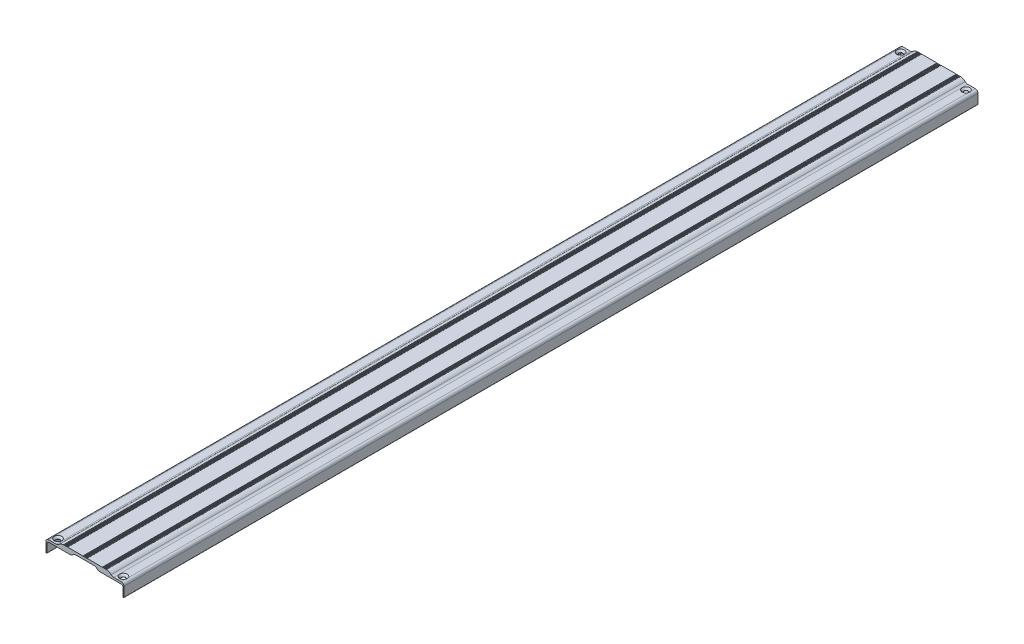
ISO-10303-21;
HEADER;
FILE_DESCRIPTION(('STEP AP214'),'2;1');
FILE_NAME('part.step','',(''),(''),'','','');
FILE_SCHEMA(('AUTOMOTIVE_DESIGN { 1 0 10303 214 1 1 1 1 }'));
ENDSEC;
DATA;
#1=APPLICATION_CONTEXT('core data for automotive mechanical design processes');
#2=APPLICATION_PROTOCOL_DEFINITION('international standard','automotive_design',2000,#1);
#3=PRODUCT_CONTEXT('',#1,'mechanical');
#4=PRODUCT('Part','Part','',(#3));
#5=PRODUCT_RELATED_PRODUCT_CATEGORY('part','',(#4));
#6=PRODUCT_DEFINITION_FORMATION('','',#4);
#7=PRODUCT_DEFINITION_CONTEXT('part definition',#1,'design');
#8=PRODUCT_DEFINITION('design','',#6,#7);
#9=PRODUCT_DEFINITION_SHAPE('','',#8);
#10=(LENGTH_UNIT() NAMED_UNIT(*) SI_UNIT(.MILLI.,.METRE.));
#11=(NAMED_UNIT(*) PLANE_ANGLE_UNIT() SI_UNIT($,.RADIAN.));
#12=(NAMED_UNIT(*) SI_UNIT($,.STERADIAN.) SOLID_ANGLE_UNIT());
#13=UNCERTAINTY_MEASURE_WITH_UNIT(LENGTH_MEASURE(1.E-05),#10,'distance_accuracy_value','');
#14=(GEOMETRIC_REPRESENTATION_CONTEXT(3) GLOBAL_UNCERTAINTY_ASSIGNED_CONTEXT((#13)) GLOBAL_UNIT_ASSIGNED_CONTEXT((#10,
#11,#12)) REPRESENTATION_CONTEXT('',''));
#15=CARTESIAN_POINT('',(0.,0.,0.));
#16=DIRECTION('',(0.,0.,1.));
#17=DIRECTION('',(1.,0.,0.));
#18=AXIS2_PLACEMENT_3D('',#15,#16,#17);
#19=CARTESIAN_POINT('',(84.8493007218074,20.0085328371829,483.));
#20=DIRECTION('',(0.,-1.,0.));
#21=DIRECTION('',(0.,0.,-1.));
#22=AXIS2_PLACEMENT_3D('',#19,#20,#21);
#23=PLANE('',#22);
#24=DIRECTION('',(0.,0.,-1.));
#25=VECTOR('',#24,1.);
#26=CARTESIAN_POINT('',(93.55982627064,20.0085328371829,483.));
#27=LINE('',#26,#25);
#28=CARTESIAN_POINT('',(93.55982627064,20.0085328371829,475.203851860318));
#29=VERTEX_POINT('',#28);
#30=CARTESIAN_POINT('',(93.55982627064,20.0085328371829,-475.203851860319));
#31=VERTEX_POINT('',#30);
#32=EDGE_CURVE('E907',#29,#31,#27,.T.);
#33=ORIENTED_EDGE('',*,*,#32,.T.);
#34=CARTESIAN_POINT('',(89.4598262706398,20.0085328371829,-476.5));
#35=DIRECTION('',(0.,1.,0.));
#36=DIRECTION('',(0.,0.,1.));
#37=AXIS2_PLACEMENT_3D('',#34,#35,#36);
#38=CIRCLE('',#37,4.3);
#39=CARTESIAN_POINT('',(93.55982627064,20.0085328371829,-477.796148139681));
#40=VERTEX_POINT('',#39);
#41=EDGE_CURVE('E58',#40,#31,#38,.T.);
#42=ORIENTED_EDGE('',*,*,#41,.F.);
#43=CARTESIAN_POINT('',(93.55982627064,20.0085328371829,-483.));
#44=VERTEX_POINT('',#43);
#45=EDGE_CURVE('E914',#40,#44,#27,.T.);
#46=ORIENTED_EDGE('',*,*,#45,.T.);
#47=DIRECTION('',(-1.,0.,0.));
#48=VECTOR('',#47,1.);
#49=CARTESIAN_POINT('',(84.8493007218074,20.0085328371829,-483.));
#50=LINE('',#49,#48);
#51=CARTESIAN_POINT('',(84.8493007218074,20.0085328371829,-483.));
#52=VERTEX_POINT('',#51);
#53=EDGE_CURVE('E1100',#44,#52,#50,.T.);
#54=ORIENTED_EDGE('',*,*,#53,.T.);
#55=DIRECTION('',(0.,0.,-1.));
#56=VECTOR('',#55,1.);
#57=CARTESIAN_POINT('',(84.8493007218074,20.0085328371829,483.));
#58=LINE('',#57,#56);
#59=CARTESIAN_POINT('',(84.8493007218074,20.0085328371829,483.));
#60=VERTEX_POINT('',#59);
#61=EDGE_CURVE('E920',#60,#52,#58,.T.);
#62=ORIENTED_EDGE('',*,*,#61,.F.);
#63=DIRECTION('',(-1.,0.,0.));
#64=VECTOR('',#63,1.);
#65=CARTESIAN_POINT('',(84.8493007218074,20.0085328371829,483.));
#66=LINE('',#65,#64);
#67=CARTESIAN_POINT('',(93.55982627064,20.0085328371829,483.));
#68=VERTEX_POINT('',#67);
#69=EDGE_CURVE('E1117',#68,#60,#66,.T.);
#70=ORIENTED_EDGE('',*,*,#69,.F.);
#71=CARTESIAN_POINT('',(93.55982627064,20.0085328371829,477.796148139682));
#72=VERTEX_POINT('',#71);
#73=EDGE_CURVE('E913',#68,#72,#27,.T.);
#74=ORIENTED_EDGE('',*,*,#73,.T.);
#75=CARTESIAN_POINT('',(89.4598262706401,20.0085328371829,476.5));
#76=DIRECTION('',(0.,1.,0.));
#77=DIRECTION('',(0.,0.,1.));
#78=AXIS2_PLACEMENT_3D('',#75,#76,#77);
#79=CIRCLE('',#78,4.3);
#80=EDGE_CURVE('E910',#29,#72,#79,.T.);
#81=ORIENTED_EDGE('',*,*,#80,.F.);
#82=EDGE_LOOP('',(#33,#42,#46,#54,#62,#70,#74,#81));
#83=FACE_BOUND('',#82,.T.);
#84=ADVANCED_FACE('F36',(#83),#23,.F.);
#85=CARTESIAN_POINT('',(76.3787635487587,15.5085328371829,483.));
#86=DIRECTION('',(0.,0.,-1.));
#87=DIRECTION('',(-1.,0.,0.));
#88=AXIS2_PLACEMENT_3D('',#85,#86,#87);
#89=CYLINDRICAL_SURFACE('',#88,7.99999999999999);
#90=CARTESIAN_POINT('',(76.3787635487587,15.5085328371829,-483.));
#91=DIRECTION('',(0.,0.,1.));
#92=DIRECTION('',(1.,0.,0.));
#93=AXIS2_PLACEMENT_3D('',#90,#91,#92);
#94=CIRCLE('',#93,7.99999999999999);
#95=CARTESIAN_POINT('',(82.0257883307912,21.1751995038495,-483.));
#96=VERTEX_POINT('',#95);
#97=CARTESIAN_POINT('',(76.7996006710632,23.4974561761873,-483.));
#98=VERTEX_POINT('',#97);
#99=EDGE_CURVE('E1127',#96,#98,#94,.T.);
#100=ORIENTED_EDGE('',*,*,#99,.T.);
#101=DIRECTION('',(0.,0.,-1.));
#102=VECTOR('',#101,1.);
#103=CARTESIAN_POINT('',(76.7996006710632,23.4974561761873,483.));
#104=LINE('',#103,#102);
#105=CARTESIAN_POINT('',(76.7996006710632,23.4974561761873,483.));
#106=VERTEX_POINT('',#105);
#107=EDGE_CURVE('E854',#106,#98,#104,.T.);
#108=ORIENTED_EDGE('',*,*,#107,.F.);
#109=CARTESIAN_POINT('',(76.3787635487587,15.5085328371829,483.));
#110=DIRECTION('',(0.,0.,1.));
#111=DIRECTION('',(1.,0.,0.));
#112=AXIS2_PLACEMENT_3D('',#109,#110,#111);
#113=CIRCLE('',#112,7.99999999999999);
#114=CARTESIAN_POINT('',(82.0257883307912,21.1751995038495,483.));
#115=VERTEX_POINT('',#114);
#116=EDGE_CURVE('E1105',#115,#106,#113,.T.);
#117=ORIENTED_EDGE('',*,*,#116,.F.);
#118=DIRECTION('',(0.,0.,-1.));
#119=VECTOR('',#118,1.);
#120=CARTESIAN_POINT('',(82.0257883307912,21.1751995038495,483.));
#121=LINE('',#120,#119);
#122=EDGE_CURVE('E1106',#115,#96,#121,.T.);
#123=ORIENTED_EDGE('',*,*,#122,.T.);
#124=EDGE_LOOP('',(#100,#108,#117,#123));
#125=FACE_BOUND('',#124,.T.);
#126=ADVANCED_FACE('F38',(#125),#89,.T.);
#127=CARTESIAN_POINT('',(76.45982627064,23.7085328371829,483.));
#128=DIRECTION('',(0.,0.,-1.));
#129=DIRECTION('',(-1.,0.,0.));
#130=AXIS2_PLACEMENT_3D('',#127,#128,#129);
#131=CYLINDRICAL_SURFACE('',#130,0.40000000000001);
#132=CARTESIAN_POINT('',(76.45982627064,23.7085328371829,-483.));
#133=DIRECTION('',(0.,0.,-1.));
#134=DIRECTION('',(1.,0.,0.));
#135=AXIS2_PLACEMENT_3D('',#132,#133,#134);
#136=CIRCLE('',#135,0.40000000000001);
#137=CARTESIAN_POINT('',(76.1445354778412,23.462378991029,-483.));
#138=VERTEX_POINT('',#137);
#139=EDGE_CURVE('E1130',#98,#138,#136,.T.);
#140=ORIENTED_EDGE('',*,*,#139,.T.);
#141=DIRECTION('',(0.,0.,-1.));
#142=VECTOR('',#141,1.);
#143=CARTESIAN_POINT('',(76.1445354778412,23.462378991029,483.));
#144=LINE('',#143,#142);
#145=CARTESIAN_POINT('',(76.1445354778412,23.462378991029,483.));
#146=VERTEX_POINT('',#145);
#147=EDGE_CURVE('E850',#146,#138,#144,.T.);
#148=ORIENTED_EDGE('',*,*,#147,.F.);
#149=CARTESIAN_POINT('',(76.45982627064,23.7085328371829,483.));
#150=DIRECTION('',(0.,0.,-1.));
#151=DIRECTION('',(1.,0.,0.));
#152=AXIS2_PLACEMENT_3D('',#149,#150,#151);
#153=CIRCLE('',#152,0.40000000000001);
#154=EDGE_CURVE('E1658',#106,#146,#153,.T.);
#155=ORIENTED_EDGE('',*,*,#154,.F.);
#156=ORIENTED_EDGE('',*,*,#107,.T.);
#157=EDGE_LOOP('',(#140,#148,#155,#156));
#158=FACE_BOUND('',#157,.T.);
#159=ADVANCED_FACE('F902',(#158),#131,.F.);
#160=CARTESIAN_POINT('',(76.0499482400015,23.3885328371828,483.));
#161=DIRECTION('',(0.,0.,-1.));
#162=DIRECTION('',(-1.,0.,0.));
#163=AXIS2_PLACEMENT_3D('',#160,#161,#162);
#164=CYLINDRICAL_SURFACE('',#163,0.120000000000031);
#165=CARTESIAN_POINT('',(76.0499482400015,23.3885328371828,-483.));
#166=DIRECTION('',(0.,0.,1.));
#167=DIRECTION('',(1.,0.,0.));
#168=AXIS2_PLACEMENT_3D('',#165,#166,#167);
#169=CIRCLE('',#168,0.120000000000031);
#170=CARTESIAN_POINT('',(76.0499482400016,23.5085328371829,-483.));
#171=VERTEX_POINT('',#170);
#172=EDGE_CURVE('E1133',#138,#171,#169,.T.);
#173=ORIENTED_EDGE('',*,*,#172,.T.);
#174=DIRECTION('',(0.,0.,-1.));
#175=VECTOR('',#174,1.);
#176=CARTESIAN_POINT('',(76.0499482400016,23.5085328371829,483.));
#177=LINE('',#176,#175);
#178=CARTESIAN_POINT('',(76.0499482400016,23.5085328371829,483.));
#179=VERTEX_POINT('',#178);
#180=EDGE_CURVE('E846',#179,#171,#177,.T.);
#181=ORIENTED_EDGE('',*,*,#180,.F.);
#182=CARTESIAN_POINT('',(76.0499482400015,23.3885328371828,483.));
#183=DIRECTION('',(0.,0.,1.));
#184=DIRECTION('',(1.,0.,0.));
#185=AXIS2_PLACEMENT_3D('',#182,#183,#184);
#186=CIRCLE('',#185,0.120000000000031);
#187=EDGE_CURVE('E1656',#146,#179,#186,.T.);
#188=ORIENTED_EDGE('',*,*,#187,.F.);
#189=ORIENTED_EDGE('',*,*,#147,.T.);
#190=EDGE_LOOP('',(#173,#181,#188,#189));
#191=FACE_BOUND('',#190,.T.);
#192=ADVANCED_FACE('F1653',(#191),#164,.T.);
#193=CARTESIAN_POINT('',(76.0499482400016,23.5085328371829,483.));
#194=DIRECTION('',(0.,-1.,0.));
#195=DIRECTION('',(0.,0.,-1.));
#196=AXIS2_PLACEMENT_3D('',#193,#194,#195);
#197=PLANE('',#196);
#198=DIRECTION('',(-1.,0.,0.));
#199=VECTOR('',#198,1.);
#200=CARTESIAN_POINT('',(76.0499482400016,23.5085328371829,-483.));
#201=LINE('',#200,#199);
#202=CARTESIAN_POINT('',(75.8697043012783,23.5085328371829,-483.));
#203=VERTEX_POINT('',#202);
#204=EDGE_CURVE('E1136',#171,#203,#201,.T.);
#205=ORIENTED_EDGE('',*,*,#204,.T.);
#206=DIRECTION('',(0.,0.,-1.));
#207=VECTOR('',#206,1.);
#208=CARTESIAN_POINT('',(75.8697043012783,23.5085328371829,483.));
#209=LINE('',#208,#207);
#210=CARTESIAN_POINT('',(75.8697043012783,23.5085328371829,483.));
#211=VERTEX_POINT('',#210);
#212=EDGE_CURVE('E842',#211,#203,#209,.T.);
#213=ORIENTED_EDGE('',*,*,#212,.F.);
#214=DIRECTION('',(-1.,0.,0.));
#215=VECTOR('',#214,1.);
#216=CARTESIAN_POINT('',(76.0499482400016,23.5085328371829,483.));
#217=LINE('',#216,#215);
#218=EDGE_CURVE('E1649',#179,#211,#217,.T.);
#219=ORIENTED_EDGE('',*,*,#218,.F.);
#220=ORIENTED_EDGE('',*,*,#180,.T.);
#221=EDGE_LOOP('',(#205,#213,#219,#220));
#222=FACE_BOUND('',#221,.T.);
#223=ADVANCED_FACE('F1648',(#222),#197,.F.);
#224=CARTESIAN_POINT('',(75.8697043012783,23.3885328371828,483.));
#225=DIRECTION('',(0.,0.,-1.));
#226=DIRECTION('',(-1.,0.,0.));
#227=AXIS2_PLACEMENT_3D('',#224,#225,#226);
#228=CYLINDRICAL_SURFACE('',#227,0.120000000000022);
#229=CARTESIAN_POINT('',(75.8697043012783,23.3885328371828,-483.));
#230=DIRECTION('',(0.,0.,1.));
#231=DIRECTION('',(1.,0.,0.));
#232=AXIS2_PLACEMENT_3D('',#229,#230,#231);
#233=CIRCLE('',#232,0.120000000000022);
#234=CARTESIAN_POINT('',(75.7751170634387,23.462378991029,-483.));
#235=VERTEX_POINT('',#234);
#236=EDGE_CURVE('E1139',#203,#235,#233,.T.);
#237=ORIENTED_EDGE('',*,*,#236,.T.);
#238=DIRECTION('',(0.,0.,-1.));
#239=VECTOR('',#238,1.);
#240=CARTESIAN_POINT('',(75.7751170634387,23.462378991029,483.));
#241=LINE('',#240,#239);
#242=CARTESIAN_POINT('',(75.7751170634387,23.462378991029,483.));
#243=VERTEX_POINT('',#242);
#244=EDGE_CURVE('E838',#243,#235,#241,.T.);
#245=ORIENTED_EDGE('',*,*,#244,.F.);
#246=CARTESIAN_POINT('',(75.8697043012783,23.3885328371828,483.));
#247=DIRECTION('',(0.,0.,1.));
#248=DIRECTION('',(1.,0.,0.));
#249=AXIS2_PLACEMENT_3D('',#246,#247,#248);
#250=CIRCLE('',#249,0.120000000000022);
#251=EDGE_CURVE('E1644',#211,#243,#250,.T.);
#252=ORIENTED_EDGE('',*,*,#251,.F.);
#253=ORIENTED_EDGE('',*,*,#212,.T.);
#254=EDGE_LOOP('',(#237,#245,#252,#253));
#255=FACE_BOUND('',#254,.T.);
#256=ADVANCED_FACE('F1643',(#255),#228,.T.);
#257=CARTESIAN_POINT('',(75.45982627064,23.7085328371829,483.));
#258=DIRECTION('',(0.,0.,-1.));
#259=DIRECTION('',(-1.,0.,0.));
#260=AXIS2_PLACEMENT_3D('',#257,#258,#259);
#261=CYLINDRICAL_SURFACE('',#260,0.399999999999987);
#262=CARTESIAN_POINT('',(75.45982627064,23.7085328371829,-483.));
#263=DIRECTION('',(0.,0.,-1.));
#264=DIRECTION('',(1.,0.,0.));
#265=AXIS2_PLACEMENT_3D('',#262,#263,#264);
#266=CIRCLE('',#265,0.399999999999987);
#267=CARTESIAN_POINT('',(75.1445354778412,23.462378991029,-483.));
#268=VERTEX_POINT('',#267);
#269=EDGE_CURVE('E1142',#235,#268,#266,.T.);
#270=ORIENTED_EDGE('',*,*,#269,.T.);
#271=DIRECTION('',(0.,0.,-1.));
#272=VECTOR('',#271,1.);
#273=CARTESIAN_POINT('',(75.1445354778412,23.462378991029,483.));
#274=LINE('',#273,#272);
#275=CARTESIAN_POINT('',(75.1445354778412,23.462378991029,483.));
#276=VERTEX_POINT('',#275);
#277=EDGE_CURVE('E834',#276,#268,#274,.T.);
#278=ORIENTED_EDGE('',*,*,#277,.F.);
#279=CARTESIAN_POINT('',(75.45982627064,23.7085328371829,483.));
#280=DIRECTION('',(0.,0.,-1.));
#281=DIRECTION('',(1.,0.,0.));
#282=AXIS2_PLACEMENT_3D('',#279,#280,#281);
#283=CIRCLE('',#282,0.399999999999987);
#284=EDGE_CURVE('E1640',#243,#276,#283,.T.);
#285=ORIENTED_EDGE('',*,*,#284,.F.);
#286=ORIENTED_EDGE('',*,*,#244,.T.);
#287=EDGE_LOOP('',(#270,#278,#285,#286));
#288=FACE_BOUND('',#287,.T.);
#289=ADVANCED_FACE('F1637',(#288),#261,.F.);
#290=CARTESIAN_POINT('',(75.0499482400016,23.3885328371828,483.));
#291=DIRECTION('',(0.,0.,-1.));
#292=DIRECTION('',(-1.,0.,0.));
#293=AXIS2_PLACEMENT_3D('',#290,#291,#292);
#294=CYLINDRICAL_SURFACE('',#293,0.120000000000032);
#295=CARTESIAN_POINT('',(75.0499482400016,23.3885328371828,-483.));
#296=DIRECTION('',(0.,0.,1.));
#297=DIRECTION('',(1.,0.,0.));
#298=AXIS2_PLACEMENT_3D('',#295,#296,#297);
#299=CIRCLE('',#298,0.120000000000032);
#300=CARTESIAN_POINT('',(75.0499482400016,23.5085328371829,-483.));
#301=VERTEX_POINT('',#300);
#302=EDGE_CURVE('E1145',#268,#301,#299,.T.);
#303=ORIENTED_EDGE('',*,*,#302,.T.);
#304=DIRECTION('',(0.,0.,-1.));
#305=VECTOR('',#304,1.);
#306=CARTESIAN_POINT('',(75.0499482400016,23.5085328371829,483.));
#307=LINE('',#306,#305);
#308=CARTESIAN_POINT('',(75.0499482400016,23.5085328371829,483.));
#309=VERTEX_POINT('',#308);
#310=EDGE_CURVE('E830',#309,#301,#307,.T.);
#311=ORIENTED_EDGE('',*,*,#310,.F.);
#312=CARTESIAN_POINT('',(75.0499482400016,23.3885328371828,483.));
#313=DIRECTION('',(0.,0.,1.));
#314=DIRECTION('',(1.,0.,0.));
#315=AXIS2_PLACEMENT_3D('',#312,#313,#314);
#316=CIRCLE('',#315,0.120000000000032);
#317=EDGE_CURVE('E1631',#276,#309,#316,.T.);
#318=ORIENTED_EDGE('',*,*,#317,.F.);
#319=ORIENTED_EDGE('',*,*,#277,.T.);
#320=EDGE_LOOP('',(#303,#311,#318,#319));
#321=FACE_BOUND('',#320,.T.);
#322=ADVANCED_FACE('F1630',(#321),#294,.T.);
#323=CARTESIAN_POINT('',(75.0499482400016,23.5085328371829,483.));
#324=DIRECTION('',(0.,-1.,0.));
#325=DIRECTION('',(0.,0.,-1.));
#326=AXIS2_PLACEMENT_3D('',#323,#324,#325);
#327=PLANE('',#326);
#328=DIRECTION('',(-1.,0.,0.));
#329=VECTOR('',#328,1.);
#330=CARTESIAN_POINT('',(75.0499482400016,23.5085328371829,-483.));
#331=LINE('',#330,#329);
#332=CARTESIAN_POINT('',(74.8697043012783,23.5085328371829,-483.));
#333=VERTEX_POINT('',#332);
#334=EDGE_CURVE('E1148',#301,#333,#331,.T.);
#335=ORIENTED_EDGE('',*,*,#334,.T.);
#336=DIRECTION('',(0.,0.,-1.));
#337=VECTOR('',#336,1.);
#338=CARTESIAN_POINT('',(74.8697043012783,23.5085328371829,483.));
#339=LINE('',#338,#337);
#340=CARTESIAN_POINT('',(74.8697043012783,23.5085328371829,483.));
#341=VERTEX_POINT('',#340);
#342=EDGE_CURVE('E826',#341,#333,#339,.T.);
#343=ORIENTED_EDGE('',*,*,#342,.F.);
#344=DIRECTION('',(-1.,0.,0.));
#345=VECTOR('',#344,1.);
#346=CARTESIAN_POINT('',(75.0499482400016,23.5085328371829,483.));
#347=LINE('',#346,#345);
#348=EDGE_CURVE('E1626',#309,#341,#347,.T.);
#349=ORIENTED_EDGE('',*,*,#348,.F.);
#350=ORIENTED_EDGE('',*,*,#310,.T.);
#351=EDGE_LOOP('',(#335,#343,#349,#350));
#352=FACE_BOUND('',#351,.T.);
#353=ADVANCED_FACE('F1625',(#352),#327,.F.);
#354=CARTESIAN_POINT('',(74.8697043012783,23.3885328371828,483.));
#355=DIRECTION('',(0.,0.,-1.));
#356=DIRECTION('',(-1.,0.,0.));
#357=AXIS2_PLACEMENT_3D('',#354,#355,#356);
#358=CYLINDRICAL_SURFACE('',#357,0.120000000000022);
#359=CARTESIAN_POINT('',(74.8697043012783,23.3885328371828,-483.));
#360=DIRECTION('',(0.,0.,1.));
#361=DIRECTION('',(1.,0.,0.));
#362=AXIS2_PLACEMENT_3D('',#359,#360,#361);
#363=CIRCLE('',#362,0.120000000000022);
#364=CARTESIAN_POINT('',(74.7751170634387,23.462378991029,-483.));
#365=VERTEX_POINT('',#364);
#366=EDGE_CURVE('E1151',#333,#365,#363,.T.);
#367=ORIENTED_EDGE('',*,*,#366,.T.);
#368=DIRECTION('',(0.,0.,-1.));
#369=VECTOR('',#368,1.);
#370=CARTESIAN_POINT('',(74.7751170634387,23.462378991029,483.));
#371=LINE('',#370,#369);
#372=CARTESIAN_POINT('',(74.7751170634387,23.462378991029,483.));
#373=VERTEX_POINT('',#372);
#374=EDGE_CURVE('E822',#373,#365,#371,.T.);
#375=ORIENTED_EDGE('',*,*,#374,.F.);
#376=CARTESIAN_POINT('',(74.8697043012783,23.3885328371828,483.));
#377=DIRECTION('',(0.,0.,1.));
#378=DIRECTION('',(1.,0.,0.));
#379=AXIS2_PLACEMENT_3D('',#376,#377,#378);
#380=CIRCLE('',#379,0.120000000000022);
#381=EDGE_CURVE('E1622',#341,#373,#380,.T.);
#382=ORIENTED_EDGE('',*,*,#381,.F.);
#383=ORIENTED_EDGE('',*,*,#342,.T.);
#384=EDGE_LOOP('',(#367,#375,#382,#383));
#385=FACE_BOUND('',#384,.T.);
#386=ADVANCED_FACE('F1619',(#385),#358,.T.);
#387=CARTESIAN_POINT('',(74.45982627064,23.7085328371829,483.));
#388=DIRECTION('',(0.,0.,-1.));
#389=DIRECTION('',(-1.,0.,0.));
#390=AXIS2_PLACEMENT_3D('',#387,#388,#389);
#391=CYLINDRICAL_SURFACE('',#390,0.399999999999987);
#392=CARTESIAN_POINT('',(74.45982627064,23.7085328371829,-483.));
#393=DIRECTION('',(0.,0.,-1.));
#394=DIRECTION('',(1.,0.,0.));
#395=AXIS2_PLACEMENT_3D('',#392,#393,#394);
#396=CIRCLE('',#395,0.399999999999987);
#397=CARTESIAN_POINT('',(74.1445354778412,23.462378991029,-483.));
#398=VERTEX_POINT('',#397);
#399=EDGE_CURVE('E1154',#365,#398,#396,.T.);
#400=ORIENTED_EDGE('',*,*,#399,.T.);
#401=DIRECTION('',(0.,0.,-1.));
#402=VECTOR('',#401,1.);
#403=CARTESIAN_POINT('',(74.1445354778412,23.462378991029,483.));
#404=LINE('',#403,#402);
#405=CARTESIAN_POINT('',(74.1445354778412,23.462378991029,483.));
#406=VERTEX_POINT('',#405);
#407=EDGE_CURVE('E818',#406,#398,#404,.T.);
#408=ORIENTED_EDGE('',*,*,#407,.F.);
#409=CARTESIAN_POINT('',(74.45982627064,23.7085328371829,483.));
#410=DIRECTION('',(0.,0.,-1.));
#411=DIRECTION('',(1.,0.,0.));
#412=AXIS2_PLACEMENT_3D('',#409,#410,#411);
#413=CIRCLE('',#412,0.399999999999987);
#414=EDGE_CURVE('E1613',#373,#406,#413,.T.);
#415=ORIENTED_EDGE('',*,*,#414,.F.);
#416=ORIENTED_EDGE('',*,*,#374,.T.);
#417=EDGE_LOOP('',(#400,#408,#415,#416));
#418=FACE_BOUND('',#417,.T.);
#419=ADVANCED_FACE('F1612',(#418),#391,.F.);
#420=CARTESIAN_POINT('',(74.0499482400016,23.3885328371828,483.));
#421=DIRECTION('',(0.,0.,-1.));
#422=DIRECTION('',(-1.,0.,0.));
#423=AXIS2_PLACEMENT_3D('',#420,#421,#422);
#424=CYLINDRICAL_SURFACE('',#423,0.120000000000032);
#425=CARTESIAN_POINT('',(74.0499482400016,23.3885328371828,-483.));
#426=DIRECTION('',(0.,0.,1.));
#427=DIRECTION('',(1.,0.,0.));
#428=AXIS2_PLACEMENT_3D('',#425,#426,#427);
#429=CIRCLE('',#428,0.120000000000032);
#430=CARTESIAN_POINT('',(74.0499482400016,23.5085328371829,-483.));
#431=VERTEX_POINT('',#430);
#432=EDGE_CURVE('E1157',#398,#431,#429,.T.);
#433=ORIENTED_EDGE('',*,*,#432,.T.);
#434=DIRECTION('',(0.,0.,-1.));
#435=VECTOR('',#434,1.);
#436=CARTESIAN_POINT('',(74.0499482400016,23.5085328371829,483.));
#437=LINE('',#436,#435);
#438=CARTESIAN_POINT('',(74.0499482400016,23.5085328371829,483.));
#439=VERTEX_POINT('',#438);
#440=EDGE_CURVE('E814',#439,#431,#437,.T.);
#441=ORIENTED_EDGE('',*,*,#440,.F.);
#442=CARTESIAN_POINT('',(74.0499482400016,23.3885328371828,483.));
#443=DIRECTION('',(0.,0.,1.));
#444=DIRECTION('',(1.,0.,0.));
#445=AXIS2_PLACEMENT_3D('',#442,#443,#444);
#446=CIRCLE('',#445,0.120000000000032);
#447=EDGE_CURVE('E1608',#406,#439,#446,.T.);
#448=ORIENTED_EDGE('',*,*,#447,.F.);
#449=ORIENTED_EDGE('',*,*,#407,.T.);
#450=EDGE_LOOP('',(#433,#441,#448,#449));
#451=FACE_BOUND('',#450,.T.);
#452=ADVANCED_FACE('F1607',(#451),#424,.T.);
#453=CARTESIAN_POINT('',(74.0499482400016,23.5085328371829,483.));
#454=DIRECTION('',(0.,-1.,0.));
#455=DIRECTION('',(0.,0.,-1.));
#456=AXIS2_PLACEMENT_3D('',#453,#454,#455);
#457=PLANE('',#456);
#458=DIRECTION('',(-1.,0.,0.));
#459=VECTOR('',#458,1.);
#460=CARTESIAN_POINT('',(74.0499482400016,23.5085328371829,-483.));
#461=LINE('',#460,#459);
#462=CARTESIAN_POINT('',(73.8697043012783,23.5085328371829,-483.));
#463=VERTEX_POINT('',#462);
#464=EDGE_CURVE('E1160',#431,#463,#461,.T.);
#465=ORIENTED_EDGE('',*,*,#464,.T.);
#466=DIRECTION('',(0.,0.,-1.));
#467=VECTOR('',#466,1.);
#468=CARTESIAN_POINT('',(73.8697043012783,23.5085328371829,483.));
#469=LINE('',#468,#467);
#470=CARTESIAN_POINT('',(73.8697043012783,23.5085328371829,483.));
#471=VERTEX_POINT('',#470);
#472=EDGE_CURVE('E810',#471,#463,#469,.T.);
#473=ORIENTED_EDGE('',*,*,#472,.F.);
#474=DIRECTION('',(-1.,0.,0.));
#475=VECTOR('',#474,1.);
#476=CARTESIAN_POINT('',(74.0499482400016,23.5085328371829,483.));
#477=LINE('',#476,#475);
#478=EDGE_CURVE('E1604',#439,#471,#477,.T.);
#479=ORIENTED_EDGE('',*,*,#478,.F.);
#480=ORIENTED_EDGE('',*,*,#440,.T.);
#481=EDGE_LOOP('',(#465,#473,#479,#480));
#482=FACE_BOUND('',#481,.T.);
#483=ADVANCED_FACE('F1601',(#482),#457,.F.);
#484=CARTESIAN_POINT('',(73.8697043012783,23.3885328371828,483.));
#485=DIRECTION('',(0.,0.,-1.));
#486=DIRECTION('',(-1.,0.,0.));
#487=AXIS2_PLACEMENT_3D('',#484,#485,#486);
#488=CYLINDRICAL_SURFACE('',#487,0.120000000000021);
#489=CARTESIAN_POINT('',(73.8697043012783,23.3885328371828,-483.));
#490=DIRECTION('',(0.,0.,1.));
#491=DIRECTION('',(1.,0.,0.));
#492=AXIS2_PLACEMENT_3D('',#489,#490,#491);
#493=CIRCLE('',#492,0.120000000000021);
#494=CARTESIAN_POINT('',(73.7751170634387,23.462378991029,-483.));
#495=VERTEX_POINT('',#494);
#496=EDGE_CURVE('E1163',#463,#495,#493,.T.);
#497=ORIENTED_EDGE('',*,*,#496,.T.);
#498=DIRECTION('',(0.,0.,-1.));
#499=VECTOR('',#498,1.);
#500=CARTESIAN_POINT('',(73.7751170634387,23.462378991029,483.));
#501=LINE('',#500,#499);
#502=CARTESIAN_POINT('',(73.7751170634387,23.462378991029,483.));
#503=VERTEX_POINT('',#502);
#504=EDGE_CURVE('E806',#503,#495,#501,.T.);
#505=ORIENTED_EDGE('',*,*,#504,.F.);
#506=CARTESIAN_POINT('',(73.8697043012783,23.3885328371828,483.));
#507=DIRECTION('',(0.,0.,1.));
#508=DIRECTION('',(1.,0.,0.));
#509=AXIS2_PLACEMENT_3D('',#506,#507,#508);
#510=CIRCLE('',#509,0.120000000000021);
#511=EDGE_CURVE('E1595',#471,#503,#510,.T.);
#512=ORIENTED_EDGE('',*,*,#511,.F.);
#513=ORIENTED_EDGE('',*,*,#472,.T.);
#514=EDGE_LOOP('',(#497,#505,#512,#513));
#515=FACE_BOUND('',#514,.T.);
#516=ADVANCED_FACE('F1594',(#515),#488,.T.);
#517=CARTESIAN_POINT('',(73.45982627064,23.7085328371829,483.));
#518=DIRECTION('',(0.,0.,-1.));
#519=DIRECTION('',(-1.,0.,0.));
#520=AXIS2_PLACEMENT_3D('',#517,#518,#519);
#521=CYLINDRICAL_SURFACE('',#520,0.40000000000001);
#522=CARTESIAN_POINT('',(73.45982627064,23.7085328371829,-483.));
#523=DIRECTION('',(0.,0.,-1.));
#524=DIRECTION('',(1.,0.,0.));
#525=AXIS2_PLACEMENT_3D('',#522,#523,#524);
#526=CIRCLE('',#525,0.40000000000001);
#527=CARTESIAN_POINT('',(73.1445354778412,23.462378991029,-483.));
#528=VERTEX_POINT('',#527);
#529=EDGE_CURVE('E1166',#495,#528,#526,.T.);
#530=ORIENTED_EDGE('',*,*,#529,.T.);
#531=DIRECTION('',(0.,0.,-1.));
#532=VECTOR('',#531,1.);
#533=CARTESIAN_POINT('',(73.1445354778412,23.462378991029,483.));
#534=LINE('',#533,#532);
#535=CARTESIAN_POINT('',(73.1445354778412,23.462378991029,483.));
#536=VERTEX_POINT('',#535);
#537=EDGE_CURVE('E802',#536,#528,#534,.T.);
#538=ORIENTED_EDGE('',*,*,#537,.F.);
#539=CARTESIAN_POINT('',(73.45982627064,23.7085328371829,483.));
#540=DIRECTION('',(0.,0.,-1.));
#541=DIRECTION('',(1.,0.,0.));
#542=AXIS2_PLACEMENT_3D('',#539,#540,#541);
#543=CIRCLE('',#542,0.40000000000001);
#544=EDGE_CURVE('E1590',#503,#536,#543,.T.);
#545=ORIENTED_EDGE('',*,*,#544,.F.);
#546=ORIENTED_EDGE('',*,*,#504,.T.);
#547=EDGE_LOOP('',(#530,#538,#545,#546));
#548=FACE_BOUND('',#547,.T.);
#549=ADVANCED_FACE('F1589',(#548),#521,.F.);
#550=CARTESIAN_POINT('',(73.0499482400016,23.3885328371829,483.));
#551=DIRECTION('',(0.,0.,-1.));
#552=DIRECTION('',(-1.,0.,0.));
#553=AXIS2_PLACEMENT_3D('',#550,#551,#552);
#554=CYLINDRICAL_SURFACE('',#553,0.120000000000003);
#555=CARTESIAN_POINT('',(73.0499482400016,23.3885328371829,-483.));
#556=DIRECTION('',(0.,0.,1.));
#557=DIRECTION('',(1.,0.,0.));
#558=AXIS2_PLACEMENT_3D('',#555,#556,#557);
#559=CIRCLE('',#558,0.120000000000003);
#560=CARTESIAN_POINT('',(73.0499482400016,23.5085328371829,-483.));
#561=VERTEX_POINT('',#560);
#562=EDGE_CURVE('E1169',#528,#561,#559,.T.);
#563=ORIENTED_EDGE('',*,*,#562,.T.);
#564=DIRECTION('',(0.,0.,-1.));
#565=VECTOR('',#564,1.);
#566=CARTESIAN_POINT('',(73.0499482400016,23.5085328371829,483.));
#567=LINE('',#566,#565);
#568=CARTESIAN_POINT('',(73.0499482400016,23.5085328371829,483.));
#569=VERTEX_POINT('',#568);
#570=EDGE_CURVE('E798',#569,#561,#567,.T.);
#571=ORIENTED_EDGE('',*,*,#570,.F.);
#572=CARTESIAN_POINT('',(73.0499482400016,23.3885328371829,483.));
#573=DIRECTION('',(0.,0.,1.));
#574=DIRECTION('',(1.,0.,0.));
#575=AXIS2_PLACEMENT_3D('',#572,#573,#574);
#576=CIRCLE('',#575,0.120000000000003);
#577=EDGE_CURVE('E1586',#536,#569,#576,.T.);
#578=ORIENTED_EDGE('',*,*,#577,.F.);
#579=ORIENTED_EDGE('',*,*,#537,.T.);
#580=EDGE_LOOP('',(#563,#571,#578,#579));
#581=FACE_BOUND('',#580,.T.);
#582=ADVANCED_FACE('F1583',(#581),#554,.T.);
#583=CARTESIAN_POINT('',(73.0499482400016,23.5085328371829,483.));
#584=DIRECTION('',(0.,-1.,0.));
#585=DIRECTION('',(0.,0.,-1.));
#586=AXIS2_PLACEMENT_3D('',#583,#584,#585);
#587=PLANE('',#586);
#588=DIRECTION('',(-1.,0.,0.));
#589=VECTOR('',#588,1.);
#590=CARTESIAN_POINT('',(73.0499482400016,23.5085328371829,-483.));
#591=LINE('',#590,#589);
#592=CARTESIAN_POINT('',(72.8697043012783,23.5085328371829,-483.));
#593=VERTEX_POINT('',#592);
#594=EDGE_CURVE('E1172',#561,#593,#591,.T.);
#595=ORIENTED_EDGE('',*,*,#594,.T.);
#596=DIRECTION('',(0.,0.,-1.));
#597=VECTOR('',#596,1.);
#598=CARTESIAN_POINT('',(72.8697043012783,23.5085328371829,483.));
#599=LINE('',#598,#597);
#600=CARTESIAN_POINT('',(72.8697043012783,23.5085328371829,483.));
#601=VERTEX_POINT('',#600);
#602=EDGE_CURVE('E794',#601,#593,#599,.T.);
#603=ORIENTED_EDGE('',*,*,#602,.F.);
#604=DIRECTION('',(-1.,0.,0.));
#605=VECTOR('',#604,1.);
#606=CARTESIAN_POINT('',(73.0499482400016,23.5085328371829,483.));
#607=LINE('',#606,#605);
#608=EDGE_CURVE('E1577',#569,#601,#607,.T.);
#609=ORIENTED_EDGE('',*,*,#608,.F.);
#610=ORIENTED_EDGE('',*,*,#570,.T.);
#611=EDGE_LOOP('',(#595,#603,#609,#610));
#612=FACE_BOUND('',#611,.T.);
#613=ADVANCED_FACE('F1576',(#612),#587,.F.);
#614=CARTESIAN_POINT('',(72.8697043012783,23.3885328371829,483.));
#615=DIRECTION('',(0.,0.,-1.));
#616=DIRECTION('',(-1.,0.,0.));
#617=AXIS2_PLACEMENT_3D('',#614,#615,#616);
#618=CYLINDRICAL_SURFACE('',#617,0.120000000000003);
#619=CARTESIAN_POINT('',(72.8697043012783,23.3885328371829,-483.));
#620=DIRECTION('',(0.,0.,1.));
#621=DIRECTION('',(1.,0.,0.));
#622=AXIS2_PLACEMENT_3D('',#619,#620,#621);
#623=CIRCLE('',#622,0.120000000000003);
#624=CARTESIAN_POINT('',(72.7751170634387,23.462378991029,-483.));
#625=VERTEX_POINT('',#624);
#626=EDGE_CURVE('E1175',#593,#625,#623,.T.);
#627=ORIENTED_EDGE('',*,*,#626,.T.);
#628=DIRECTION('',(0.,0.,-1.));
#629=VECTOR('',#628,1.);
#630=CARTESIAN_POINT('',(72.7751170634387,23.462378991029,483.));
#631=LINE('',#630,#629);
#632=CARTESIAN_POINT('',(72.7751170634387,23.462378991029,483.));
#633=VERTEX_POINT('',#632);
#634=EDGE_CURVE('E790',#633,#625,#631,.T.);
#635=ORIENTED_EDGE('',*,*,#634,.F.);
#636=CARTESIAN_POINT('',(72.8697043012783,23.3885328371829,483.));
#637=DIRECTION('',(0.,0.,1.));
#638=DIRECTION('',(1.,0.,0.));
#639=AXIS2_PLACEMENT_3D('',#636,#637,#638);
#640=CIRCLE('',#639,0.120000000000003);
#641=EDGE_CURVE('E1572',#601,#633,#640,.T.);
#642=ORIENTED_EDGE('',*,*,#641,.F.);
#643=ORIENTED_EDGE('',*,*,#602,.T.);
#644=EDGE_LOOP('',(#627,#635,#642,#643));
#645=FACE_BOUND('',#644,.T.);
#646=ADVANCED_FACE('F1571',(#645),#618,.T.);
#647=CARTESIAN_POINT('',(72.45982627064,23.7085328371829,483.));
#648=DIRECTION('',(0.,0.,-1.));
#649=DIRECTION('',(-1.,0.,0.));
#650=AXIS2_PLACEMENT_3D('',#647,#648,#649);
#651=CYLINDRICAL_SURFACE('',#650,0.40000000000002);
#652=CARTESIAN_POINT('',(72.45982627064,23.7085328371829,-483.));
#653=DIRECTION('',(0.,0.,-1.));
#654=DIRECTION('',(1.,0.,0.));
#655=AXIS2_PLACEMENT_3D('',#652,#653,#654);
#656=CIRCLE('',#655,0.40000000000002);
#657=CARTESIAN_POINT('',(72.1445354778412,23.462378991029,-483.));
#658=VERTEX_POINT('',#657);
#659=EDGE_CURVE('E1178',#625,#658,#656,.T.);
#660=ORIENTED_EDGE('',*,*,#659,.T.);
#661=DIRECTION('',(0.,0.,-1.));
#662=VECTOR('',#661,1.);
#663=CARTESIAN_POINT('',(72.1445354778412,23.462378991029,483.));
#664=LINE('',#663,#662);
#665=CARTESIAN_POINT('',(72.1445354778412,23.462378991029,483.));
#666=VERTEX_POINT('',#665);
#667=EDGE_CURVE('E786',#666,#658,#664,.T.);
#668=ORIENTED_EDGE('',*,*,#667,.F.);
#669=CARTESIAN_POINT('',(72.45982627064,23.7085328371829,483.));
#670=DIRECTION('',(0.,0.,-1.));
#671=DIRECTION('',(1.,0.,0.));
#672=AXIS2_PLACEMENT_3D('',#669,#670,#671);
#673=CIRCLE('',#672,0.40000000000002);
#674=EDGE_CURVE('E1568',#633,#666,#673,.T.);
#675=ORIENTED_EDGE('',*,*,#674,.F.);
#676=ORIENTED_EDGE('',*,*,#634,.T.);
#677=EDGE_LOOP('',(#660,#668,#675,#676));
#678=FACE_BOUND('',#677,.T.);
#679=ADVANCED_FACE('F1565',(#678),#651,.F.);
#680=CARTESIAN_POINT('',(72.0499482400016,23.3885328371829,483.));
#681=DIRECTION('',(0.,0.,-1.));
#682=DIRECTION('',(-1.,0.,0.));
#683=AXIS2_PLACEMENT_3D('',#680,#681,#682);
#684=CYLINDRICAL_SURFACE('',#683,0.120000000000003);
#685=CARTESIAN_POINT('',(72.0499482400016,23.3885328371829,-483.));
#686=DIRECTION('',(0.,0.,1.));
#687=DIRECTION('',(1.,0.,0.));
#688=AXIS2_PLACEMENT_3D('',#685,#686,#687);
#689=CIRCLE('',#688,0.120000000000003);
#690=CARTESIAN_POINT('',(72.0499482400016,23.5085328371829,-483.));
#691=VERTEX_POINT('',#690);
#692=EDGE_CURVE('E1181',#658,#691,#689,.T.);
#693=ORIENTED_EDGE('',*,*,#692,.T.);
#694=DIRECTION('',(0.,0.,-1.));
#695=VECTOR('',#694,1.);
#696=CARTESIAN_POINT('',(72.0499482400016,23.5085328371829,483.));
#697=LINE('',#696,#695);
#698=CARTESIAN_POINT('',(72.0499482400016,23.5085328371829,483.));
#699=VERTEX_POINT('',#698);
#700=EDGE_CURVE('E782',#699,#691,#697,.T.);
#701=ORIENTED_EDGE('',*,*,#700,.F.);
#702=CARTESIAN_POINT('',(72.0499482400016,23.3885328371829,483.));
#703=DIRECTION('',(0.,0.,1.));
#704=DIRECTION('',(1.,0.,0.));
#705=AXIS2_PLACEMENT_3D('',#702,#703,#704);
#706=CIRCLE('',#705,0.120000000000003);
#707=EDGE_CURVE('E1559',#666,#699,#706,.T.);
#708=ORIENTED_EDGE('',*,*,#707,.F.);
#709=ORIENTED_EDGE('',*,*,#667,.T.);
#710=EDGE_LOOP('',(#693,#701,#708,#709));
#711=FACE_BOUND('',#710,.T.);
#712=ADVANCED_FACE('F1558',(#711),#684,.T.);
#713=CARTESIAN_POINT('',(54.8697043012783,23.5085328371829,483.));
#714=DIRECTION('',(0.,-1.,0.));
#715=DIRECTION('',(0.,0.,-1.));
#716=AXIS2_PLACEMENT_3D('',#713,#714,#715);
#717=PLANE('',#716);
#718=DIRECTION('',(-1.,0.,0.));
#719=VECTOR('',#718,1.);
#720=CARTESIAN_POINT('',(54.8697043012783,23.5085328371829,-483.));
#721=LINE('',#720,#719);
#722=CARTESIAN_POINT('',(54.8697043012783,23.5085328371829,-483.));
#723=VERTEX_POINT('',#722);
#724=EDGE_CURVE('E1184',#691,#723,#721,.T.);
#725=ORIENTED_EDGE('',*,*,#724,.T.);
#726=DIRECTION('',(0.,0.,-1.));
#727=VECTOR('',#726,1.);
#728=CARTESIAN_POINT('',(54.8697043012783,23.5085328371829,483.));
#729=LINE('',#728,#727);
#730=CARTESIAN_POINT('',(54.8697043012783,23.5085328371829,483.));
#731=VERTEX_POINT('',#730);
#732=EDGE_CURVE('E778',#731,#723,#729,.T.);
#733=ORIENTED_EDGE('',*,*,#732,.F.);
#734=DIRECTION('',(-1.,0.,0.));
#735=VECTOR('',#734,1.);
#736=CARTESIAN_POINT('',(54.8697043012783,23.5085328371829,483.));
#737=LINE('',#736,#735);
#738=EDGE_CURVE('E1554',#699,#731,#737,.T.);
#739=ORIENTED_EDGE('',*,*,#738,.F.);
#740=ORIENTED_EDGE('',*,*,#700,.T.);
#741=EDGE_LOOP('',(#725,#733,#739,#740));
#742=FACE_BOUND('',#741,.T.);
#743=ADVANCED_FACE('F1553',(#742),#717,.F.);
#744=CARTESIAN_POINT('',(54.8697043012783,23.3885328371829,483.));
#745=DIRECTION('',(0.,0.,-1.));
#746=DIRECTION('',(-1.,0.,0.));
#747=AXIS2_PLACEMENT_3D('',#744,#745,#746);
#748=CYLINDRICAL_SURFACE('',#747,0.120000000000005);
#749=CARTESIAN_POINT('',(54.8697043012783,23.3885328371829,-483.));
#750=DIRECTION('',(0.,0.,1.));
#751=DIRECTION('',(1.,0.,0.));
#752=AXIS2_PLACEMENT_3D('',#749,#750,#751);
#753=CIRCLE('',#752,0.120000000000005);
#754=CARTESIAN_POINT('',(54.7751170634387,23.462378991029,-483.));
#755=VERTEX_POINT('',#754);
#756=EDGE_CURVE('E1187',#723,#755,#753,.T.);
#757=ORIENTED_EDGE('',*,*,#756,.T.);
#758=DIRECTION('',(0.,0.,-1.));
#759=VECTOR('',#758,1.);
#760=CARTESIAN_POINT('',(54.7751170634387,23.462378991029,483.));
#761=LINE('',#760,#759);
#762=CARTESIAN_POINT('',(54.7751170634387,23.462378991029,483.));
#763=VERTEX_POINT('',#762);
#764=EDGE_CURVE('E774',#763,#755,#761,.T.);
#765=ORIENTED_EDGE('',*,*,#764,.F.);
#766=CARTESIAN_POINT('',(54.8697043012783,23.3885328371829,483.));
#767=DIRECTION('',(0.,0.,1.));
#768=DIRECTION('',(1.,0.,0.));
#769=AXIS2_PLACEMENT_3D('',#766,#767,#768);
#770=CIRCLE('',#769,0.120000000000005);
#771=EDGE_CURVE('E1550',#731,#763,#770,.T.);
#772=ORIENTED_EDGE('',*,*,#771,.F.);
#773=ORIENTED_EDGE('',*,*,#732,.T.);
#774=EDGE_LOOP('',(#757,#765,#772,#773));
#775=FACE_BOUND('',#774,.T.);
#776=ADVANCED_FACE('F1547',(#775),#748,.T.);
#777=CARTESIAN_POINT('',(54.45982627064,23.7085328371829,483.));
#778=DIRECTION('',(0.,0.,-1.));
#779=DIRECTION('',(-1.,0.,0.));
#780=AXIS2_PLACEMENT_3D('',#777,#778,#779);
#781=CYLINDRICAL_SURFACE('',#780,0.400000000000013);
#782=CARTESIAN_POINT('',(54.45982627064,23.7085328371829,-483.));
#783=DIRECTION('',(0.,0.,-1.));
#784=DIRECTION('',(1.,0.,0.));
#785=AXIS2_PLACEMENT_3D('',#782,#783,#784);
#786=CIRCLE('',#785,0.400000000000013);
#787=CARTESIAN_POINT('',(54.1445354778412,23.462378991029,-483.));
#788=VERTEX_POINT('',#787);
#789=EDGE_CURVE('E1190',#755,#788,#786,.T.);
#790=ORIENTED_EDGE('',*,*,#789,.T.);
#791=DIRECTION('',(0.,0.,-1.));
#792=VECTOR('',#791,1.);
#793=CARTESIAN_POINT('',(54.1445354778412,23.462378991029,483.));
#794=LINE('',#793,#792);
#795=CARTESIAN_POINT('',(54.1445354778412,23.462378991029,483.));
#796=VERTEX_POINT('',#795);
#797=EDGE_CURVE('E770',#796,#788,#794,.T.);
#798=ORIENTED_EDGE('',*,*,#797,.F.);
#799=CARTESIAN_POINT('',(54.45982627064,23.7085328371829,483.));
#800=DIRECTION('',(0.,0.,-1.));
#801=DIRECTION('',(1.,0.,0.));
#802=AXIS2_PLACEMENT_3D('',#799,#800,#801);
#803=CIRCLE('',#802,0.400000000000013);
#804=EDGE_CURVE('E1541',#763,#796,#803,.T.);
#805=ORIENTED_EDGE('',*,*,#804,.F.);
#806=ORIENTED_EDGE('',*,*,#764,.T.);
#807=EDGE_LOOP('',(#790,#798,#805,#806));
#808=FACE_BOUND('',#807,.T.);
#809=ADVANCED_FACE('F1540',(#808),#781,.F.);
#810=CARTESIAN_POINT('',(54.0499482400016,23.3885328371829,483.));
#811=DIRECTION('',(0.,0.,-1.));
#812=DIRECTION('',(-1.,0.,0.));
#813=AXIS2_PLACEMENT_3D('',#810,#811,#812);
#814=CYLINDRICAL_SURFACE('',#813,0.120000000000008);
#815=CARTESIAN_POINT('',(54.0499482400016,23.3885328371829,-483.));
#816=DIRECTION('',(0.,0.,1.));
#817=DIRECTION('',(1.,0.,0.));
#818=AXIS2_PLACEMENT_3D('',#815,#816,#817);
#819=CIRCLE('',#818,0.120000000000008);
#820=CARTESIAN_POINT('',(54.0499482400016,23.5085328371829,-483.));
#821=VERTEX_POINT('',#820);
#822=EDGE_CURVE('E1193',#788,#821,#819,.T.);
#823=ORIENTED_EDGE('',*,*,#822,.T.);
#824=DIRECTION('',(0.,0.,-1.));
#825=VECTOR('',#824,1.);
#826=CARTESIAN_POINT('',(54.0499482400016,23.5085328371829,483.));
#827=LINE('',#826,#825);
#828=CARTESIAN_POINT('',(54.0499482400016,23.5085328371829,483.));
#829=VERTEX_POINT('',#828);
#830=EDGE_CURVE('E766',#829,#821,#827,.T.);
#831=ORIENTED_EDGE('',*,*,#830,.F.);
#832=CARTESIAN_POINT('',(54.0499482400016,23.3885328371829,483.));
#833=DIRECTION('',(0.,0.,1.));
#834=DIRECTION('',(1.,0.,0.));
#835=AXIS2_PLACEMENT_3D('',#832,#833,#834);
#836=CIRCLE('',#835,0.120000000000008);
#837=EDGE_CURVE('E1536',#796,#829,#836,.T.);
#838=ORIENTED_EDGE('',*,*,#837,.F.);
#839=ORIENTED_EDGE('',*,*,#797,.T.);
#840=EDGE_LOOP('',(#823,#831,#838,#839));
#841=FACE_BOUND('',#840,.T.);
#842=ADVANCED_FACE('F1535',(#841),#814,.T.);
#843=CARTESIAN_POINT('',(54.0499482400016,23.5085328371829,483.));
#844=DIRECTION('',(0.,-1.,0.));
#845=DIRECTION('',(0.,0.,-1.));
#846=AXIS2_PLACEMENT_3D('',#843,#844,#845);
#847=PLANE('',#846);
#848=DIRECTION('',(-1.,0.,0.));
#849=VECTOR('',#848,1.);
#850=CARTESIAN_POINT('',(54.0499482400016,23.5085328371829,-483.));
#851=LINE('',#850,#849);
#852=CARTESIAN_POINT('',(53.8697043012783,23.5085328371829,-483.));
#853=VERTEX_POINT('',#852);
#854=EDGE_CURVE('E1196',#821,#853,#851,.T.);
#855=ORIENTED_EDGE('',*,*,#854,.T.);
#856=DIRECTION('',(0.,0.,-1.));
#857=VECTOR('',#856,1.);
#858=CARTESIAN_POINT('',(53.8697043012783,23.5085328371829,483.));
#859=LINE('',#858,#857);
#860=CARTESIAN_POINT('',(53.8697043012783,23.5085328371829,483.));
#861=VERTEX_POINT('',#860);
#862=EDGE_CURVE('E762',#861,#853,#859,.T.);
#863=ORIENTED_EDGE('',*,*,#862,.F.);
#864=DIRECTION('',(-1.,0.,0.));
#865=VECTOR('',#864,1.);
#866=CARTESIAN_POINT('',(54.0499482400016,23.5085328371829,483.));
#867=LINE('',#866,#865);
#868=EDGE_CURVE('E1532',#829,#861,#867,.T.);
#869=ORIENTED_EDGE('',*,*,#868,.F.);
#870=ORIENTED_EDGE('',*,*,#830,.T.);
#871=EDGE_LOOP('',(#855,#863,#869,#870));
#872=FACE_BOUND('',#871,.T.);
#873=ADVANCED_FACE('F1529',(#872),#847,.F.);
#874=CARTESIAN_POINT('',(53.8697043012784,23.3885328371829,483.));
#875=DIRECTION('',(0.,0.,-1.));
#876=DIRECTION('',(-1.,0.,0.));
#877=AXIS2_PLACEMENT_3D('',#874,#875,#876);
#878=CYLINDRICAL_SURFACE('',#877,0.120000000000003);
#879=CARTESIAN_POINT('',(53.8697043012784,23.3885328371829,-483.));
#880=DIRECTION('',(0.,0.,1.));
#881=DIRECTION('',(1.,0.,0.));
#882=AXIS2_PLACEMENT_3D('',#879,#880,#881);
#883=CIRCLE('',#882,0.120000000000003);
#884=CARTESIAN_POINT('',(53.7751170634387,23.462378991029,-483.));
#885=VERTEX_POINT('',#884);
#886=EDGE_CURVE('E1199',#853,#885,#883,.T.);
#887=ORIENTED_EDGE('',*,*,#886,.T.);
#888=DIRECTION('',(0.,0.,-1.));
#889=VECTOR('',#888,1.);
#890=CARTESIAN_POINT('',(53.7751170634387,23.462378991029,483.));
#891=LINE('',#890,#889);
#892=CARTESIAN_POINT('',(53.7751170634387,23.462378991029,483.));
#893=VERTEX_POINT('',#892);
#894=EDGE_CURVE('E758',#893,#885,#891,.T.);
#895=ORIENTED_EDGE('',*,*,#894,.F.);
#896=CARTESIAN_POINT('',(53.8697043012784,23.3885328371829,483.));
#897=DIRECTION('',(0.,0.,1.));
#898=DIRECTION('',(1.,0.,0.));
#899=AXIS2_PLACEMENT_3D('',#896,#897,#898);
#900=CIRCLE('',#899,0.120000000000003);
#901=EDGE_CURVE('E1523',#861,#893,#900,.T.);
#902=ORIENTED_EDGE('',*,*,#901,.F.);
#903=ORIENTED_EDGE('',*,*,#862,.T.);
#904=EDGE_LOOP('',(#887,#895,#902,#903));
#905=FACE_BOUND('',#904,.T.);
#906=ADVANCED_FACE('F1522',(#905),#878,.T.);
#907=CARTESIAN_POINT('',(53.45982627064,23.7085328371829,483.));
#908=DIRECTION('',(0.,0.,-1.));
#909=DIRECTION('',(-1.,0.,0.));
#910=AXIS2_PLACEMENT_3D('',#907,#908,#909);
#911=CYLINDRICAL_SURFACE('',#910,0.400000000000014);
#912=CARTESIAN_POINT('',(53.45982627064,23.7085328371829,-483.));
#913=DIRECTION('',(0.,0.,-1.));
#914=DIRECTION('',(1.,0.,0.));
#915=AXIS2_PLACEMENT_3D('',#912,#913,#914);
#916=CIRCLE('',#915,0.400000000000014);
#917=CARTESIAN_POINT('',(53.1445354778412,23.462378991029,-483.));
#918=VERTEX_POINT('',#917);
#919=EDGE_CURVE('E1202',#885,#918,#916,.T.);
#920=ORIENTED_EDGE('',*,*,#919,.T.);
#921=DIRECTION('',(0.,0.,-1.));
#922=VECTOR('',#921,1.);
#923=CARTESIAN_POINT('',(53.1445354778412,23.462378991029,483.));
#924=LINE('',#923,#922);
#925=CARTESIAN_POINT('',(53.1445354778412,23.462378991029,483.));
#926=VERTEX_POINT('',#925);
#927=EDGE_CURVE('E754',#926,#918,#924,.T.);
#928=ORIENTED_EDGE('',*,*,#927,.F.);
#929=CARTESIAN_POINT('',(53.45982627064,23.7085328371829,483.));
#930=DIRECTION('',(0.,0.,-1.));
#931=DIRECTION('',(1.,0.,0.));
#932=AXIS2_PLACEMENT_3D('',#929,#930,#931);
#933=CIRCLE('',#932,0.400000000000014);
#934=EDGE_CURVE('E1518',#893,#926,#933,.T.);
#935=ORIENTED_EDGE('',*,*,#934,.F.);
#936=ORIENTED_EDGE('',*,*,#894,.T.);
#937=EDGE_LOOP('',(#920,#928,#935,#936));
#938=FACE_BOUND('',#937,.T.);
#939=ADVANCED_FACE('F1517',(#938),#911,.F.);
#940=CARTESIAN_POINT('',(53.0499482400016,23.3885328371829,483.));
#941=DIRECTION('',(0.,0.,-1.));
#942=DIRECTION('',(-1.,0.,0.));
#943=AXIS2_PLACEMENT_3D('',#940,#941,#942);
#944=CYLINDRICAL_SURFACE('',#943,0.120000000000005);
#945=CARTESIAN_POINT('',(53.0499482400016,23.3885328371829,-483.));
#946=DIRECTION('',(0.,0.,1.));
#947=DIRECTION('',(1.,0.,0.));
#948=AXIS2_PLACEMENT_3D('',#945,#946,#947);
#949=CIRCLE('',#948,0.120000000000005);
#950=CARTESIAN_POINT('',(53.0499482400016,23.5085328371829,-483.));
#951=VERTEX_POINT('',#950);
#952=EDGE_CURVE('E1205',#918,#951,#949,.T.);
#953=ORIENTED_EDGE('',*,*,#952,.T.);
#954=DIRECTION('',(0.,0.,-1.));
#955=VECTOR('',#954,1.);
#956=CARTESIAN_POINT('',(53.0499482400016,23.5085328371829,483.));
#957=LINE('',#956,#955);
#958=CARTESIAN_POINT('',(53.0499482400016,23.5085328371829,483.));
#959=VERTEX_POINT('',#958);
#960=EDGE_CURVE('E750',#959,#951,#957,.T.);
#961=ORIENTED_EDGE('',*,*,#960,.F.);
#962=CARTESIAN_POINT('',(53.0499482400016,23.3885328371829,483.));
#963=DIRECTION('',(0.,0.,1.));
#964=DIRECTION('',(1.,0.,0.));
#965=AXIS2_PLACEMENT_3D('',#962,#963,#964);
#966=CIRCLE('',#965,0.120000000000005);
#967=EDGE_CURVE('E1514',#926,#959,#966,.T.);
#968=ORIENTED_EDGE('',*,*,#967,.F.);
#969=ORIENTED_EDGE('',*,*,#927,.T.);
#970=EDGE_LOOP('',(#953,#961,#968,#969));
#971=FACE_BOUND('',#970,.T.);
#972=ADVANCED_FACE('F1511',(#971),#944,.T.);
#973=CARTESIAN_POINT('',(53.0499482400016,23.5085328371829,483.));
#974=DIRECTION('',(0.,-1.,0.));
#975=DIRECTION('',(0.,0.,-1.));
#976=AXIS2_PLACEMENT_3D('',#973,#974,#975);
#977=PLANE('',#976);
#978=DIRECTION('',(-1.,0.,0.));
#979=VECTOR('',#978,1.);
#980=CARTESIAN_POINT('',(53.0499482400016,23.5085328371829,-483.));
#981=LINE('',#980,#979);
#982=CARTESIAN_POINT('',(52.8697043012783,23.5085328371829,-483.));
#983=VERTEX_POINT('',#982);
#984=EDGE_CURVE('E1208',#951,#983,#981,.T.);
#985=ORIENTED_EDGE('',*,*,#984,.T.);
#986=DIRECTION('',(0.,0.,-1.));
#987=VECTOR('',#986,1.);
#988=CARTESIAN_POINT('',(52.8697043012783,23.5085328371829,483.));
#989=LINE('',#988,#987);
#990=CARTESIAN_POINT('',(52.8697043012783,23.5085328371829,483.));
#991=VERTEX_POINT('',#990);
#992=EDGE_CURVE('E746',#991,#983,#989,.T.);
#993=ORIENTED_EDGE('',*,*,#992,.F.);
#994=DIRECTION('',(-1.,0.,0.));
#995=VECTOR('',#994,1.);
#996=CARTESIAN_POINT('',(53.0499482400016,23.5085328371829,483.));
#997=LINE('',#996,#995);
#998=EDGE_CURVE('E1505',#959,#991,#997,.T.);
#999=ORIENTED_EDGE('',*,*,#998,.F.);
#1000=ORIENTED_EDGE('',*,*,#960,.T.);
#1001=EDGE_LOOP('',(#985,#993,#999,#1000));
#1002=FACE_BOUND('',#1001,.T.);
#1003=ADVANCED_FACE('F1504',(#1002),#977,.F.);
#1004=CARTESIAN_POINT('',(52.8697043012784,23.3885328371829,483.));
#1005=DIRECTION('',(0.,0.,-1.));
#1006=DIRECTION('',(-1.,0.,0.));
#1007=AXIS2_PLACEMENT_3D('',#1004,#1005,#1006);
#1008=CYLINDRICAL_SURFACE('',#1007,0.120000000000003);
#1009=CARTESIAN_POINT('',(52.8697043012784,23.3885328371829,-483.));
#1010=DIRECTION('',(0.,0.,1.));
#1011=DIRECTION('',(1.,0.,0.));
#1012=AXIS2_PLACEMENT_3D('',#1009,#1010,#1011);
#1013=CIRCLE('',#1012,0.120000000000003);
#1014=CARTESIAN_POINT('',(52.7751170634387,23.462378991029,-483.));
#1015=VERTEX_POINT('',#1014);
#1016=EDGE_CURVE('E1211',#983,#1015,#1013,.T.);
#1017=ORIENTED_EDGE('',*,*,#1016,.T.);
#1018=DIRECTION('',(0.,0.,-1.));
#1019=VECTOR('',#1018,1.);
#1020=CARTESIAN_POINT('',(52.7751170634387,23.462378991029,483.));
#1021=LINE('',#1020,#1019);
#1022=CARTESIAN_POINT('',(52.7751170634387,23.462378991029,483.));
#1023=VERTEX_POINT('',#1022);
#1024=EDGE_CURVE('E742',#1023,#1015,#1021,.T.);
#1025=ORIENTED_EDGE('',*,*,#1024,.F.);
#1026=CARTESIAN_POINT('',(52.8697043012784,23.3885328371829,483.));
#1027=DIRECTION('',(0.,0.,1.));
#1028=DIRECTION('',(1.,0.,0.));
#1029=AXIS2_PLACEMENT_3D('',#1026,#1027,#1028);
#1030=CIRCLE('',#1029,0.120000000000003);
#1031=EDGE_CURVE('E1500',#991,#1023,#1030,.T.);
#1032=ORIENTED_EDGE('',*,*,#1031,.F.);
#1033=ORIENTED_EDGE('',*,*,#992,.T.);
#1034=EDGE_LOOP('',(#1017,#1025,#1032,#1033));
#1035=FACE_BOUND('',#1034,.T.);
#1036=ADVANCED_FACE('F1499',(#1035),#1008,.T.);
#1037=CARTESIAN_POINT('',(52.45982627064,23.7085328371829,483.));
#1038=DIRECTION('',(0.,0.,-1.));
#1039=DIRECTION('',(-1.,0.,0.));
#1040=AXIS2_PLACEMENT_3D('',#1037,#1038,#1039);
#1041=CYLINDRICAL_SURFACE('',#1040,0.400000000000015);
#1042=CARTESIAN_POINT('',(52.45982627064,23.7085328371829,-483.));
#1043=DIRECTION('',(0.,0.,-1.));
#1044=DIRECTION('',(1.,0.,0.));
#1045=AXIS2_PLACEMENT_3D('',#1042,#1043,#1044);
#1046=CIRCLE('',#1045,0.400000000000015);
#1047=CARTESIAN_POINT('',(52.1445354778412,23.462378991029,-483.));
#1048=VERTEX_POINT('',#1047);
#1049=EDGE_CURVE('E1214',#1015,#1048,#1046,.T.);
#1050=ORIENTED_EDGE('',*,*,#1049,.T.);
#1051=DIRECTION('',(0.,0.,-1.));
#1052=VECTOR('',#1051,1.);
#1053=CARTESIAN_POINT('',(52.1445354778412,23.462378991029,483.));
#1054=LINE('',#1053,#1052);
#1055=CARTESIAN_POINT('',(52.1445354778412,23.462378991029,483.));
#1056=VERTEX_POINT('',#1055);
#1057=EDGE_CURVE('E738',#1056,#1048,#1054,.T.);
#1058=ORIENTED_EDGE('',*,*,#1057,.F.);
#1059=CARTESIAN_POINT('',(52.45982627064,23.7085328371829,483.));
#1060=DIRECTION('',(0.,0.,-1.));
#1061=DIRECTION('',(1.,0.,0.));
#1062=AXIS2_PLACEMENT_3D('',#1059,#1060,#1061);
#1063=CIRCLE('',#1062,0.400000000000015);
#1064=EDGE_CURVE('E1496',#1023,#1056,#1063,.T.);
#1065=ORIENTED_EDGE('',*,*,#1064,.F.);
#1066=ORIENTED_EDGE('',*,*,#1024,.T.);
#1067=EDGE_LOOP('',(#1050,#1058,#1065,#1066));
#1068=FACE_BOUND('',#1067,.T.);
#1069=ADVANCED_FACE('F1493',(#1068),#1041,.F.);
#1070=CARTESIAN_POINT('',(52.0499482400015,23.3885328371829,483.));
#1071=DIRECTION('',(0.,0.,-1.));
#1072=DIRECTION('',(-1.,0.,0.));
#1073=AXIS2_PLACEMENT_3D('',#1070,#1071,#1072);
#1074=CYLINDRICAL_SURFACE('',#1073,0.12000000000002);
#1075=CARTESIAN_POINT('',(52.0499482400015,23.3885328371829,-483.));
#1076=DIRECTION('',(0.,0.,1.));
#1077=DIRECTION('',(1.,0.,0.));
#1078=AXIS2_PLACEMENT_3D('',#1075,#1076,#1077);
#1079=CIRCLE('',#1078,0.12000000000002);
#1080=CARTESIAN_POINT('',(52.0499482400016,23.5085328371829,-483.));
#1081=VERTEX_POINT('',#1080);
#1082=EDGE_CURVE('E1217',#1048,#1081,#1079,.T.);
#1083=ORIENTED_EDGE('',*,*,#1082,.T.);
#1084=DIRECTION('',(0.,0.,-1.));
#1085=VECTOR('',#1084,1.);
#1086=CARTESIAN_POINT('',(52.0499482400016,23.5085328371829,483.));
#1087=LINE('',#1086,#1085);
#1088=CARTESIAN_POINT('',(52.0499482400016,23.5085328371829,483.));
#1089=VERTEX_POINT('',#1088);
#1090=EDGE_CURVE('E734',#1089,#1081,#1087,.T.);
#1091=ORIENTED_EDGE('',*,*,#1090,.F.);
#1092=CARTESIAN_POINT('',(52.0499482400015,23.3885328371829,483.));
#1093=DIRECTION('',(0.,0.,1.));
#1094=DIRECTION('',(1.,0.,0.));
#1095=AXIS2_PLACEMENT_3D('',#1092,#1093,#1094);
#1096=CIRCLE('',#1095,0.12000000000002);
#1097=EDGE_CURVE('E1487',#1056,#1089,#1096,.T.);
#1098=ORIENTED_EDGE('',*,*,#1097,.F.);
#1099=ORIENTED_EDGE('',*,*,#1057,.T.);
#1100=EDGE_LOOP('',(#1083,#1091,#1098,#1099));
#1101=FACE_BOUND('',#1100,.T.);
#1102=ADVANCED_FACE('F1486',(#1101),#1074,.T.);
#1103=CARTESIAN_POINT('',(52.0499482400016,23.5085328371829,483.));
#1104=DIRECTION('',(0.,-1.,0.));
#1105=DIRECTION('',(0.,0.,-1.));
#1106=AXIS2_PLACEMENT_3D('',#1103,#1104,#1105);
#1107=PLANE('',#1106);
#1108=DIRECTION('',(-1.,0.,0.));
#1109=VECTOR('',#1108,1.);
#1110=CARTESIAN_POINT('',(52.0499482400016,23.5085328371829,-483.));
#1111=LINE('',#1110,#1109);
#1112=CARTESIAN_POINT('',(51.8697043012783,23.5085328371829,-483.));
#1113=VERTEX_POINT('',#1112);
#1114=EDGE_CURVE('E1220',#1081,#1113,#1111,.T.);
#1115=ORIENTED_EDGE('',*,*,#1114,.T.);
#1116=DIRECTION('',(0.,0.,-1.));
#1117=VECTOR('',#1116,1.);
#1118=CARTESIAN_POINT('',(51.8697043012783,23.5085328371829,483.));
#1119=LINE('',#1118,#1117);
#1120=CARTESIAN_POINT('',(51.8697043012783,23.5085328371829,483.));
#1121=VERTEX_POINT('',#1120);
#1122=EDGE_CURVE('E730',#1121,#1113,#1119,.T.);
#1123=ORIENTED_EDGE('',*,*,#1122,.F.);
#1124=DIRECTION('',(-1.,0.,0.));
#1125=VECTOR('',#1124,1.);
#1126=CARTESIAN_POINT('',(52.0499482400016,23.5085328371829,483.));
#1127=LINE('',#1126,#1125);
#1128=EDGE_CURVE('E1482',#1089,#1121,#1127,.T.);
#1129=ORIENTED_EDGE('',*,*,#1128,.F.);
#1130=ORIENTED_EDGE('',*,*,#1090,.T.);
#1131=EDGE_LOOP('',(#1115,#1123,#1129,#1130));
#1132=FACE_BOUND('',#1131,.T.);
#1133=ADVANCED_FACE('F1481',(#1132),#1107,.F.);
#1134=CARTESIAN_POINT('',(51.8697043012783,23.3885328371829,483.));
#1135=DIRECTION('',(0.,0.,-1.));
#1136=DIRECTION('',(-1.,0.,0.));
#1137=AXIS2_PLACEMENT_3D('',#1134,#1135,#1136);
#1138=CYLINDRICAL_SURFACE('',#1137,0.120000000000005);
#1139=CARTESIAN_POINT('',(51.8697043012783,23.3885328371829,-483.));
#1140=DIRECTION('',(0.,0.,1.));
#1141=DIRECTION('',(1.,0.,0.));
#1142=AXIS2_PLACEMENT_3D('',#1139,#1140,#1141);
#1143=CIRCLE('',#1142,0.120000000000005);
#1144=CARTESIAN_POINT('',(51.7751170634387,23.462378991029,-483.));
#1145=VERTEX_POINT('',#1144);
#1146=EDGE_CURVE('E1223',#1113,#1145,#1143,.T.);
#1147=ORIENTED_EDGE('',*,*,#1146,.T.);
#1148=DIRECTION('',(0.,0.,-1.));
#1149=VECTOR('',#1148,1.);
#1150=CARTESIAN_POINT('',(51.7751170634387,23.462378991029,483.));
#1151=LINE('',#1150,#1149);
#1152=CARTESIAN_POINT('',(51.7751170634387,23.462378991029,483.));
#1153=VERTEX_POINT('',#1152);
#1154=EDGE_CURVE('E726',#1153,#1145,#1151,.T.);
#1155=ORIENTED_EDGE('',*,*,#1154,.F.);
#1156=CARTESIAN_POINT('',(51.8697043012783,23.3885328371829,483.));
#1157=DIRECTION('',(0.,0.,1.));
#1158=DIRECTION('',(1.,0.,0.));
#1159=AXIS2_PLACEMENT_3D('',#1156,#1157,#1158);
#1160=CIRCLE('',#1159,0.120000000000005);
#1161=EDGE_CURVE('E1478',#1121,#1153,#1160,.T.);
#1162=ORIENTED_EDGE('',*,*,#1161,.F.);
#1163=ORIENTED_EDGE('',*,*,#1122,.T.);
#1164=EDGE_LOOP('',(#1147,#1155,#1162,#1163));
#1165=FACE_BOUND('',#1164,.T.);
#1166=ADVANCED_FACE('F1475',(#1165),#1138,.T.);
#1167=CARTESIAN_POINT('',(51.4598262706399,23.7085328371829,483.));
#1168=DIRECTION('',(0.,0.,-1.));
#1169=DIRECTION('',(-1.,0.,0.));
#1170=AXIS2_PLACEMENT_3D('',#1167,#1168,#1169);
#1171=CYLINDRICAL_SURFACE('',#1170,0.400000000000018);
#1172=CARTESIAN_POINT('',(51.4598262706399,23.7085328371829,-483.));
#1173=DIRECTION('',(0.,0.,-1.));
#1174=DIRECTION('',(1.,0.,0.));
#1175=AXIS2_PLACEMENT_3D('',#1172,#1173,#1174);
#1176=CIRCLE('',#1175,0.400000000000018);
#1177=CARTESIAN_POINT('',(51.1445354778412,23.462378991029,-483.));
#1178=VERTEX_POINT('',#1177);
#1179=EDGE_CURVE('E1226',#1145,#1178,#1176,.T.);
#1180=ORIENTED_EDGE('',*,*,#1179,.T.);
#1181=DIRECTION('',(0.,0.,-1.));
#1182=VECTOR('',#1181,1.);
#1183=CARTESIAN_POINT('',(51.1445354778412,23.462378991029,483.));
#1184=LINE('',#1183,#1182);
#1185=CARTESIAN_POINT('',(51.1445354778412,23.462378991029,483.));
#1186=VERTEX_POINT('',#1185);
#1187=EDGE_CURVE('E722',#1186,#1178,#1184,.T.);
#1188=ORIENTED_EDGE('',*,*,#1187,.F.);
#1189=CARTESIAN_POINT('',(51.4598262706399,23.7085328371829,483.));
#1190=DIRECTION('',(0.,0.,-1.));
#1191=DIRECTION('',(1.,0.,0.));
#1192=AXIS2_PLACEMENT_3D('',#1189,#1190,#1191);
#1193=CIRCLE('',#1192,0.400000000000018);
#1194=EDGE_CURVE('E1469',#1153,#1186,#1193,.T.);
#1195=ORIENTED_EDGE('',*,*,#1194,.F.);
#1196=ORIENTED_EDGE('',*,*,#1154,.T.);
#1197=EDGE_LOOP('',(#1180,#1188,#1195,#1196));
#1198=FACE_BOUND('',#1197,.T.);
#1199=ADVANCED_FACE('F1468',(#1198),#1171,.F.);
#1200=CARTESIAN_POINT('',(51.0499482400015,23.3885328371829,483.));
#1201=DIRECTION('',(0.,0.,-1.));
#1202=DIRECTION('',(-1.,0.,0.));
#1203=AXIS2_PLACEMENT_3D('',#1200,#1201,#1202);
#1204=CYLINDRICAL_SURFACE('',#1203,0.120000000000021);
#1205=CARTESIAN_POINT('',(51.0499482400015,23.3885328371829,-483.));
#1206=DIRECTION('',(0.,0.,1.));
#1207=DIRECTION('',(1.,0.,0.));
#1208=AXIS2_PLACEMENT_3D('',#1205,#1206,#1207);
#1209=CIRCLE('',#1208,0.120000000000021);
#1210=CARTESIAN_POINT('',(51.0499482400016,23.5085328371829,-483.));
#1211=VERTEX_POINT('',#1210);
#1212=EDGE_CURVE('E1229',#1178,#1211,#1209,.T.);
#1213=ORIENTED_EDGE('',*,*,#1212,.T.);
#1214=DIRECTION('',(0.,0.,-1.));
#1215=VECTOR('',#1214,1.);
#1216=CARTESIAN_POINT('',(51.0499482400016,23.5085328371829,483.));
#1217=LINE('',#1216,#1215);
#1218=CARTESIAN_POINT('',(51.0499482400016,23.5085328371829,483.));
#1219=VERTEX_POINT('',#1218);
#1220=EDGE_CURVE('E718',#1219,#1211,#1217,.T.);
#1221=ORIENTED_EDGE('',*,*,#1220,.F.);
#1222=CARTESIAN_POINT('',(51.0499482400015,23.3885328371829,483.));
#1223=DIRECTION('',(0.,0.,1.));
#1224=DIRECTION('',(1.,0.,0.));
#1225=AXIS2_PLACEMENT_3D('',#1222,#1223,#1224);
#1226=CIRCLE('',#1225,0.120000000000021);
#1227=EDGE_CURVE('E1464',#1186,#1219,#1226,.T.);
#1228=ORIENTED_EDGE('',*,*,#1227,.F.);
#1229=ORIENTED_EDGE('',*,*,#1187,.T.);
#1230=EDGE_LOOP('',(#1213,#1221,#1228,#1229));
#1231=FACE_BOUND('',#1230,.T.);
#1232=ADVANCED_FACE('F1463',(#1231),#1204,.T.);
#1233=CARTESIAN_POINT('',(51.0499482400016,23.5085328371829,483.));
#1234=DIRECTION('',(0.,-1.,0.));
#1235=DIRECTION('',(0.,0.,-1.));
#1236=AXIS2_PLACEMENT_3D('',#1233,#1234,#1235);
#1237=PLANE('',#1236);
#1238=DIRECTION('',(-1.,0.,0.));
#1239=VECTOR('',#1238,1.);
#1240=CARTESIAN_POINT('',(51.0499482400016,23.5085328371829,-483.));
#1241=LINE('',#1240,#1239);
#1242=CARTESIAN_POINT('',(50.8697043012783,23.5085328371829,-483.));
#1243=VERTEX_POINT('',#1242);
#1244=EDGE_CURVE('E1232',#1211,#1243,#1241,.T.);
#1245=ORIENTED_EDGE('',*,*,#1244,.T.);
#1246=DIRECTION('',(0.,0.,-1.));
#1247=VECTOR('',#1246,1.);
#1248=CARTESIAN_POINT('',(50.8697043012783,23.5085328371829,483.));
#1249=LINE('',#1248,#1247);
#1250=CARTESIAN_POINT('',(50.8697043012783,23.5085328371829,483.));
#1251=VERTEX_POINT('',#1250);
#1252=EDGE_CURVE('E714',#1251,#1243,#1249,.T.);
#1253=ORIENTED_EDGE('',*,*,#1252,.F.);
#1254=DIRECTION('',(-1.,0.,0.));
#1255=VECTOR('',#1254,1.);
#1256=CARTESIAN_POINT('',(51.0499482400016,23.5085328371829,483.));
#1257=LINE('',#1256,#1255);
#1258=EDGE_CURVE('E1460',#1219,#1251,#1257,.T.);
#1259=ORIENTED_EDGE('',*,*,#1258,.F.);
#1260=ORIENTED_EDGE('',*,*,#1220,.T.);
#1261=EDGE_LOOP('',(#1245,#1253,#1259,#1260));
#1262=FACE_BOUND('',#1261,.T.);
#1263=ADVANCED_FACE('F1457',(#1262),#1237,.F.);
#1264=CARTESIAN_POINT('',(50.8697043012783,23.3885328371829,483.));
#1265=DIRECTION('',(0.,0.,-1.));
#1266=DIRECTION('',(-1.,0.,0.));
#1267=AXIS2_PLACEMENT_3D('',#1264,#1265,#1266);
#1268=CYLINDRICAL_SURFACE('',#1267,0.120000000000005);
#1269=CARTESIAN_POINT('',(50.8697043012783,23.3885328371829,-483.));
#1270=DIRECTION('',(0.,0.,1.));
#1271=DIRECTION('',(1.,0.,0.));
#1272=AXIS2_PLACEMENT_3D('',#1269,#1270,#1271);
#1273=CIRCLE('',#1272,0.120000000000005);
#1274=CARTESIAN_POINT('',(50.7751170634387,23.462378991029,-483.));
#1275=VERTEX_POINT('',#1274);
#1276=EDGE_CURVE('E1235',#1243,#1275,#1273,.T.);
#1277=ORIENTED_EDGE('',*,*,#1276,.T.);
#1278=DIRECTION('',(0.,0.,-1.));
#1279=VECTOR('',#1278,1.);
#1280=CARTESIAN_POINT('',(50.7751170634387,23.462378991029,483.));
#1281=LINE('',#1280,#1279);
#1282=CARTESIAN_POINT('',(50.7751170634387,23.462378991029,483.));
#1283=VERTEX_POINT('',#1282);
#1284=EDGE_CURVE('E710',#1283,#1275,#1281,.T.);
#1285=ORIENTED_EDGE('',*,*,#1284,.F.);
#1286=CARTESIAN_POINT('',(50.8697043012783,23.3885328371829,483.));
#1287=DIRECTION('',(0.,0.,1.));
#1288=DIRECTION('',(1.,0.,0.));
#1289=AXIS2_PLACEMENT_3D('',#1286,#1287,#1288);
#1290=CIRCLE('',#1289,0.120000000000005);
#1291=EDGE_CURVE('E1451',#1251,#1283,#1290,.T.);
#1292=ORIENTED_EDGE('',*,*,#1291,.F.);
#1293=ORIENTED_EDGE('',*,*,#1252,.T.);
#1294=EDGE_LOOP('',(#1277,#1285,#1292,#1293));
#1295=FACE_BOUND('',#1294,.T.);
#1296=ADVANCED_FACE('F1450',(#1295),#1268,.T.);
#1297=CARTESIAN_POINT('',(50.4598262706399,23.7085328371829,483.));
#1298=DIRECTION('',(0.,0.,-1.));
#1299=DIRECTION('',(-1.,0.,0.));
#1300=AXIS2_PLACEMENT_3D('',#1297,#1298,#1299);
#1301=CYLINDRICAL_SURFACE('',#1300,0.400000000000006);
#1302=CARTESIAN_POINT('',(50.4598262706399,23.7085328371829,-483.));
#1303=DIRECTION('',(0.,0.,-1.));
#1304=DIRECTION('',(1.,0.,0.));
#1305=AXIS2_PLACEMENT_3D('',#1302,#1303,#1304);
#1306=CIRCLE('',#1305,0.400000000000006);
#1307=CARTESIAN_POINT('',(50.1445354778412,23.462378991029,-483.));
#1308=VERTEX_POINT('',#1307);
#1309=EDGE_CURVE('E1238',#1275,#1308,#1306,.T.);
#1310=ORIENTED_EDGE('',*,*,#1309,.T.);
#1311=DIRECTION('',(0.,0.,-1.));
#1312=VECTOR('',#1311,1.);
#1313=CARTESIAN_POINT('',(50.1445354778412,23.462378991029,483.));
#1314=LINE('',#1313,#1312);
#1315=CARTESIAN_POINT('',(50.1445354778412,23.462378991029,483.));
#1316=VERTEX_POINT('',#1315);
#1317=EDGE_CURVE('E706',#1316,#1308,#1314,.T.);
#1318=ORIENTED_EDGE('',*,*,#1317,.F.);
#1319=CARTESIAN_POINT('',(50.4598262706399,23.7085328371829,483.));
#1320=DIRECTION('',(0.,0.,-1.));
#1321=DIRECTION('',(1.,0.,0.));
#1322=AXIS2_PLACEMENT_3D('',#1319,#1320,#1321);
#1323=CIRCLE('',#1322,0.400000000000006);
#1324=EDGE_CURVE('E1446',#1283,#1316,#1323,.T.);
#1325=ORIENTED_EDGE('',*,*,#1324,.F.);
#1326=ORIENTED_EDGE('',*,*,#1284,.T.);
#1327=EDGE_LOOP('',(#1310,#1318,#1325,#1326));
#1328=FACE_BOUND('',#1327,.T.);
#1329=ADVANCED_FACE('F1445',(#1328),#1301,.F.);
#1330=CARTESIAN_POINT('',(50.0499482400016,23.3885328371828,483.));
#1331=DIRECTION('',(0.,0.,-1.));
#1332=DIRECTION('',(-1.,0.,0.));
#1333=AXIS2_PLACEMENT_3D('',#1330,#1331,#1332);
#1334=CYLINDRICAL_SURFACE('',#1333,0.120000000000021);
#1335=CARTESIAN_POINT('',(50.0499482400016,23.3885328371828,-483.));
#1336=DIRECTION('',(0.,0.,1.));
#1337=DIRECTION('',(1.,0.,0.));
#1338=AXIS2_PLACEMENT_3D('',#1335,#1336,#1337);
#1339=CIRCLE('',#1338,0.120000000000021);
#1340=CARTESIAN_POINT('',(50.0499482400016,23.5085328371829,-483.));
#1341=VERTEX_POINT('',#1340);
#1342=EDGE_CURVE('E1241',#1308,#1341,#1339,.T.);
#1343=ORIENTED_EDGE('',*,*,#1342,.T.);
#1344=DIRECTION('',(0.,0.,-1.));
#1345=VECTOR('',#1344,1.);
#1346=CARTESIAN_POINT('',(50.0499482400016,23.5085328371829,483.));
#1347=LINE('',#1346,#1345);
#1348=CARTESIAN_POINT('',(50.0499482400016,23.5085328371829,483.));
#1349=VERTEX_POINT('',#1348);
#1350=EDGE_CURVE('E702',#1349,#1341,#1347,.T.);
#1351=ORIENTED_EDGE('',*,*,#1350,.F.);
#1352=CARTESIAN_POINT('',(50.0499482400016,23.3885328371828,483.));
#1353=DIRECTION('',(0.,0.,1.));
#1354=DIRECTION('',(1.,0.,0.));
#1355=AXIS2_PLACEMENT_3D('',#1352,#1353,#1354);
#1356=CIRCLE('',#1355,0.120000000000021);
#1357=EDGE_CURVE('E1442',#1316,#1349,#1356,.T.);
#1358=ORIENTED_EDGE('',*,*,#1357,.F.);
#1359=ORIENTED_EDGE('',*,*,#1317,.T.);
#1360=EDGE_LOOP('',(#1343,#1351,#1358,#1359));
#1361=FACE_BOUND('',#1360,.T.);
#1362=ADVANCED_FACE('F1439',(#1361),#1334,.T.);
#1363=CARTESIAN_POINT('',(32.8697043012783,23.5085328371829,483.));
#1364=DIRECTION('',(0.,-1.,0.));
#1365=DIRECTION('',(0.,0.,-1.));
#1366=AXIS2_PLACEMENT_3D('',#1363,#1364,#1365);
#1367=PLANE('',#1366);
#1368=DIRECTION('',(-1.,0.,0.));
#1369=VECTOR('',#1368,1.);
#1370=CARTESIAN_POINT('',(32.8697043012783,23.5085328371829,-483.));
#1371=LINE('',#1370,#1369);
#1372=CARTESIAN_POINT('',(32.8697043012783,23.5085328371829,-483.));
#1373=VERTEX_POINT('',#1372);
#1374=EDGE_CURVE('E1244',#1341,#1373,#1371,.T.);
#1375=ORIENTED_EDGE('',*,*,#1374,.T.);
#1376=DIRECTION('',(0.,0.,-1.));
#1377=VECTOR('',#1376,1.);
#1378=CARTESIAN_POINT('',(32.8697043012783,23.5085328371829,483.));
#1379=LINE('',#1378,#1377);
#1380=CARTESIAN_POINT('',(32.8697043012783,23.5085328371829,483.));
#1381=VERTEX_POINT('',#1380);
#1382=EDGE_CURVE('E698',#1381,#1373,#1379,.T.);
#1383=ORIENTED_EDGE('',*,*,#1382,.F.);
#1384=DIRECTION('',(-1.,0.,0.));
#1385=VECTOR('',#1384,1.);
#1386=CARTESIAN_POINT('',(32.8697043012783,23.5085328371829,483.));
#1387=LINE('',#1386,#1385);
#1388=EDGE_CURVE('E1433',#1349,#1381,#1387,.T.);
#1389=ORIENTED_EDGE('',*,*,#1388,.F.);
#1390=ORIENTED_EDGE('',*,*,#1350,.T.);
#1391=EDGE_LOOP('',(#1375,#1383,#1389,#1390));
#1392=FACE_BOUND('',#1391,.T.);
#1393=ADVANCED_FACE('F1432',(#1392),#1367,.F.);
#1394=CARTESIAN_POINT('',(32.8697043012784,23.3885328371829,483.));
#1395=DIRECTION('',(0.,0.,-1.));
#1396=DIRECTION('',(-1.,0.,0.));
#1397=AXIS2_PLACEMENT_3D('',#1394,#1395,#1396);
#1398=CYLINDRICAL_SURFACE('',#1397,0.120000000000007);
#1399=CARTESIAN_POINT('',(32.8697043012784,23.3885328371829,-483.));
#1400=DIRECTION('',(0.,0.,1.));
#1401=DIRECTION('',(1.,0.,0.));
#1402=AXIS2_PLACEMENT_3D('',#1399,#1400,#1401);
#1403=CIRCLE('',#1402,0.120000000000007);
#1404=CARTESIAN_POINT('',(32.7751170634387,23.462378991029,-483.));
#1405=VERTEX_POINT('',#1404);
#1406=EDGE_CURVE('E1247',#1373,#1405,#1403,.T.);
#1407=ORIENTED_EDGE('',*,*,#1406,.T.);
#1408=DIRECTION('',(0.,0.,-1.));
#1409=VECTOR('',#1408,1.);
#1410=CARTESIAN_POINT('',(32.7751170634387,23.462378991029,483.));
#1411=LINE('',#1410,#1409);
#1412=CARTESIAN_POINT('',(32.7751170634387,23.462378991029,483.));
#1413=VERTEX_POINT('',#1412);
#1414=EDGE_CURVE('E694',#1413,#1405,#1411,.T.);
#1415=ORIENTED_EDGE('',*,*,#1414,.F.);
#1416=CARTESIAN_POINT('',(32.8697043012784,23.3885328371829,483.));
#1417=DIRECTION('',(0.,0.,1.));
#1418=DIRECTION('',(1.,0.,0.));
#1419=AXIS2_PLACEMENT_3D('',#1416,#1417,#1418);
#1420=CIRCLE('',#1419,0.120000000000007);
#1421=EDGE_CURVE('E1428',#1381,#1413,#1420,.T.);
#1422=ORIENTED_EDGE('',*,*,#1421,.F.);
#1423=ORIENTED_EDGE('',*,*,#1382,.T.);
#1424=EDGE_LOOP('',(#1407,#1415,#1422,#1423));
#1425=FACE_BOUND('',#1424,.T.);
#1426=ADVANCED_FACE('F1427',(#1425),#1398,.T.);
#1427=CARTESIAN_POINT('',(32.45982627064,23.7085328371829,483.));
#1428=DIRECTION('',(0.,0.,-1.));
#1429=DIRECTION('',(-1.,0.,0.));
#1430=AXIS2_PLACEMENT_3D('',#1427,#1428,#1429);
#1431=CYLINDRICAL_SURFACE('',#1430,0.400000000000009);
#1432=CARTESIAN_POINT('',(32.45982627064,23.7085328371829,-483.));
#1433=DIRECTION('',(0.,0.,-1.));
#1434=DIRECTION('',(1.,0.,0.));
#1435=AXIS2_PLACEMENT_3D('',#1432,#1433,#1434);
#1436=CIRCLE('',#1435,0.400000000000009);
#1437=CARTESIAN_POINT('',(32.1445354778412,23.462378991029,-483.));
#1438=VERTEX_POINT('',#1437);
#1439=EDGE_CURVE('E1250',#1405,#1438,#1436,.T.);
#1440=ORIENTED_EDGE('',*,*,#1439,.T.);
#1441=DIRECTION('',(0.,0.,-1.));
#1442=VECTOR('',#1441,1.);
#1443=CARTESIAN_POINT('',(32.1445354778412,23.462378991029,483.));
#1444=LINE('',#1443,#1442);
#1445=CARTESIAN_POINT('',(32.1445354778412,23.462378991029,483.));
#1446=VERTEX_POINT('',#1445);
#1447=EDGE_CURVE('E690',#1446,#1438,#1444,.T.);
#1448=ORIENTED_EDGE('',*,*,#1447,.F.);
#1449=CARTESIAN_POINT('',(32.45982627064,23.7085328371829,483.));
#1450=DIRECTION('',(0.,0.,-1.));
#1451=DIRECTION('',(1.,0.,0.));
#1452=AXIS2_PLACEMENT_3D('',#1449,#1450,#1451);
#1453=CIRCLE('',#1452,0.400000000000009);
#1454=EDGE_CURVE('E1424',#1413,#1446,#1453,.T.);
#1455=ORIENTED_EDGE('',*,*,#1454,.F.);
#1456=ORIENTED_EDGE('',*,*,#1414,.T.);
#1457=EDGE_LOOP('',(#1440,#1448,#1455,#1456));
#1458=FACE_BOUND('',#1457,.T.);
#1459=ADVANCED_FACE('F1421',(#1458),#1431,.F.);
#1460=CARTESIAN_POINT('',(32.0499482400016,23.3885328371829,483.));
#1461=DIRECTION('',(0.,0.,-1.));
#1462=DIRECTION('',(-1.,0.,0.));
#1463=AXIS2_PLACEMENT_3D('',#1460,#1461,#1462);
#1464=CYLINDRICAL_SURFACE('',#1463,0.120000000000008);
#1465=CARTESIAN_POINT('',(32.0499482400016,23.3885328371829,-483.));
#1466=DIRECTION('',(0.,0.,1.));
#1467=DIRECTION('',(1.,0.,0.));
#1468=AXIS2_PLACEMENT_3D('',#1465,#1466,#1467);
#1469=CIRCLE('',#1468,0.120000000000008);
#1470=CARTESIAN_POINT('',(32.0499482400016,23.5085328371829,-483.));
#1471=VERTEX_POINT('',#1470);
#1472=EDGE_CURVE('E1253',#1438,#1471,#1469,.T.);
#1473=ORIENTED_EDGE('',*,*,#1472,.T.);
#1474=DIRECTION('',(0.,0.,-1.));
#1475=VECTOR('',#1474,1.);
#1476=CARTESIAN_POINT('',(32.0499482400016,23.5085328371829,483.));
#1477=LINE('',#1476,#1475);
#1478=CARTESIAN_POINT('',(32.0499482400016,23.5085328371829,483.));
#1479=VERTEX_POINT('',#1478);
#1480=EDGE_CURVE('E686',#1479,#1471,#1477,.T.);
#1481=ORIENTED_EDGE('',*,*,#1480,.F.);
#1482=CARTESIAN_POINT('',(32.0499482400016,23.3885328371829,483.));
#1483=DIRECTION('',(0.,0.,1.));
#1484=DIRECTION('',(1.,0.,0.));
#1485=AXIS2_PLACEMENT_3D('',#1482,#1483,#1484);
#1486=CIRCLE('',#1485,0.120000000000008);
#1487=EDGE_CURVE('E1415',#1446,#1479,#1486,.T.);
#1488=ORIENTED_EDGE('',*,*,#1487,.F.);
#1489=ORIENTED_EDGE('',*,*,#1447,.T.);
#1490=EDGE_LOOP('',(#1473,#1481,#1488,#1489));
#1491=FACE_BOUND('',#1490,.T.);
#1492=ADVANCED_FACE('F1414',(#1491),#1464,.T.);
#1493=CARTESIAN_POINT('',(32.0499482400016,23.5085328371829,483.));
#1494=DIRECTION('',(0.,-1.,0.));
#1495=DIRECTION('',(0.,0.,-1.));
#1496=AXIS2_PLACEMENT_3D('',#1493,#1494,#1495);
#1497=PLANE('',#1496);
#1498=DIRECTION('',(-1.,0.,0.));
#1499=VECTOR('',#1498,1.);
#1500=CARTESIAN_POINT('',(32.0499482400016,23.5085328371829,-483.));
#1501=LINE('',#1500,#1499);
#1502=CARTESIAN_POINT('',(31.8697043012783,23.5085328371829,-483.));
#1503=VERTEX_POINT('',#1502);
#1504=EDGE_CURVE('E1256',#1471,#1503,#1501,.T.);
#1505=ORIENTED_EDGE('',*,*,#1504,.T.);
#1506=DIRECTION('',(0.,0.,-1.));
#1507=VECTOR('',#1506,1.);
#1508=CARTESIAN_POINT('',(31.8697043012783,23.5085328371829,483.));
#1509=LINE('',#1508,#1507);
#1510=CARTESIAN_POINT('',(31.8697043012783,23.5085328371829,483.));
#1511=VERTEX_POINT('',#1510);
#1512=EDGE_CURVE('E682',#1511,#1503,#1509,.T.);
#1513=ORIENTED_EDGE('',*,*,#1512,.F.);
#1514=DIRECTION('',(-1.,0.,0.));
#1515=VECTOR('',#1514,1.);
#1516=CARTESIAN_POINT('',(32.0499482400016,23.5085328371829,483.));
#1517=LINE('',#1516,#1515);
#1518=EDGE_CURVE('E1410',#1479,#1511,#1517,.T.);
#1519=ORIENTED_EDGE('',*,*,#1518,.F.);
#1520=ORIENTED_EDGE('',*,*,#1480,.T.);
#1521=EDGE_LOOP('',(#1505,#1513,#1519,#1520));
#1522=FACE_BOUND('',#1521,.T.);
#1523=ADVANCED_FACE('F1409',(#1522),#1497,.F.);
#1524=CARTESIAN_POINT('',(31.8697043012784,23.3885328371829,483.));
#1525=DIRECTION('',(0.,0.,-1.));
#1526=DIRECTION('',(-1.,0.,0.));
#1527=AXIS2_PLACEMENT_3D('',#1524,#1525,#1526);
#1528=CYLINDRICAL_SURFACE('',#1527,0.120000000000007);
#1529=CARTESIAN_POINT('',(31.8697043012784,23.3885328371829,-483.));
#1530=DIRECTION('',(0.,0.,1.));
#1531=DIRECTION('',(1.,0.,0.));
#1532=AXIS2_PLACEMENT_3D('',#1529,#1530,#1531);
#1533=CIRCLE('',#1532,0.120000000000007);
#1534=CARTESIAN_POINT('',(31.7751170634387,23.462378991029,-483.));
#1535=VERTEX_POINT('',#1534);
#1536=EDGE_CURVE('E1259',#1503,#1535,#1533,.T.);
#1537=ORIENTED_EDGE('',*,*,#1536,.T.);
#1538=DIRECTION('',(0.,0.,-1.));
#1539=VECTOR('',#1538,1.);
#1540=CARTESIAN_POINT('',(31.7751170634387,23.462378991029,483.));
#1541=LINE('',#1540,#1539);
#1542=CARTESIAN_POINT('',(31.7751170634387,23.462378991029,483.));
#1543=VERTEX_POINT('',#1542);
#1544=EDGE_CURVE('E678',#1543,#1535,#1541,.T.);
#1545=ORIENTED_EDGE('',*,*,#1544,.F.);
#1546=CARTESIAN_POINT('',(31.8697043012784,23.3885328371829,483.));
#1547=DIRECTION('',(0.,0.,1.));
#1548=DIRECTION('',(1.,0.,0.));
#1549=AXIS2_PLACEMENT_3D('',#1546,#1547,#1548);
#1550=CIRCLE('',#1549,0.120000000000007);
#1551=EDGE_CURVE('E1406',#1511,#1543,#1550,.T.);
#1552=ORIENTED_EDGE('',*,*,#1551,.F.);
#1553=ORIENTED_EDGE('',*,*,#1512,.T.);
#1554=EDGE_LOOP('',(#1537,#1545,#1552,#1553));
#1555=FACE_BOUND('',#1554,.T.);
#1556=ADVANCED_FACE('F1403',(#1555),#1528,.T.);
#1557=CARTESIAN_POINT('',(31.45982627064,23.7085328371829,483.));
#1558=DIRECTION('',(0.,0.,-1.));
#1559=DIRECTION('',(-1.,0.,0.));
#1560=AXIS2_PLACEMENT_3D('',#1557,#1558,#1559);
#1561=CYLINDRICAL_SURFACE('',#1560,0.400000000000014);
#1562=CARTESIAN_POINT('',(31.45982627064,23.7085328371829,-483.));
#1563=DIRECTION('',(0.,0.,-1.));
#1564=DIRECTION('',(1.,0.,0.));
#1565=AXIS2_PLACEMENT_3D('',#1562,#1563,#1564);
#1566=CIRCLE('',#1565,0.400000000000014);
#1567=CARTESIAN_POINT('',(31.1445354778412,23.462378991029,-483.));
#1568=VERTEX_POINT('',#1567);
#1569=EDGE_CURVE('E1262',#1535,#1568,#1566,.T.);
#1570=ORIENTED_EDGE('',*,*,#1569,.T.);
#1571=DIRECTION('',(0.,0.,-1.));
#1572=VECTOR('',#1571,1.);
#1573=CARTESIAN_POINT('',(31.1445354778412,23.462378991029,483.));
#1574=LINE('',#1573,#1572);
#1575=CARTESIAN_POINT('',(31.1445354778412,23.462378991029,483.));
#1576=VERTEX_POINT('',#1575);
#1577=EDGE_CURVE('E674',#1576,#1568,#1574,.T.);
#1578=ORIENTED_EDGE('',*,*,#1577,.F.);
#1579=CARTESIAN_POINT('',(31.45982627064,23.7085328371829,483.));
#1580=DIRECTION('',(0.,0.,-1.));
#1581=DIRECTION('',(1.,0.,0.));
#1582=AXIS2_PLACEMENT_3D('',#1579,#1580,#1581);
#1583=CIRCLE('',#1582,0.400000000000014);
#1584=EDGE_CURVE('E1397',#1543,#1576,#1583,.T.);
#1585=ORIENTED_EDGE('',*,*,#1584,.F.);
#1586=ORIENTED_EDGE('',*,*,#1544,.T.);
#1587=EDGE_LOOP('',(#1570,#1578,#1585,#1586));
#1588=FACE_BOUND('',#1587,.T.);
#1589=ADVANCED_FACE('F1396',(#1588),#1561,.F.);
#1590=CARTESIAN_POINT('',(31.0499482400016,23.3885328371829,483.));
#1591=DIRECTION('',(0.,0.,-1.));
#1592=DIRECTION('',(-1.,0.,0.));
#1593=AXIS2_PLACEMENT_3D('',#1590,#1591,#1592);
#1594=CYLINDRICAL_SURFACE('',#1593,0.120000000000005);
#1595=CARTESIAN_POINT('',(31.0499482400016,23.3885328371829,-483.));
#1596=DIRECTION('',(0.,0.,1.));
#1597=DIRECTION('',(1.,0.,0.));
#1598=AXIS2_PLACEMENT_3D('',#1595,#1596,#1597);
#1599=CIRCLE('',#1598,0.120000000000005);
#1600=CARTESIAN_POINT('',(31.0499482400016,23.5085328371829,-483.));
#1601=VERTEX_POINT('',#1600);
#1602=EDGE_CURVE('E1265',#1568,#1601,#1599,.T.);
#1603=ORIENTED_EDGE('',*,*,#1602,.T.);
#1604=DIRECTION('',(0.,0.,-1.));
#1605=VECTOR('',#1604,1.);
#1606=CARTESIAN_POINT('',(31.0499482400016,23.5085328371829,483.));
#1607=LINE('',#1606,#1605);
#1608=CARTESIAN_POINT('',(31.0499482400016,23.5085328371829,483.));
#1609=VERTEX_POINT('',#1608);
#1610=EDGE_CURVE('E670',#1609,#1601,#1607,.T.);
#1611=ORIENTED_EDGE('',*,*,#1610,.F.);
#1612=CARTESIAN_POINT('',(31.0499482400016,23.3885328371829,483.));
#1613=DIRECTION('',(0.,0.,1.));
#1614=DIRECTION('',(1.,0.,0.));
#1615=AXIS2_PLACEMENT_3D('',#1612,#1613,#1614);
#1616=CIRCLE('',#1615,0.120000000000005);
#1617=EDGE_CURVE('E1392',#1576,#1609,#1616,.T.);
#1618=ORIENTED_EDGE('',*,*,#1617,.F.);
#1619=ORIENTED_EDGE('',*,*,#1577,.T.);
#1620=EDGE_LOOP('',(#1603,#1611,#1618,#1619));
#1621=FACE_BOUND('',#1620,.T.);
#1622=ADVANCED_FACE('F1391',(#1621),#1594,.T.);
#1623=CARTESIAN_POINT('',(31.0499482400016,23.5085328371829,483.));
#1624=DIRECTION('',(0.,-1.,0.));
#1625=DIRECTION('',(0.,0.,-1.));
#1626=AXIS2_PLACEMENT_3D('',#1623,#1624,#1625);
#1627=PLANE('',#1626);
#1628=DIRECTION('',(-1.,0.,0.));
#1629=VECTOR('',#1628,1.);
#1630=CARTESIAN_POINT('',(31.0499482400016,23.5085328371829,-483.));
#1631=LINE('',#1630,#1629);
#1632=CARTESIAN_POINT('',(30.8697043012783,23.5085328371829,-483.));
#1633=VERTEX_POINT('',#1632);
#1634=EDGE_CURVE('E1268',#1601,#1633,#1631,.T.);
#1635=ORIENTED_EDGE('',*,*,#1634,.T.);
#1636=DIRECTION('',(0.,0.,-1.));
#1637=VECTOR('',#1636,1.);
#1638=CARTESIAN_POINT('',(30.8697043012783,23.5085328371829,483.));
#1639=LINE('',#1638,#1637);
#1640=CARTESIAN_POINT('',(30.8697043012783,23.5085328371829,483.));
#1641=VERTEX_POINT('',#1640);
#1642=EDGE_CURVE('E666',#1641,#1633,#1639,.T.);
#1643=ORIENTED_EDGE('',*,*,#1642,.F.);
#1644=DIRECTION('',(-1.,0.,0.));
#1645=VECTOR('',#1644,1.);
#1646=CARTESIAN_POINT('',(31.0499482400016,23.5085328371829,483.));
#1647=LINE('',#1646,#1645);
#1648=EDGE_CURVE('E1388',#1609,#1641,#1647,.T.);
#1649=ORIENTED_EDGE('',*,*,#1648,.F.);
#1650=ORIENTED_EDGE('',*,*,#1610,.T.);
#1651=EDGE_LOOP('',(#1635,#1643,#1649,#1650));
#1652=FACE_BOUND('',#1651,.T.);
#1653=ADVANCED_FACE('F1385',(#1652),#1627,.F.);
#1654=CARTESIAN_POINT('',(30.8697043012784,23.3885328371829,483.));
#1655=DIRECTION('',(0.,0.,-1.));
#1656=DIRECTION('',(-1.,0.,0.));
#1657=AXIS2_PLACEMENT_3D('',#1654,#1655,#1656);
#1658=CYLINDRICAL_SURFACE('',#1657,0.120000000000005);
#1659=CARTESIAN_POINT('',(30.8697043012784,23.3885328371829,-483.));
#1660=DIRECTION('',(0.,0.,1.));
#1661=DIRECTION('',(1.,0.,0.));
#1662=AXIS2_PLACEMENT_3D('',#1659,#1660,#1661);
#1663=CIRCLE('',#1662,0.120000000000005);
#1664=CARTESIAN_POINT('',(30.7751170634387,23.462378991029,-483.));
#1665=VERTEX_POINT('',#1664);
#1666=EDGE_CURVE('E1271',#1633,#1665,#1663,.T.);
#1667=ORIENTED_EDGE('',*,*,#1666,.T.);
#1668=DIRECTION('',(0.,0.,-1.));
#1669=VECTOR('',#1668,1.);
#1670=CARTESIAN_POINT('',(30.7751170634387,23.462378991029,483.));
#1671=LINE('',#1670,#1669);
#1672=CARTESIAN_POINT('',(30.7751170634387,23.462378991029,483.));
#1673=VERTEX_POINT('',#1672);
#1674=EDGE_CURVE('E662',#1673,#1665,#1671,.T.);
#1675=ORIENTED_EDGE('',*,*,#1674,.F.);
#1676=CARTESIAN_POINT('',(30.8697043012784,23.3885328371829,483.));
#1677=DIRECTION('',(0.,0.,1.));
#1678=DIRECTION('',(1.,0.,0.));
#1679=AXIS2_PLACEMENT_3D('',#1676,#1677,#1678);
#1680=CIRCLE('',#1679,0.120000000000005);
#1681=EDGE_CURVE('E1379',#1641,#1673,#1680,.T.);
#1682=ORIENTED_EDGE('',*,*,#1681,.F.);
#1683=ORIENTED_EDGE('',*,*,#1642,.T.);
#1684=EDGE_LOOP('',(#1667,#1675,#1682,#1683));
#1685=FACE_BOUND('',#1684,.T.);
#1686=ADVANCED_FACE('F1378',(#1685),#1658,.T.);
#1687=CARTESIAN_POINT('',(30.45982627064,23.7085328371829,483.));
#1688=DIRECTION('',(0.,0.,-1.));
#1689=DIRECTION('',(-1.,0.,0.));
#1690=AXIS2_PLACEMENT_3D('',#1687,#1688,#1689);
#1691=CYLINDRICAL_SURFACE('',#1690,0.400000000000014);
#1692=CARTESIAN_POINT('',(30.45982627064,23.7085328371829,-483.));
#1693=DIRECTION('',(0.,0.,-1.));
#1694=DIRECTION('',(1.,0.,0.));
#1695=AXIS2_PLACEMENT_3D('',#1692,#1693,#1694);
#1696=CIRCLE('',#1695,0.400000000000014);
#1697=CARTESIAN_POINT('',(30.1445354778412,23.462378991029,-483.));
#1698=VERTEX_POINT('',#1697);
#1699=EDGE_CURVE('E1274',#1665,#1698,#1696,.T.);
#1700=ORIENTED_EDGE('',*,*,#1699,.T.);
#1701=DIRECTION('',(0.,0.,-1.));
#1702=VECTOR('',#1701,1.);
#1703=CARTESIAN_POINT('',(30.1445354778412,23.462378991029,483.));
#1704=LINE('',#1703,#1702);
#1705=CARTESIAN_POINT('',(30.1445354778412,23.462378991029,483.));
#1706=VERTEX_POINT('',#1705);
#1707=EDGE_CURVE('E658',#1706,#1698,#1704,.T.);
#1708=ORIENTED_EDGE('',*,*,#1707,.F.);
#1709=CARTESIAN_POINT('',(30.45982627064,23.7085328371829,483.));
#1710=DIRECTION('',(0.,0.,-1.));
#1711=DIRECTION('',(1.,0.,0.));
#1712=AXIS2_PLACEMENT_3D('',#1709,#1710,#1711);
#1713=CIRCLE('',#1712,0.400000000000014);
#1714=EDGE_CURVE('E1374',#1673,#1706,#1713,.T.);
#1715=ORIENTED_EDGE('',*,*,#1714,.F.);
#1716=ORIENTED_EDGE('',*,*,#1674,.T.);
#1717=EDGE_LOOP('',(#1700,#1708,#1715,#1716));
#1718=FACE_BOUND('',#1717,.T.);
#1719=ADVANCED_FACE('F1373',(#1718),#1691,.F.);
#1720=CARTESIAN_POINT('',(30.0499482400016,23.3885328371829,483.));
#1721=DIRECTION('',(0.,0.,-1.));
#1722=DIRECTION('',(-1.,0.,0.));
#1723=AXIS2_PLACEMENT_3D('',#1720,#1721,#1722);
#1724=CYLINDRICAL_SURFACE('',#1723,0.120000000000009);
#1725=CARTESIAN_POINT('',(30.0499482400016,23.3885328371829,-483.));
#1726=DIRECTION('',(0.,0.,1.));
#1727=DIRECTION('',(1.,0.,0.));
#1728=AXIS2_PLACEMENT_3D('',#1725,#1726,#1727);
#1729=CIRCLE('',#1728,0.120000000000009);
#1730=CARTESIAN_POINT('',(30.0499482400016,23.5085328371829,-483.));
#1731=VERTEX_POINT('',#1730);
#1732=EDGE_CURVE('E1277',#1698,#1731,#1729,.T.);
#1733=ORIENTED_EDGE('',*,*,#1732,.T.);
#1734=DIRECTION('',(0.,0.,-1.));
#1735=VECTOR('',#1734,1.);
#1736=CARTESIAN_POINT('',(30.0499482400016,23.5085328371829,483.));
#1737=LINE('',#1736,#1735);
#1738=CARTESIAN_POINT('',(30.0499482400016,23.5085328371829,483.));
#1739=VERTEX_POINT('',#1738);
#1740=EDGE_CURVE('E654',#1739,#1731,#1737,.T.);
#1741=ORIENTED_EDGE('',*,*,#1740,.F.);
#1742=CARTESIAN_POINT('',(30.0499482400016,23.3885328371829,483.));
#1743=DIRECTION('',(0.,0.,1.));
#1744=DIRECTION('',(1.,0.,0.));
#1745=AXIS2_PLACEMENT_3D('',#1742,#1743,#1744);
#1746=CIRCLE('',#1745,0.120000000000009);
#1747=EDGE_CURVE('E1370',#1706,#1739,#1746,.T.);
#1748=ORIENTED_EDGE('',*,*,#1747,.F.);
#1749=ORIENTED_EDGE('',*,*,#1707,.T.);
#1750=EDGE_LOOP('',(#1733,#1741,#1748,#1749));
#1751=FACE_BOUND('',#1750,.T.);
#1752=ADVANCED_FACE('F1367',(#1751),#1724,.T.);
#1753=CARTESIAN_POINT('',(30.0499482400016,23.5085328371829,483.));
#1754=DIRECTION('',(0.,-1.,0.));
#1755=DIRECTION('',(0.,0.,-1.));
#1756=AXIS2_PLACEMENT_3D('',#1753,#1754,#1755);
#1757=PLANE('',#1756);
#1758=DIRECTION('',(-1.,0.,0.));
#1759=VECTOR('',#1758,1.);
#1760=CARTESIAN_POINT('',(30.0499482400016,23.5085328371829,-483.));
#1761=LINE('',#1760,#1759);
#1762=CARTESIAN_POINT('',(29.8697043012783,23.5085328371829,-483.));
#1763=VERTEX_POINT('',#1762);
#1764=EDGE_CURVE('E1280',#1731,#1763,#1761,.T.);
#1765=ORIENTED_EDGE('',*,*,#1764,.T.);
#1766=DIRECTION('',(0.,0.,-1.));
#1767=VECTOR('',#1766,1.);
#1768=CARTESIAN_POINT('',(29.8697043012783,23.5085328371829,483.));
#1769=LINE('',#1768,#1767);
#1770=CARTESIAN_POINT('',(29.8697043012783,23.5085328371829,483.));
#1771=VERTEX_POINT('',#1770);
#1772=EDGE_CURVE('E650',#1771,#1763,#1769,.T.);
#1773=ORIENTED_EDGE('',*,*,#1772,.F.);
#1774=DIRECTION('',(-1.,0.,0.));
#1775=VECTOR('',#1774,1.);
#1776=CARTESIAN_POINT('',(30.0499482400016,23.5085328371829,483.));
#1777=LINE('',#1776,#1775);
#1778=EDGE_CURVE('E1361',#1739,#1771,#1777,.T.);
#1779=ORIENTED_EDGE('',*,*,#1778,.F.);
#1780=ORIENTED_EDGE('',*,*,#1740,.T.);
#1781=EDGE_LOOP('',(#1765,#1773,#1779,#1780));
#1782=FACE_BOUND('',#1781,.T.);
#1783=ADVANCED_FACE('F1360',(#1782),#1757,.F.);
#1784=CARTESIAN_POINT('',(29.8697043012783,23.3885328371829,483.));
#1785=DIRECTION('',(0.,0.,-1.));
#1786=DIRECTION('',(-1.,0.,0.));
#1787=AXIS2_PLACEMENT_3D('',#1784,#1785,#1786);
#1788=CYLINDRICAL_SURFACE('',#1787,0.120000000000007);
#1789=CARTESIAN_POINT('',(29.8697043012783,23.3885328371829,-483.));
#1790=DIRECTION('',(0.,0.,1.));
#1791=DIRECTION('',(1.,0.,0.));
#1792=AXIS2_PLACEMENT_3D('',#1789,#1790,#1791);
#1793=CIRCLE('',#1792,0.120000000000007);
#1794=CARTESIAN_POINT('',(29.7751170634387,23.462378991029,-483.));
#1795=VERTEX_POINT('',#1794);
#1796=EDGE_CURVE('E1283',#1763,#1795,#1793,.T.);
#1797=ORIENTED_EDGE('',*,*,#1796,.T.);
#1798=DIRECTION('',(0.,0.,-1.));
#1799=VECTOR('',#1798,1.);
#1800=CARTESIAN_POINT('',(29.7751170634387,23.462378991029,483.));
#1801=LINE('',#1800,#1799);
#1802=CARTESIAN_POINT('',(29.7751170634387,23.462378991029,483.));
#1803=VERTEX_POINT('',#1802);
#1804=EDGE_CURVE('E646',#1803,#1795,#1801,.T.);
#1805=ORIENTED_EDGE('',*,*,#1804,.F.);
#1806=CARTESIAN_POINT('',(29.8697043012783,23.3885328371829,483.));
#1807=DIRECTION('',(0.,0.,1.));
#1808=DIRECTION('',(1.,0.,0.));
#1809=AXIS2_PLACEMENT_3D('',#1806,#1807,#1808);
#1810=CIRCLE('',#1809,0.120000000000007);
#1811=EDGE_CURVE('E1356',#1771,#1803,#1810,.T.);
#1812=ORIENTED_EDGE('',*,*,#1811,.F.);
#1813=ORIENTED_EDGE('',*,*,#1772,.T.);
#1814=EDGE_LOOP('',(#1797,#1805,#1812,#1813));
#1815=FACE_BOUND('',#1814,.T.);
#1816=ADVANCED_FACE('F1355',(#1815),#1788,.T.);
#1817=CARTESIAN_POINT('',(29.45982627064,23.7085328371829,483.));
#1818=DIRECTION('',(0.,0.,-1.));
#1819=DIRECTION('',(-1.,0.,0.));
#1820=AXIS2_PLACEMENT_3D('',#1817,#1818,#1819);
#1821=CYLINDRICAL_SURFACE('',#1820,0.400000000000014);
#1822=CARTESIAN_POINT('',(29.45982627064,23.7085328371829,-483.));
#1823=DIRECTION('',(0.,0.,-1.));
#1824=DIRECTION('',(1.,0.,0.));
#1825=AXIS2_PLACEMENT_3D('',#1822,#1823,#1824);
#1826=CIRCLE('',#1825,0.400000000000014);
#1827=CARTESIAN_POINT('',(29.1445354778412,23.462378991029,-483.));
#1828=VERTEX_POINT('',#1827);
#1829=EDGE_CURVE('E1286',#1795,#1828,#1826,.T.);
#1830=ORIENTED_EDGE('',*,*,#1829,.T.);
#1831=DIRECTION('',(0.,0.,-1.));
#1832=VECTOR('',#1831,1.);
#1833=CARTESIAN_POINT('',(29.1445354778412,23.462378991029,483.));
#1834=LINE('',#1833,#1832);
#1835=CARTESIAN_POINT('',(29.1445354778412,23.462378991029,483.));
#1836=VERTEX_POINT('',#1835);
#1837=EDGE_CURVE('E642',#1836,#1828,#1834,.T.);
#1838=ORIENTED_EDGE('',*,*,#1837,.F.);
#1839=CARTESIAN_POINT('',(29.45982627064,23.7085328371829,483.));
#1840=DIRECTION('',(0.,0.,-1.));
#1841=DIRECTION('',(1.,0.,0.));
#1842=AXIS2_PLACEMENT_3D('',#1839,#1840,#1841);
#1843=CIRCLE('',#1842,0.400000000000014);
#1844=EDGE_CURVE('E1352',#1803,#1836,#1843,.T.);
#1845=ORIENTED_EDGE('',*,*,#1844,.F.);
#1846=ORIENTED_EDGE('',*,*,#1804,.T.);
#1847=EDGE_LOOP('',(#1830,#1838,#1845,#1846));
#1848=FACE_BOUND('',#1847,.T.);
#1849=ADVANCED_FACE('F1349',(#1848),#1821,.F.);
#1850=CARTESIAN_POINT('',(29.0499482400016,23.3885328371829,483.));
#1851=DIRECTION('',(0.,0.,-1.));
#1852=DIRECTION('',(-1.,0.,0.));
#1853=AXIS2_PLACEMENT_3D('',#1850,#1851,#1852);
#1854=CYLINDRICAL_SURFACE('',#1853,0.120000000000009);
#1855=CARTESIAN_POINT('',(29.0499482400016,23.3885328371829,-483.));
#1856=DIRECTION('',(0.,0.,1.));
#1857=DIRECTION('',(1.,0.,0.));
#1858=AXIS2_PLACEMENT_3D('',#1855,#1856,#1857);
#1859=CIRCLE('',#1858,0.120000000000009);
#1860=CARTESIAN_POINT('',(29.0499482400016,23.5085328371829,-483.));
#1861=VERTEX_POINT('',#1860);
#1862=EDGE_CURVE('E1289',#1828,#1861,#1859,.T.);
#1863=ORIENTED_EDGE('',*,*,#1862,.T.);
#1864=DIRECTION('',(0.,0.,-1.));
#1865=VECTOR('',#1864,1.);
#1866=CARTESIAN_POINT('',(29.0499482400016,23.5085328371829,483.));
#1867=LINE('',#1866,#1865);
#1868=CARTESIAN_POINT('',(29.0499482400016,23.5085328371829,483.));
#1869=VERTEX_POINT('',#1868);
#1870=EDGE_CURVE('E639',#1869,#1861,#1867,.T.);
#1871=ORIENTED_EDGE('',*,*,#1870,.F.);
#1872=CARTESIAN_POINT('',(29.0499482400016,23.3885328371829,483.));
#1873=DIRECTION('',(0.,0.,1.));
#1874=DIRECTION('',(1.,0.,0.));
#1875=AXIS2_PLACEMENT_3D('',#1872,#1873,#1874);
#1876=CIRCLE('',#1875,0.120000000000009);
#1877=EDGE_CURVE('E1343',#1836,#1869,#1876,.T.);
#1878=ORIENTED_EDGE('',*,*,#1877,.F.);
#1879=ORIENTED_EDGE('',*,*,#1837,.T.);
#1880=EDGE_LOOP('',(#1863,#1871,#1878,#1879));
#1881=FACE_BOUND('',#1880,.T.);
#1882=ADVANCED_FACE('F1342',(#1881),#1854,.T.);
#1883=CARTESIAN_POINT('',(29.0499482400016,23.5085328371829,483.));
#1884=DIRECTION('',(0.,-1.,0.));
#1885=DIRECTION('',(0.,0.,-1.));
#1886=AXIS2_PLACEMENT_3D('',#1883,#1884,#1885);
#1887=PLANE('',#1886);
#1888=DIRECTION('',(-1.,0.,0.));
#1889=VECTOR('',#1888,1.);
#1890=CARTESIAN_POINT('',(29.0499482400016,23.5085328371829,-483.));
#1891=LINE('',#1890,#1889);
#1892=CARTESIAN_POINT('',(28.8697043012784,23.5085328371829,-483.));
#1893=VERTEX_POINT('',#1892);
#1894=EDGE_CURVE('E1292',#1861,#1893,#1891,.T.);
#1895=ORIENTED_EDGE('',*,*,#1894,.T.);
#1896=DIRECTION('',(0.,0.,-1.));
#1897=VECTOR('',#1896,1.);
#1898=CARTESIAN_POINT('',(28.8697043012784,23.5085328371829,483.));
#1899=LINE('',#1898,#1897);
#1900=CARTESIAN_POINT('',(28.8697043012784,23.5085328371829,483.));
#1901=VERTEX_POINT('',#1900);
#1902=EDGE_CURVE('E635',#1901,#1893,#1899,.T.);
#1903=ORIENTED_EDGE('',*,*,#1902,.F.);
#1904=DIRECTION('',(-1.,0.,0.));
#1905=VECTOR('',#1904,1.);
#1906=CARTESIAN_POINT('',(29.0499482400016,23.5085328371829,483.));
#1907=LINE('',#1906,#1905);
#1908=EDGE_CURVE('E1338',#1869,#1901,#1907,.T.);
#1909=ORIENTED_EDGE('',*,*,#1908,.F.);
#1910=ORIENTED_EDGE('',*,*,#1870,.T.);
#1911=EDGE_LOOP('',(#1895,#1903,#1909,#1910));
#1912=FACE_BOUND('',#1911,.T.);
#1913=ADVANCED_FACE('F1337',(#1912),#1887,.F.);
#1914=CARTESIAN_POINT('',(28.8697043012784,23.3885328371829,483.));
#1915=DIRECTION('',(0.,0.,-1.));
#1916=DIRECTION('',(-1.,0.,0.));
#1917=AXIS2_PLACEMENT_3D('',#1914,#1915,#1916);
#1918=CYLINDRICAL_SURFACE('',#1917,0.120000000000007);
#1919=CARTESIAN_POINT('',(28.8697043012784,23.3885328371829,-483.));
#1920=DIRECTION('',(0.,0.,1.));
#1921=DIRECTION('',(1.,0.,0.));
#1922=AXIS2_PLACEMENT_3D('',#1919,#1920,#1921);
#1923=CIRCLE('',#1922,0.120000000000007);
#1924=CARTESIAN_POINT('',(28.7751170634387,23.462378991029,-483.));
#1925=VERTEX_POINT('',#1924);
#1926=EDGE_CURVE('E1295',#1893,#1925,#1923,.T.);
#1927=ORIENTED_EDGE('',*,*,#1926,.T.);
#1928=DIRECTION('',(0.,0.,-1.));
#1929=VECTOR('',#1928,1.);
#1930=CARTESIAN_POINT('',(28.7751170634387,23.462378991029,483.));
#1931=LINE('',#1930,#1929);
#1932=CARTESIAN_POINT('',(28.7751170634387,23.462378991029,483.));
#1933=VERTEX_POINT('',#1932);
#1934=EDGE_CURVE('E631',#1933,#1925,#1931,.T.);
#1935=ORIENTED_EDGE('',*,*,#1934,.F.);
#1936=CARTESIAN_POINT('',(28.8697043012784,23.3885328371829,483.));
#1937=DIRECTION('',(0.,0.,1.));
#1938=DIRECTION('',(1.,0.,0.));
#1939=AXIS2_PLACEMENT_3D('',#1936,#1937,#1938);
#1940=CIRCLE('',#1939,0.120000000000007);
#1941=EDGE_CURVE('E1334',#1901,#1933,#1940,.T.);
#1942=ORIENTED_EDGE('',*,*,#1941,.F.);
#1943=ORIENTED_EDGE('',*,*,#1902,.T.);
#1944=EDGE_LOOP('',(#1927,#1935,#1942,#1943));
#1945=FACE_BOUND('',#1944,.T.);
#1946=ADVANCED_FACE('F1331',(#1945),#1918,.T.);
#1947=CARTESIAN_POINT('',(28.45982627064,23.7085328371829,483.));
#1948=DIRECTION('',(0.,0.,-1.));
#1949=DIRECTION('',(-1.,0.,0.));
#1950=AXIS2_PLACEMENT_3D('',#1947,#1948,#1949);
#1951=CYLINDRICAL_SURFACE('',#1950,0.400000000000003);
#1952=CARTESIAN_POINT('',(28.45982627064,23.7085328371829,-483.));
#1953=DIRECTION('',(0.,0.,-1.));
#1954=DIRECTION('',(1.,0.,0.));
#1955=AXIS2_PLACEMENT_3D('',#1952,#1953,#1954);
#1956=CIRCLE('',#1955,0.400000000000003);
#1957=CARTESIAN_POINT('',(28.1200518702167,23.4974561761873,-483.));
#1958=VERTEX_POINT('',#1957);
#1959=EDGE_CURVE('E1298',#1925,#1958,#1956,.T.);
#1960=ORIENTED_EDGE('',*,*,#1959,.T.);
#1961=DIRECTION('',(0.,0.,-1.));
#1962=VECTOR('',#1961,1.);
#1963=CARTESIAN_POINT('',(28.1200518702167,23.4974561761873,483.));
#1964=LINE('',#1963,#1962);
#1965=CARTESIAN_POINT('',(28.1200518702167,23.4974561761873,483.));
#1966=VERTEX_POINT('',#1965);
#1967=EDGE_CURVE('E627',#1966,#1958,#1964,.T.);
#1968=ORIENTED_EDGE('',*,*,#1967,.F.);
#1969=CARTESIAN_POINT('',(28.45982627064,23.7085328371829,483.));
#1970=DIRECTION('',(0.,0.,-1.));
#1971=DIRECTION('',(1.,0.,0.));
#1972=AXIS2_PLACEMENT_3D('',#1969,#1970,#1971);
#1973=CIRCLE('',#1972,0.400000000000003);
#1974=EDGE_CURVE('E1325',#1933,#1966,#1973,.T.);
#1975=ORIENTED_EDGE('',*,*,#1974,.F.);
#1976=ORIENTED_EDGE('',*,*,#1934,.T.);
#1977=EDGE_LOOP('',(#1960,#1968,#1975,#1976));
#1978=FACE_BOUND('',#1977,.T.);
#1979=ADVANCED_FACE('F1324',(#1978),#1951,.F.);
#1980=CARTESIAN_POINT('',(28.5408889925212,15.5085328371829,483.));
#1981=DIRECTION('',(0.,0.,-1.));
#1982=DIRECTION('',(-1.,0.,0.));
#1983=AXIS2_PLACEMENT_3D('',#1980,#1981,#1982);
#1984=CYLINDRICAL_SURFACE('',#1983,8.00000000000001);
#1985=CARTESIAN_POINT('',(28.5408889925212,15.5085328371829,-483.));
#1986=DIRECTION('',(0.,0.,1.));
#1987=DIRECTION('',(1.,0.,0.));
#1988=AXIS2_PLACEMENT_3D('',#1985,#1986,#1987);
#1989=CIRCLE('',#1988,8.00000000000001);
#1990=CARTESIAN_POINT('',(22.8938642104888,21.1751995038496,-483.));
#1991=VERTEX_POINT('',#1990);
#1992=EDGE_CURVE('E1301',#1958,#1991,#1989,.T.);
#1993=ORIENTED_EDGE('',*,*,#1992,.T.);
#1994=DIRECTION('',(0.,0.,-1.));
#1995=VECTOR('',#1994,1.);
#1996=CARTESIAN_POINT('',(22.8938642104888,21.1751995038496,483.));
#1997=LINE('',#1996,#1995);
#1998=CARTESIAN_POINT('',(22.8938642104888,21.1751995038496,483.));
#1999=VERTEX_POINT('',#1998);
#2000=EDGE_CURVE('E623',#1999,#1991,#1997,.T.);
#2001=ORIENTED_EDGE('',*,*,#2000,.F.);
#2002=CARTESIAN_POINT('',(28.5408889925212,15.5085328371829,483.));
#2003=DIRECTION('',(0.,0.,1.));
#2004=DIRECTION('',(1.,0.,0.));
#2005=AXIS2_PLACEMENT_3D('',#2002,#2003,#2004);
#2006=CIRCLE('',#2005,8.00000000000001);
#2007=EDGE_CURVE('E1320',#1966,#1999,#2006,.T.);
#2008=ORIENTED_EDGE('',*,*,#2007,.F.);
#2009=ORIENTED_EDGE('',*,*,#1967,.T.);
#2010=EDGE_LOOP('',(#1993,#2001,#2008,#2009));
#2011=FACE_BOUND('',#2010,.T.);
#2012=ADVANCED_FACE('F1319',(#2011),#1984,.T.);
#2013=CARTESIAN_POINT('',(20.0703518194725,24.0085328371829,483.));
#2014=DIRECTION('',(0.,0.,-1.));
#2015=DIRECTION('',(-1.,0.,0.));
#2016=AXIS2_PLACEMENT_3D('',#2013,#2014,#2015);
#2017=CYLINDRICAL_SURFACE('',#2016,4.);
#2018=CARTESIAN_POINT('',(20.0703518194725,24.0085328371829,-483.));
#2019=DIRECTION('',(0.,0.,-1.));
#2020=DIRECTION('',(1.,0.,0.));
#2021=AXIS2_PLACEMENT_3D('',#2018,#2019,#2020);
#2022=CIRCLE('',#2021,4.);
#2023=CARTESIAN_POINT('',(20.0703518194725,20.0085328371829,-483.));
#2024=VERTEX_POINT('',#2023);
#2025=EDGE_CURVE('E1304',#1991,#2024,#2022,.T.);
#2026=ORIENTED_EDGE('',*,*,#2025,.T.);
#2027=DIRECTION('',(0.,0.,-1.));
#2028=VECTOR('',#2027,1.);
#2029=CARTESIAN_POINT('',(20.0703518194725,20.0085328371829,483.));
#2030=LINE('',#2029,#2028);
#2031=CARTESIAN_POINT('',(20.0703518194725,20.0085328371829,483.));
#2032=VERTEX_POINT('',#2031);
#2033=EDGE_CURVE('E614',#2032,#2024,#2030,.T.);
#2034=ORIENTED_EDGE('',*,*,#2033,.F.);
#2035=CARTESIAN_POINT('',(20.0703518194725,24.0085328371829,483.));
#2036=DIRECTION('',(0.,0.,-1.));
#2037=DIRECTION('',(1.,0.,0.));
#2038=AXIS2_PLACEMENT_3D('',#2035,#2036,#2037);
#2039=CIRCLE('',#2038,4.);
#2040=EDGE_CURVE('E1316',#1999,#2032,#2039,.T.);
#2041=ORIENTED_EDGE('',*,*,#2040,.F.);
#2042=ORIENTED_EDGE('',*,*,#2000,.T.);
#2043=EDGE_LOOP('',(#2026,#2034,#2041,#2042));
#2044=FACE_BOUND('',#2043,.T.);
#2045=ADVANCED_FACE('F1313',(#2044),#2017,.F.);
#2046=CARTESIAN_POINT('',(11.35982627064,20.0085328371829,483.));
#2047=DIRECTION('',(0.,-1.,0.));
#2048=DIRECTION('',(0.,0.,-1.));
#2049=AXIS2_PLACEMENT_3D('',#2046,#2047,#2048);
#2050=PLANE('',#2049);
#2051=DIRECTION('',(0.,0.,-1.));
#2052=VECTOR('',#2051,1.);
#2053=CARTESIAN_POINT('',(11.35982627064,20.0085328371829,483.));
#2054=LINE('',#2053,#2052);
#2055=CARTESIAN_POINT('',(11.35982627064,20.0085328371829,-477.796148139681));
#2056=VERTEX_POINT('',#2055);
#2057=CARTESIAN_POINT('',(11.35982627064,20.0085328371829,-483.));
#2058=VERTEX_POINT('',#2057);
#2059=EDGE_CURVE('E601',#2056,#2058,#2054,.T.);
#2060=ORIENTED_EDGE('',*,*,#2059,.F.);
#2061=CARTESIAN_POINT('',(15.4598262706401,20.0085328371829,-476.5));
#2062=DIRECTION('',(0.,1.,0.));
#2063=DIRECTION('',(0.,0.,1.));
#2064=AXIS2_PLACEMENT_3D('',#2061,#2062,#2063);
#2065=CIRCLE('',#2064,4.3);
#2066=CARTESIAN_POINT('',(11.35982627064,20.0085328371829,-475.203851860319));
#2067=VERTEX_POINT('',#2066);
#2068=EDGE_CURVE('E52',#2067,#2056,#2065,.T.);
#2069=ORIENTED_EDGE('',*,*,#2068,.F.);
#2070=CARTESIAN_POINT('',(11.35982627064,20.0085328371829,475.203851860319));
#2071=VERTEX_POINT('',#2070);
#2072=EDGE_CURVE('E599',#2071,#2067,#2054,.T.);
#2073=ORIENTED_EDGE('',*,*,#2072,.F.);
#2074=CARTESIAN_POINT('',(15.4598262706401,20.0085328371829,476.5));
#2075=DIRECTION('',(0.,1.,0.));
#2076=DIRECTION('',(0.,0.,1.));
#2077=AXIS2_PLACEMENT_3D('',#2074,#2075,#2076);
#2078=CIRCLE('',#2077,4.3);
#2079=CARTESIAN_POINT('',(11.35982627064,20.0085328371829,477.796148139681));
#2080=VERTEX_POINT('',#2079);
#2081=EDGE_CURVE('E1963',#2080,#2071,#2078,.T.);
#2082=ORIENTED_EDGE('',*,*,#2081,.F.);
#2083=CARTESIAN_POINT('',(11.35982627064,20.0085328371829,483.));
#2084=VERTEX_POINT('',#2083);
#2085=EDGE_CURVE('E610',#2084,#2080,#2054,.T.);
#2086=ORIENTED_EDGE('',*,*,#2085,.F.);
#2087=DIRECTION('',(-1.,0.,0.));
#2088=VECTOR('',#2087,1.);
#2089=CARTESIAN_POINT('',(11.35982627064,20.0085328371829,483.));
#2090=LINE('',#2089,#2088);
#2091=EDGE_CURVE('E1960',#2032,#2084,#2090,.T.);
#2092=ORIENTED_EDGE('',*,*,#2091,.F.);
#2093=ORIENTED_EDGE('',*,*,#2033,.T.);
#2094=DIRECTION('',(-1.,0.,0.));
#2095=VECTOR('',#2094,1.);
#2096=CARTESIAN_POINT('',(11.35982627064,20.0085328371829,-483.));
#2097=LINE('',#2096,#2095);
#2098=EDGE_CURVE('E1037',#2024,#2058,#2097,.T.);
#2099=ORIENTED_EDGE('',*,*,#2098,.T.);
#2100=EDGE_LOOP('',(#2060,#2069,#2073,#2082,#2086,#2092,#2093,#2099));
#2101=FACE_BOUND('',#2100,.T.);
#2102=ADVANCED_FACE('F597',(#2101),#2050,.F.);
#2103=CARTESIAN_POINT('',(11.35982627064,17.0085328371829,483.));
#2104=DIRECTION('',(0.,0.,-1.));
#2105=DIRECTION('',(-1.,0.,0.));
#2106=AXIS2_PLACEMENT_3D('',#2103,#2104,#2105);
#2107=CYLINDRICAL_SURFACE('',#2106,3.);
#2108=ORIENTED_EDGE('',*,*,#2072,.T.);
#2109=CARTESIAN_POINT('',(11.3800262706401,20.0084648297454,-475.141822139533));
#2110=CARTESIAN_POINT('',(11.3457539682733,20.0086502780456,-475.244162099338));
#2111=CARTESIAN_POINT('',(11.3158635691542,20.0083090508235,-475.347911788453));
#2112=CARTESIAN_POINT('',(11.2644643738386,20.0071387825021,-475.557370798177));
#2113=CARTESIAN_POINT('',(11.242947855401,20.0063101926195,-475.663078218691));
#2114=CARTESIAN_POINT('',(11.208239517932,20.0047464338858,-475.873438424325));
#2115=CARTESIAN_POINT('',(11.1948745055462,20.0040096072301,-475.978063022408));
#2116=CARTESIAN_POINT('',(11.1755251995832,20.0028826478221,-476.188032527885));
#2117=CARTESIAN_POINT('',(11.1695439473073,20.002492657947,-476.293377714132));
#2118=CARTESIAN_POINT('',(11.1645095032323,20.0021697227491,-476.520679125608));
#2119=CARTESIAN_POINT('',(11.1666818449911,20.0023175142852,-476.642664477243));
#2120=CARTESIAN_POINT('',(11.180812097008,20.0031952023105,-476.886031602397));
#2121=CARTESIAN_POINT('',(11.1927677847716,20.0039249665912,-477.007413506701));
#2122=CARTESIAN_POINT('',(11.2271657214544,20.0056501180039,-477.251952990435));
#2123=CARTESIAN_POINT('',(11.2498736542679,20.0066519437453,-477.375074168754));
#2124=CARTESIAN_POINT('',(11.2922607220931,20.0078044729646,-477.557853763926));
#2125=CARTESIAN_POINT('',(11.3077873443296,20.00813035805,-477.618493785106));
#2126=CARTESIAN_POINT('',(11.3417211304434,20.0085252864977,-477.738976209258));
#2127=CARTESIAN_POINT('',(11.36012891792,20.008594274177,-477.798818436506));
#2128=CARTESIAN_POINT('',(11.38002627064,20.0084648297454,-477.858177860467));
#2129=B_SPLINE_CURVE_WITH_KNOTS('',3,(#2109,#2110,#2111,#2112,#2113,#2114,#2115,#2116,#2117,
#2118,#2119,#2120,#2121,#2122,#2123,#2124,#2125,#2126,#2127,#2128),.UNSPECIFIED.,.F.,.F.,(4,2,2,
2,2,2,2,2,2,4),(0.,0.323599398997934,0.646899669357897,0.963066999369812,1.27936451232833,
1.6449755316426,2.01050351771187,2.38557656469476,2.57330515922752,2.76107444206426),.UNSPECIFIED.);
#2130=EDGE_CURVE('E11',#2067,#2056,#2129,.T.);
#2131=ORIENTED_EDGE('',*,*,#2130,.T.);
#2132=ORIENTED_EDGE('',*,*,#2059,.T.);
#2133=CARTESIAN_POINT('',(11.35982627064,17.0085328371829,-483.));
#2134=DIRECTION('',(0.,0.,1.));
#2135=DIRECTION('',(1.,0.,0.));
#2136=AXIS2_PLACEMENT_3D('',#2133,#2134,#2135);
#2137=CIRCLE('',#2136,3.);
#2138=CARTESIAN_POINT('',(8.35982627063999,17.0085328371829,-483.));
#2139=VERTEX_POINT('',#2138);
#2140=EDGE_CURVE('E1026',#2058,#2139,#2137,.T.);
#2141=ORIENTED_EDGE('',*,*,#2140,.T.);
#2142=DIRECTION('',(0.,0.,-1.));
#2143=VECTOR('',#2142,1.);
#2144=CARTESIAN_POINT('',(8.35982627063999,17.0085328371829,483.));
#2145=LINE('',#2144,#2143);
#2146=CARTESIAN_POINT('',(8.35982627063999,17.0085328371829,483.));
#2147=VERTEX_POINT('',#2146);
#2148=EDGE_CURVE('E616',#2147,#2139,#2145,.T.);
#2149=ORIENTED_EDGE('',*,*,#2148,.F.);
#2150=CARTESIAN_POINT('',(11.35982627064,17.0085328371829,483.));
#2151=DIRECTION('',(0.,0.,1.));
#2152=DIRECTION('',(1.,0.,0.));
#2153=AXIS2_PLACEMENT_3D('',#2150,#2151,#2152);
#2154=CIRCLE('',#2153,3.);
#2155=EDGE_CURVE('E1788',#2084,#2147,#2154,.T.);
#2156=ORIENTED_EDGE('',*,*,#2155,.F.);
#2157=ORIENTED_EDGE('',*,*,#2085,.T.);
#2158=CARTESIAN_POINT('',(11.3800262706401,20.0084648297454,477.858177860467));
#2159=CARTESIAN_POINT('',(11.3457539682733,20.0086502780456,477.755837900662));
#2160=CARTESIAN_POINT('',(11.3158635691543,20.0083090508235,477.652088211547));
#2161=CARTESIAN_POINT('',(11.2644643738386,20.0071387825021,477.442629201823));
#2162=CARTESIAN_POINT('',(11.242947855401,20.0063101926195,477.336921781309));
#2163=CARTESIAN_POINT('',(11.208239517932,20.0047464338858,477.126561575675));
#2164=CARTESIAN_POINT('',(11.1948745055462,20.0040096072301,477.021936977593));
#2165=CARTESIAN_POINT('',(11.1755251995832,20.0028826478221,476.811967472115));
#2166=CARTESIAN_POINT('',(11.1695439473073,20.002492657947,476.706622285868));
#2167=CARTESIAN_POINT('',(11.1645095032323,20.0021697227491,476.479320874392));
#2168=CARTESIAN_POINT('',(11.1666818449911,20.0023175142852,476.357335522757));
#2169=CARTESIAN_POINT('',(11.180812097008,20.0031952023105,476.113968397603));
#2170=CARTESIAN_POINT('',(11.1927677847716,20.0039249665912,475.992586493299));
#2171=CARTESIAN_POINT('',(11.2271657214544,20.0056501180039,475.748047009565));
#2172=CARTESIAN_POINT('',(11.2498736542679,20.0066519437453,475.624925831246));
#2173=CARTESIAN_POINT('',(11.2922607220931,20.0078044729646,475.442146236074));
#2174=CARTESIAN_POINT('',(11.3077873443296,20.00813035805,475.381506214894));
#2175=CARTESIAN_POINT('',(11.3417211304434,20.0085252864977,475.261023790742));
#2176=CARTESIAN_POINT('',(11.36012891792,20.008594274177,475.201181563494));
#2177=CARTESIAN_POINT('',(11.38002627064,20.0084648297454,475.141822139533));
#2178=B_SPLINE_CURVE_WITH_KNOTS('',3,(#2158,#2159,#2160,#2161,#2162,#2163,#2164,#2165,#2166,
#2167,#2168,#2169,#2170,#2171,#2172,#2173,#2174,#2175,#2176,#2177),.UNSPECIFIED.,.F.,.F.,(4,2,2,
2,2,2,2,2,2,4),(0.,0.323599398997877,0.646899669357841,0.963066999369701,1.27936451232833,
1.6449755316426,2.01050351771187,2.3855765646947,2.57330515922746,2.76107444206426),.UNSPECIFIED.);
#2179=EDGE_CURVE('E608',#2080,#2071,#2178,.T.);
#2180=ORIENTED_EDGE('',*,*,#2179,.T.);
#2181=EDGE_LOOP('',(#2108,#2131,#2132,#2141,#2149,#2156,#2157,#2180));
#2182=FACE_BOUND('',#2181,.T.);
#2183=ADVANCED_FACE('F606',(#2182),#2107,.T.);
#2184=CARTESIAN_POINT('',(8.35982627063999,6.20853283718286,483.));
#2185=DIRECTION('',(1.,0.,0.));
#2186=DIRECTION('',(0.,0.,-1.));
#2187=AXIS2_PLACEMENT_3D('',#2184,#2185,#2186);
#2188=PLANE('',#2187);
#2189=DIRECTION('',(0.,-1.,0.));
#2190=VECTOR('',#2189,1.);
#2191=CARTESIAN_POINT('',(8.35982627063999,6.20853283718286,-483.));
#2192=LINE('',#2191,#2190);
#2193=CARTESIAN_POINT('',(8.35982627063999,6.20853283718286,-483.));
#2194=VERTEX_POINT('',#2193);
#2195=EDGE_CURVE('E1020',#2139,#2194,#2192,.T.);
#2196=ORIENTED_EDGE('',*,*,#2195,.T.);
#2197=DIRECTION('',(0.,0.,-1.));
#2198=VECTOR('',#2197,1.);
#2199=CARTESIAN_POINT('',(8.35982627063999,6.20853283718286,483.));
#2200=LINE('',#2199,#2198);
#2201=CARTESIAN_POINT('',(8.35982627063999,6.20853283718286,483.));
#2202=VERTEX_POINT('',#2201);
#2203=EDGE_CURVE('E1002',#2202,#2194,#2200,.T.);
#2204=ORIENTED_EDGE('',*,*,#2203,.F.);
#2205=DIRECTION('',(0.,-1.,0.));
#2206=VECTOR('',#2205,1.);
#2207=CARTESIAN_POINT('',(8.35982627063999,6.20853283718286,483.));
#2208=LINE('',#2207,#2206);
#2209=EDGE_CURVE('E1021',#2147,#2202,#2208,.T.);
#2210=ORIENTED_EDGE('',*,*,#2209,.F.);
#2211=ORIENTED_EDGE('',*,*,#2148,.T.);
#2212=EDGE_LOOP('',(#2196,#2204,#2210,#2211));
#2213=FACE_BOUND('',#2212,.T.);
#2214=ADVANCED_FACE('F1019',(#2213),#2188,.F.);
#2215=CARTESIAN_POINT('',(8.85982627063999,6.20853283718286,483.));
#2216=DIRECTION('',(0.,0.,-1.));
#2217=DIRECTION('',(-1.,0.,0.));
#2218=AXIS2_PLACEMENT_3D('',#2215,#2216,#2217);
#2219=CYLINDRICAL_SURFACE('',#2218,0.5);
#2220=CARTESIAN_POINT('',(8.85982627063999,6.20853283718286,-483.));
#2221=DIRECTION('',(0.,0.,1.));
#2222=DIRECTION('',(1.,0.,0.));
#2223=AXIS2_PLACEMENT_3D('',#2220,#2221,#2222);
#2224=CIRCLE('',#2223,0.5);
#2225=CARTESIAN_POINT('',(8.85982627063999,5.70853283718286,-483.));
#2226=VERTEX_POINT('',#2225);
#2227=EDGE_CURVE('E1028',#2194,#2226,#2224,.T.);
#2228=ORIENTED_EDGE('',*,*,#2227,.T.);
#2229=DIRECTION('',(0.,0.,-1.));
#2230=VECTOR('',#2229,1.);
#2231=CARTESIAN_POINT('',(8.85982627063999,5.70853283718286,483.));
#2232=LINE('',#2231,#2230);
#2233=CARTESIAN_POINT('',(8.85982627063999,5.70853283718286,483.));
#2234=VERTEX_POINT('',#2233);
#2235=EDGE_CURVE('E999',#2234,#2226,#2232,.T.);
#2236=ORIENTED_EDGE('',*,*,#2235,.F.);
#2237=CARTESIAN_POINT('',(8.85982627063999,6.20853283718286,483.));
#2238=DIRECTION('',(0.,0.,1.));
#2239=DIRECTION('',(1.,0.,0.));
#2240=AXIS2_PLACEMENT_3D('',#2237,#2238,#2239);
#2241=CIRCLE('',#2240,0.5);
#2242=EDGE_CURVE('E1781',#2202,#2234,#2241,.T.);
#2243=ORIENTED_EDGE('',*,*,#2242,.F.);
#2244=ORIENTED_EDGE('',*,*,#2203,.T.);
#2245=EDGE_LOOP('',(#2228,#2236,#2243,#2244));
#2246=FACE_BOUND('',#2245,.T.);
#2247=ADVANCED_FACE('F1780',(#2246),#2219,.T.);
#2248=CARTESIAN_POINT('',(8.95982627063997,5.70853283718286,483.));
#2249=DIRECTION('',(0.,1.,0.));
#2250=DIRECTION('',(0.,0.,1.));
#2251=AXIS2_PLACEMENT_3D('',#2248,#2249,#2250);
#2252=PLANE('',#2251);
#2253=DIRECTION('',(1.,0.,0.));
#2254=VECTOR('',#2253,1.);
#2255=CARTESIAN_POINT('',(8.95982627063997,5.70853283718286,-483.));
#2256=LINE('',#2255,#2254);
#2257=CARTESIAN_POINT('',(8.95982627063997,5.70853283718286,-483.));
#2258=VERTEX_POINT('',#2257);
#2259=EDGE_CURVE('E1034',#2226,#2258,#2256,.T.);
#2260=ORIENTED_EDGE('',*,*,#2259,.T.);
#2261=DIRECTION('',(0.,0.,-1.));
#2262=VECTOR('',#2261,1.);
#2263=CARTESIAN_POINT('',(8.95982627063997,5.70853283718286,483.));
#2264=LINE('',#2263,#2262);
#2265=CARTESIAN_POINT('',(8.95982627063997,5.70853283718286,483.));
#2266=VERTEX_POINT('',#2265);
#2267=EDGE_CURVE('E995',#2266,#2258,#2264,.T.);
#2268=ORIENTED_EDGE('',*,*,#2267,.F.);
#2269=DIRECTION('',(1.,0.,0.));
#2270=VECTOR('',#2269,1.);
#2271=CARTESIAN_POINT('',(8.95982627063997,5.70853283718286,483.));
#2272=LINE('',#2271,#2270);
#2273=EDGE_CURVE('E1779',#2234,#2266,#2272,.T.);
#2274=ORIENTED_EDGE('',*,*,#2273,.F.);
#2275=ORIENTED_EDGE('',*,*,#2235,.T.);
#2276=EDGE_LOOP('',(#2260,#2268,#2274,#2275));
#2277=FACE_BOUND('',#2276,.T.);
#2278=ADVANCED_FACE('F1776',(#2277),#2252,.F.);
#2279=CARTESIAN_POINT('',(8.95982627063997,6.20853283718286,483.));
#2280=DIRECTION('',(0.,0.,-1.));
#2281=DIRECTION('',(-1.,0.,0.));
#2282=AXIS2_PLACEMENT_3D('',#2279,#2280,#2281);
#2283=CYLINDRICAL_SURFACE('',#2282,0.499999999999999);
#2284=CARTESIAN_POINT('',(8.95982627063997,6.20853283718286,-483.));
#2285=DIRECTION('',(0.,0.,1.));
#2286=DIRECTION('',(1.,0.,0.));
#2287=AXIS2_PLACEMENT_3D('',#2284,#2285,#2286);
#2288=CIRCLE('',#2287,0.499999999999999);
#2289=CARTESIAN_POINT('',(9.45982627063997,6.20853283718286,-483.));
#2290=VERTEX_POINT('',#2289);
#2291=EDGE_CURVE('E1043',#2258,#2290,#2288,.T.);
#2292=ORIENTED_EDGE('',*,*,#2291,.T.);
#2293=DIRECTION('',(0.,0.,-1.));
#2294=VECTOR('',#2293,1.);
#2295=CARTESIAN_POINT('',(9.45982627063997,6.20853283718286,483.));
#2296=LINE('',#2295,#2294);
#2297=CARTESIAN_POINT('',(9.45982627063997,6.20853283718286,483.));
#2298=VERTEX_POINT('',#2297);
#2299=EDGE_CURVE('E991',#2298,#2290,#2296,.T.);
#2300=ORIENTED_EDGE('',*,*,#2299,.F.);
#2301=CARTESIAN_POINT('',(8.95982627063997,6.20853283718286,483.));
#2302=DIRECTION('',(0.,0.,1.));
#2303=DIRECTION('',(1.,0.,0.));
#2304=AXIS2_PLACEMENT_3D('',#2301,#2302,#2303);
#2305=CIRCLE('',#2304,0.499999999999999);
#2306=EDGE_CURVE('E1773',#2266,#2298,#2305,.T.);
#2307=ORIENTED_EDGE('',*,*,#2306,.F.);
#2308=ORIENTED_EDGE('',*,*,#2267,.T.);
#2309=EDGE_LOOP('',(#2292,#2300,#2307,#2308));
#2310=FACE_BOUND('',#2309,.T.);
#2311=ADVANCED_FACE('F1772',(#2310),#2283,.T.);
#2312=CARTESIAN_POINT('',(9.45982627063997,15.6085328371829,483.));
#2313=DIRECTION('',(-1.,0.,0.));
#2314=DIRECTION('',(0.,0.,1.));
#2315=AXIS2_PLACEMENT_3D('',#2312,#2313,#2314);
#2316=PLANE('',#2315);
#2317=DIRECTION('',(0.,1.,0.));
#2318=VECTOR('',#2317,1.);
#2319=CARTESIAN_POINT('',(9.45982627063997,15.6085328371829,-483.));
#2320=LINE('',#2319,#2318);
#2321=CARTESIAN_POINT('',(9.45982627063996,15.6085328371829,-483.));
#2322=VERTEX_POINT('',#2321);
#2323=EDGE_CURVE('E1046',#2290,#2322,#2320,.T.);
#2324=ORIENTED_EDGE('',*,*,#2323,.T.);
#2325=DIRECTION('',(0.,0.,-1.));
#2326=VECTOR('',#2325,1.);
#2327=CARTESIAN_POINT('',(9.45982627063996,15.6085328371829,483.));
#2328=LINE('',#2327,#2326);
#2329=CARTESIAN_POINT('',(9.45982627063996,15.6085328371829,483.));
#2330=VERTEX_POINT('',#2329);
#2331=EDGE_CURVE('E987',#2330,#2322,#2328,.T.);
#2332=ORIENTED_EDGE('',*,*,#2331,.F.);
#2333=DIRECTION('',(0.,1.,0.));
#2334=VECTOR('',#2333,1.);
#2335=CARTESIAN_POINT('',(9.45982627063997,15.6085328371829,483.));
#2336=LINE('',#2335,#2334);
#2337=EDGE_CURVE('E1768',#2298,#2330,#2336,.T.);
#2338=ORIENTED_EDGE('',*,*,#2337,.F.);
#2339=ORIENTED_EDGE('',*,*,#2299,.T.);
#2340=EDGE_LOOP('',(#2324,#2332,#2338,#2339));
#2341=FACE_BOUND('',#2340,.T.);
#2342=ADVANCED_FACE('F1767',(#2341),#2316,.F.);
#2343=CARTESIAN_POINT('',(11.45982627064,15.6085328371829,483.));
#2344=DIRECTION('',(0.,0.,-1.));
#2345=DIRECTION('',(-1.,0.,0.));
#2346=AXIS2_PLACEMENT_3D('',#2343,#2344,#2345);
#2347=CYLINDRICAL_SURFACE('',#2346,2.00000000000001);
#2348=CARTESIAN_POINT('',(11.45982627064,15.6085328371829,-483.));
#2349=DIRECTION('',(0.,0.,-1.));
#2350=DIRECTION('',(1.,0.,0.));
#2351=AXIS2_PLACEMENT_3D('',#2348,#2349,#2350);
#2352=CIRCLE('',#2351,2.00000000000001);
#2353=CARTESIAN_POINT('',(11.45982627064,17.6085328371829,-483.));
#2354=VERTEX_POINT('',#2353);
#2355=EDGE_CURVE('E1049',#2322,#2354,#2352,.T.);
#2356=ORIENTED_EDGE('',*,*,#2355,.T.);
#2357=DIRECTION('',(0.,0.,-1.));
#2358=VECTOR('',#2357,1.);
#2359=CARTESIAN_POINT('',(11.45982627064,17.6085328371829,483.));
#2360=LINE('',#2359,#2358);
#2361=CARTESIAN_POINT('',(11.45982627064,17.6085328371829,483.));
#2362=VERTEX_POINT('',#2361);
#2363=EDGE_CURVE('E983',#2362,#2354,#2360,.T.);
#2364=ORIENTED_EDGE('',*,*,#2363,.F.);
#2365=CARTESIAN_POINT('',(11.45982627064,15.6085328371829,483.));
#2366=DIRECTION('',(0.,0.,-1.));
#2367=DIRECTION('',(1.,0.,0.));
#2368=AXIS2_PLACEMENT_3D('',#2365,#2366,#2367);
#2369=CIRCLE('',#2368,2.00000000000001);
#2370=EDGE_CURVE('E1764',#2330,#2362,#2369,.T.);
#2371=ORIENTED_EDGE('',*,*,#2370,.F.);
#2372=ORIENTED_EDGE('',*,*,#2331,.T.);
#2373=EDGE_LOOP('',(#2356,#2364,#2371,#2372));
#2374=FACE_BOUND('',#2373,.T.);
#2375=ADVANCED_FACE('F1761',(#2374),#2347,.F.);
#2376=CARTESIAN_POINT('',(35.3737144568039,17.6085328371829,483.));
#2377=DIRECTION('',(0.,1.,0.));
#2378=DIRECTION('',(0.,0.,1.));
#2379=AXIS2_PLACEMENT_3D('',#2376,#2377,#2378);
#2380=PLANE('',#2379);
#2381=CARTESIAN_POINT('',(15.4598262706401,17.6085328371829,-476.5));
#2382=DIRECTION('',(0.,1.,0.));
#2383=DIRECTION('',(0.,0.,1.));
#2384=AXIS2_PLACEMENT_3D('',#2381,#2382,#2383);
#2385=CIRCLE('',#2384,2.25);
#2386=CARTESIAN_POINT('',(15.4598262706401,17.6085328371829,-474.25));
#2387=VERTEX_POINT('',#2386);
#2388=EDGE_CURVE('E40',#2387,#2387,#2385,.T.);
#2389=ORIENTED_EDGE('',*,*,#2388,.T.);
#2390=EDGE_LOOP('',(#2389));
#2391=FACE_BOUND('',#2390,.T.);
#2392=CARTESIAN_POINT('',(15.4598262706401,17.6085328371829,476.5));
#2393=DIRECTION('',(0.,1.,0.));
#2394=DIRECTION('',(0.,0.,1.));
#2395=AXIS2_PLACEMENT_3D('',#2392,#2393,#2394);
#2396=CIRCLE('',#2395,2.25);
#2397=CARTESIAN_POINT('',(15.4598262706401,17.6085328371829,478.75));
#2398=VERTEX_POINT('',#2397);
#2399=EDGE_CURVE('E1830',#2398,#2398,#2396,.T.);
#2400=ORIENTED_EDGE('',*,*,#2399,.T.);
#2401=EDGE_LOOP('',(#2400));
#2402=FACE_BOUND('',#2401,.T.);
#2403=DIRECTION('',(1.,0.,0.));
#2404=VECTOR('',#2403,1.);
#2405=CARTESIAN_POINT('',(35.3737144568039,17.6085328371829,-483.));
#2406=LINE('',#2405,#2404);
#2407=CARTESIAN_POINT('',(35.3737144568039,17.6085328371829,-483.));
#2408=VERTEX_POINT('',#2407);
#2409=EDGE_CURVE('E1052',#2354,#2408,#2406,.T.);
#2410=ORIENTED_EDGE('',*,*,#2409,.T.);
#2411=DIRECTION('',(0.,0.,-1.));
#2412=VECTOR('',#2411,1.);
#2413=CARTESIAN_POINT('',(35.3737144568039,17.6085328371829,483.));
#2414=LINE('',#2413,#2412);
#2415=CARTESIAN_POINT('',(35.3737144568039,17.6085328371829,483.));
#2416=VERTEX_POINT('',#2415);
#2417=EDGE_CURVE('E979',#2416,#2408,#2414,.T.);
#2418=ORIENTED_EDGE('',*,*,#2417,.F.);
#2419=DIRECTION('',(1.,0.,0.));
#2420=VECTOR('',#2419,1.);
#2421=CARTESIAN_POINT('',(35.3737144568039,17.6085328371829,483.));
#2422=LINE('',#2421,#2420);
#2423=EDGE_CURVE('E1755',#2362,#2416,#2422,.T.);
#2424=ORIENTED_EDGE('',*,*,#2423,.F.);
#2425=ORIENTED_EDGE('',*,*,#2363,.T.);
#2426=EDGE_LOOP('',(#2410,#2418,#2424,#2425));
#2427=FACE_BOUND('',#2426,.T.);
#2428=ADVANCED_FACE('F1754',(#2391,#2402,#2427),#2380,.F.);
#2429=CARTESIAN_POINT('',(35.3737144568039,22.6085328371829,483.));
#2430=DIRECTION('',(0.,0.,-1.));
#2431=DIRECTION('',(-1.,0.,0.));
#2432=AXIS2_PLACEMENT_3D('',#2429,#2430,#2431);
#2433=CYLINDRICAL_SURFACE('',#2432,5.);
#2434=CARTESIAN_POINT('',(35.3737144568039,22.6085328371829,-483.));
#2435=DIRECTION('',(0.,0.,1.));
#2436=DIRECTION('',(1.,0.,0.));
#2437=AXIS2_PLACEMENT_3D('',#2434,#2435,#2436);
#2438=CIRCLE('',#2437,5.);
#2439=CARTESIAN_POINT('',(38.8045945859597,18.9713551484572,-483.));
#2440=VERTEX_POINT('',#2439);
#2441=EDGE_CURVE('E1055',#2408,#2440,#2438,.T.);
#2442=ORIENTED_EDGE('',*,*,#2441,.T.);
#2443=DIRECTION('',(0.,0.,-1.));
#2444=VECTOR('',#2443,1.);
#2445=CARTESIAN_POINT('',(38.8045945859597,18.9713551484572,483.));
#2446=LINE('',#2445,#2444);
#2447=CARTESIAN_POINT('',(38.8045945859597,18.9713551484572,483.));
#2448=VERTEX_POINT('',#2447);
#2449=EDGE_CURVE('E975',#2448,#2440,#2446,.T.);
#2450=ORIENTED_EDGE('',*,*,#2449,.F.);
#2451=CARTESIAN_POINT('',(35.3737144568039,22.6085328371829,483.));
#2452=DIRECTION('',(0.,0.,1.));
#2453=DIRECTION('',(1.,0.,0.));
#2454=AXIS2_PLACEMENT_3D('',#2451,#2452,#2453);
#2455=CIRCLE('',#2454,5.);
#2456=EDGE_CURVE('E1750',#2416,#2448,#2455,.T.);
#2457=ORIENTED_EDGE('',*,*,#2456,.F.);
#2458=ORIENTED_EDGE('',*,*,#2417,.T.);
#2459=EDGE_LOOP('',(#2442,#2450,#2457,#2458));
#2460=FACE_BOUND('',#2459,.T.);
#2461=ADVANCED_FACE('F1749',(#2460),#2433,.T.);
#2462=CARTESIAN_POINT('',(38.8045945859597,18.9713551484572,483.));
#2463=DIRECTION('',(-0.686176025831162,0.727435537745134,0.));
#2464=DIRECTION('',(-0.727435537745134,-0.686176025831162,0.));
#2465=AXIS2_PLACEMENT_3D('',#2462,#2463,#2464);
#2466=PLANE('',#2465);
#2467=DIRECTION('',(0.727435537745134,0.686176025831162,0.));
#2468=VECTOR('',#2467,1.);
#2469=CARTESIAN_POINT('',(38.8045945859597,18.9713551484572,-483.));
#2470=LINE('',#2469,#2468);
#2471=CARTESIAN_POINT('',(38.9150579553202,19.0755531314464,-483.));
#2472=VERTEX_POINT('',#2471);
#2473=EDGE_CURVE('E1058',#2440,#2472,#2470,.T.);
#2474=ORIENTED_EDGE('',*,*,#2473,.T.);
#2475=DIRECTION('',(0.,0.,-1.));
#2476=VECTOR('',#2475,1.);
#2477=CARTESIAN_POINT('',(38.9150579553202,19.0755531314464,483.));
#2478=LINE('',#2477,#2476);
#2479=CARTESIAN_POINT('',(38.9150579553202,19.0755531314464,483.));
#2480=VERTEX_POINT('',#2479);
#2481=EDGE_CURVE('E971',#2480,#2472,#2478,.T.);
#2482=ORIENTED_EDGE('',*,*,#2481,.F.);
#2483=DIRECTION('',(0.727435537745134,0.686176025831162,0.));
#2484=VECTOR('',#2483,1.);
#2485=CARTESIAN_POINT('',(38.8045945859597,18.9713551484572,483.));
#2486=LINE('',#2485,#2484);
#2487=EDGE_CURVE('E1746',#2448,#2480,#2486,.T.);
#2488=ORIENTED_EDGE('',*,*,#2487,.F.);
#2489=ORIENTED_EDGE('',*,*,#2449,.T.);
#2490=EDGE_LOOP('',(#2474,#2482,#2488,#2489));
#2491=FACE_BOUND('',#2490,.T.);
#2492=ADVANCED_FACE('F1743',(#2491),#2466,.F.);
#2493=CARTESIAN_POINT('',(42.345938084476,15.4383754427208,483.));
#2494=DIRECTION('',(0.,0.,-1.));
#2495=DIRECTION('',(-1.,0.,0.));
#2496=AXIS2_PLACEMENT_3D('',#2493,#2494,#2495);
#2497=CYLINDRICAL_SURFACE('',#2496,5.);
#2498=CARTESIAN_POINT('',(42.345938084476,15.4383754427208,-483.));
#2499=DIRECTION('',(0.,0.,-1.));
#2500=DIRECTION('',(1.,0.,0.));
#2501=AXIS2_PLACEMENT_3D('',#2498,#2499,#2500);
#2502=CIRCLE('',#2501,5.);
#2503=CARTESIAN_POINT('',(42.345938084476,20.4383754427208,-483.));
#2504=VERTEX_POINT('',#2503);
#2505=EDGE_CURVE('E1061',#2472,#2504,#2502,.T.);
#2506=ORIENTED_EDGE('',*,*,#2505,.T.);
#2507=DIRECTION('',(0.,0.,-1.));
#2508=VECTOR('',#2507,1.);
#2509=CARTESIAN_POINT('',(42.345938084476,20.4383754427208,483.));
#2510=LINE('',#2509,#2508);
#2511=CARTESIAN_POINT('',(42.345938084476,20.4383754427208,483.));
#2512=VERTEX_POINT('',#2511);
#2513=EDGE_CURVE('E967',#2512,#2504,#2510,.T.);
#2514=ORIENTED_EDGE('',*,*,#2513,.F.);
#2515=CARTESIAN_POINT('',(42.345938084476,15.4383754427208,483.));
#2516=DIRECTION('',(0.,0.,-1.));
#2517=DIRECTION('',(1.,0.,0.));
#2518=AXIS2_PLACEMENT_3D('',#2515,#2516,#2517);
#2519=CIRCLE('',#2518,5.);
#2520=EDGE_CURVE('E1737',#2480,#2512,#2519,.T.);
#2521=ORIENTED_EDGE('',*,*,#2520,.F.);
#2522=ORIENTED_EDGE('',*,*,#2481,.T.);
#2523=EDGE_LOOP('',(#2506,#2514,#2521,#2522));
#2524=FACE_BOUND('',#2523,.T.);
#2525=ADVANCED_FACE('F1736',(#2524),#2497,.F.);
#2526=CARTESIAN_POINT('',(62.5737144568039,20.4383754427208,483.));
#2527=DIRECTION('',(0.,1.,0.));
#2528=DIRECTION('',(0.,0.,1.));
#2529=AXIS2_PLACEMENT_3D('',#2526,#2527,#2528);
#2530=PLANE('',#2529);
#2531=DIRECTION('',(1.,0.,0.));
#2532=VECTOR('',#2531,1.);
#2533=CARTESIAN_POINT('',(62.5737144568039,20.4383754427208,-483.));
#2534=LINE('',#2533,#2532);
#2535=CARTESIAN_POINT('',(62.5737144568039,20.4383754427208,-483.));
#2536=VERTEX_POINT('',#2535);
#2537=EDGE_CURVE('E1064',#2504,#2536,#2534,.T.);
#2538=ORIENTED_EDGE('',*,*,#2537,.T.);
#2539=DIRECTION('',(0.,0.,-1.));
#2540=VECTOR('',#2539,1.);
#2541=CARTESIAN_POINT('',(62.5737144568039,20.4383754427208,483.));
#2542=LINE('',#2541,#2540);
#2543=CARTESIAN_POINT('',(62.5737144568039,20.4383754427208,483.));
#2544=VERTEX_POINT('',#2543);
#2545=EDGE_CURVE('E963',#2544,#2536,#2542,.T.);
#2546=ORIENTED_EDGE('',*,*,#2545,.F.);
#2547=DIRECTION('',(1.,0.,0.));
#2548=VECTOR('',#2547,1.);
#2549=CARTESIAN_POINT('',(62.5737144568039,20.4383754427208,483.));
#2550=LINE('',#2549,#2548);
#2551=EDGE_CURVE('E1732',#2512,#2544,#2550,.T.);
#2552=ORIENTED_EDGE('',*,*,#2551,.F.);
#2553=ORIENTED_EDGE('',*,*,#2513,.T.);
#2554=EDGE_LOOP('',(#2538,#2546,#2552,#2553));
#2555=FACE_BOUND('',#2554,.T.);
#2556=ADVANCED_FACE('F1731',(#2555),#2530,.F.);
#2557=CARTESIAN_POINT('',(62.5737144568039,15.4383754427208,483.));
#2558=DIRECTION('',(0.,0.,-1.));
#2559=DIRECTION('',(-1.,0.,0.));
#2560=AXIS2_PLACEMENT_3D('',#2557,#2558,#2559);
#2561=CYLINDRICAL_SURFACE('',#2560,5.);
#2562=CARTESIAN_POINT('',(62.5737144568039,15.4383754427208,-483.));
#2563=DIRECTION('',(0.,0.,-1.));
#2564=DIRECTION('',(1.,0.,0.));
#2565=AXIS2_PLACEMENT_3D('',#2562,#2563,#2564);
#2566=CIRCLE('',#2565,5.);
#2567=CARTESIAN_POINT('',(66.0045945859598,19.0755531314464,-483.));
#2568=VERTEX_POINT('',#2567);
#2569=EDGE_CURVE('E1067',#2536,#2568,#2566,.T.);
#2570=ORIENTED_EDGE('',*,*,#2569,.T.);
#2571=DIRECTION('',(0.,0.,-1.));
#2572=VECTOR('',#2571,1.);
#2573=CARTESIAN_POINT('',(66.0045945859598,19.0755531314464,483.));
#2574=LINE('',#2573,#2572);
#2575=CARTESIAN_POINT('',(66.0045945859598,19.0755531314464,483.));
#2576=VERTEX_POINT('',#2575);
#2577=EDGE_CURVE('E959',#2576,#2568,#2574,.T.);
#2578=ORIENTED_EDGE('',*,*,#2577,.F.);
#2579=CARTESIAN_POINT('',(62.5737144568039,15.4383754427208,483.));
#2580=DIRECTION('',(0.,0.,-1.));
#2581=DIRECTION('',(1.,0.,0.));
#2582=AXIS2_PLACEMENT_3D('',#2579,#2580,#2581);
#2583=CIRCLE('',#2582,5.);
#2584=EDGE_CURVE('E1728',#2544,#2576,#2583,.T.);
#2585=ORIENTED_EDGE('',*,*,#2584,.F.);
#2586=ORIENTED_EDGE('',*,*,#2545,.T.);
#2587=EDGE_LOOP('',(#2570,#2578,#2585,#2586));
#2588=FACE_BOUND('',#2587,.T.);
#2589=ADVANCED_FACE('F1725',(#2588),#2561,.F.);
#2590=CARTESIAN_POINT('',(66.0045945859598,19.0755531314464,483.));
#2591=DIRECTION('',(0.686176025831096,0.727435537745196,0.));
#2592=DIRECTION('',(-0.727435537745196,0.686176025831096,0.));
#2593=AXIS2_PLACEMENT_3D('',#2590,#2591,#2592);
#2594=PLANE('',#2593);
#2595=DIRECTION('',(0.727435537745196,-0.686176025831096,0.));
#2596=VECTOR('',#2595,1.);
#2597=CARTESIAN_POINT('',(66.0045945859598,19.0755531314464,-483.));
#2598=LINE('',#2597,#2596);
#2599=CARTESIAN_POINT('',(66.1150579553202,18.9713551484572,-483.));
#2600=VERTEX_POINT('',#2599);
#2601=EDGE_CURVE('E1070',#2568,#2600,#2598,.T.);
#2602=ORIENTED_EDGE('',*,*,#2601,.T.);
#2603=DIRECTION('',(0.,0.,-1.));
#2604=VECTOR('',#2603,1.);
#2605=CARTESIAN_POINT('',(66.1150579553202,18.9713551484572,483.));
#2606=LINE('',#2605,#2604);
#2607=CARTESIAN_POINT('',(66.1150579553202,18.9713551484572,483.));
#2608=VERTEX_POINT('',#2607);
#2609=EDGE_CURVE('E955',#2608,#2600,#2606,.T.);
#2610=ORIENTED_EDGE('',*,*,#2609,.F.);
#2611=DIRECTION('',(0.727435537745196,-0.686176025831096,0.));
#2612=VECTOR('',#2611,1.);
#2613=CARTESIAN_POINT('',(66.0045945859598,19.0755531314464,483.));
#2614=LINE('',#2613,#2612);
#2615=EDGE_CURVE('E1719',#2576,#2608,#2614,.T.);
#2616=ORIENTED_EDGE('',*,*,#2615,.F.);
#2617=ORIENTED_EDGE('',*,*,#2577,.T.);
#2618=EDGE_LOOP('',(#2602,#2610,#2616,#2617));
#2619=FACE_BOUND('',#2618,.T.);
#2620=ADVANCED_FACE('F1718',(#2619),#2594,.F.);
#2621=CARTESIAN_POINT('',(69.545938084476,22.6085328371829,483.));
#2622=DIRECTION('',(0.,0.,-1.));
#2623=DIRECTION('',(-1.,0.,0.));
#2624=AXIS2_PLACEMENT_3D('',#2621,#2622,#2623);
#2625=CYLINDRICAL_SURFACE('',#2624,5.00000000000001);
#2626=CARTESIAN_POINT('',(69.545938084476,22.6085328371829,-483.));
#2627=DIRECTION('',(0.,0.,1.));
#2628=DIRECTION('',(1.,0.,0.));
#2629=AXIS2_PLACEMENT_3D('',#2626,#2627,#2628);
#2630=CIRCLE('',#2629,5.00000000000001);
#2631=CARTESIAN_POINT('',(69.5459380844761,17.6085328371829,-483.));
#2632=VERTEX_POINT('',#2631);
#2633=EDGE_CURVE('E1073',#2600,#2632,#2630,.T.);
#2634=ORIENTED_EDGE('',*,*,#2633,.T.);
#2635=DIRECTION('',(0.,0.,-1.));
#2636=VECTOR('',#2635,1.);
#2637=CARTESIAN_POINT('',(69.5459380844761,17.6085328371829,483.));
#2638=LINE('',#2637,#2636);
#2639=CARTESIAN_POINT('',(69.5459380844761,17.6085328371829,483.));
#2640=VERTEX_POINT('',#2639);
#2641=EDGE_CURVE('E951',#2640,#2632,#2638,.T.);
#2642=ORIENTED_EDGE('',*,*,#2641,.F.);
#2643=CARTESIAN_POINT('',(69.545938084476,22.6085328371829,483.));
#2644=DIRECTION('',(0.,0.,1.));
#2645=DIRECTION('',(1.,0.,0.));
#2646=AXIS2_PLACEMENT_3D('',#2643,#2644,#2645);
#2647=CIRCLE('',#2646,5.00000000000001);
#2648=EDGE_CURVE('E1714',#2608,#2640,#2647,.T.);
#2649=ORIENTED_EDGE('',*,*,#2648,.F.);
#2650=ORIENTED_EDGE('',*,*,#2609,.T.);
#2651=EDGE_LOOP('',(#2634,#2642,#2649,#2650));
#2652=FACE_BOUND('',#2651,.T.);
#2653=ADVANCED_FACE('F1713',(#2652),#2625,.T.);
#2654=CARTESIAN_POINT('',(69.5459380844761,17.6085328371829,483.));
#2655=DIRECTION('',(0.,1.,0.));
#2656=DIRECTION('',(0.,0.,1.));
#2657=AXIS2_PLACEMENT_3D('',#2654,#2655,#2656);
#2658=PLANE('',#2657);
#2659=CARTESIAN_POINT('',(89.4598262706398,17.6085328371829,-476.5));
#2660=DIRECTION('',(0.,1.,0.));
#2661=DIRECTION('',(0.,0.,1.));
#2662=AXIS2_PLACEMENT_3D('',#2659,#2660,#2661);
#2663=CIRCLE('',#2662,2.25);
#2664=CARTESIAN_POINT('',(89.4598262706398,17.6085328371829,-474.25));
#2665=VERTEX_POINT('',#2664);
#2666=EDGE_CURVE('E1966',#2665,#2665,#2663,.T.);
#2667=ORIENTED_EDGE('',*,*,#2666,.T.);
#2668=EDGE_LOOP('',(#2667));
#2669=FACE_BOUND('',#2668,.T.);
#2670=CARTESIAN_POINT('',(89.4598262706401,17.6085328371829,476.5));
#2671=DIRECTION('',(0.,1.,0.));
#2672=DIRECTION('',(0.,0.,1.));
#2673=AXIS2_PLACEMENT_3D('',#2670,#2671,#2672);
#2674=CIRCLE('',#2673,2.25);
#2675=CARTESIAN_POINT('',(89.4598262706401,17.6085328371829,478.75));
#2676=VERTEX_POINT('',#2675);
#2677=EDGE_CURVE('E868',#2676,#2676,#2674,.T.);
#2678=ORIENTED_EDGE('',*,*,#2677,.T.);
#2679=EDGE_LOOP('',(#2678));
#2680=FACE_BOUND('',#2679,.T.);
#2681=DIRECTION('',(1.,0.,0.));
#2682=VECTOR('',#2681,1.);
#2683=CARTESIAN_POINT('',(69.5459380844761,17.6085328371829,-483.));
#2684=LINE('',#2683,#2682);
#2685=CARTESIAN_POINT('',(93.45982627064,17.6085328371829,-483.));
#2686=VERTEX_POINT('',#2685);
#2687=EDGE_CURVE('E1075',#2632,#2686,#2684,.T.);
#2688=ORIENTED_EDGE('',*,*,#2687,.T.);
#2689=DIRECTION('',(0.,0.,-1.));
#2690=VECTOR('',#2689,1.);
#2691=CARTESIAN_POINT('',(93.45982627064,17.6085328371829,483.));
#2692=LINE('',#2691,#2690);
#2693=CARTESIAN_POINT('',(93.45982627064,17.6085328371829,483.));
#2694=VERTEX_POINT('',#2693);
#2695=EDGE_CURVE('E947',#2694,#2686,#2692,.T.);
#2696=ORIENTED_EDGE('',*,*,#2695,.F.);
#2697=DIRECTION('',(1.,0.,0.));
#2698=VECTOR('',#2697,1.);
#2699=CARTESIAN_POINT('',(69.5459380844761,17.6085328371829,483.));
#2700=LINE('',#2699,#2698);
#2701=EDGE_CURVE('E1710',#2640,#2694,#2700,.T.);
#2702=ORIENTED_EDGE('',*,*,#2701,.F.);
#2703=ORIENTED_EDGE('',*,*,#2641,.T.);
#2704=EDGE_LOOP('',(#2688,#2696,#2702,#2703));
#2705=FACE_BOUND('',#2704,.T.);
#2706=ADVANCED_FACE('F1707',(#2669,#2680,#2705),#2658,.F.);
#2707=CARTESIAN_POINT('',(93.45982627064,15.6085328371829,483.));
#2708=DIRECTION('',(0.,0.,-1.));
#2709=DIRECTION('',(-1.,0.,0.));
#2710=AXIS2_PLACEMENT_3D('',#2707,#2708,#2709);
#2711=CYLINDRICAL_SURFACE('',#2710,2.00000000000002);
#2712=CARTESIAN_POINT('',(93.45982627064,15.6085328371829,-483.));
#2713=DIRECTION('',(0.,0.,-1.));
#2714=DIRECTION('',(1.,0.,0.));
#2715=AXIS2_PLACEMENT_3D('',#2712,#2713,#2714);
#2716=CIRCLE('',#2715,2.00000000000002);
#2717=CARTESIAN_POINT('',(95.45982627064,15.6085328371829,-483.));
#2718=VERTEX_POINT('',#2717);
#2719=EDGE_CURVE('E1078',#2686,#2718,#2716,.T.);
#2720=ORIENTED_EDGE('',*,*,#2719,.T.);
#2721=DIRECTION('',(0.,0.,-1.));
#2722=VECTOR('',#2721,1.);
#2723=CARTESIAN_POINT('',(95.45982627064,15.6085328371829,483.));
#2724=LINE('',#2723,#2722);
#2725=CARTESIAN_POINT('',(95.45982627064,15.6085328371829,483.));
#2726=VERTEX_POINT('',#2725);
#2727=EDGE_CURVE('E943',#2726,#2718,#2724,.T.);
#2728=ORIENTED_EDGE('',*,*,#2727,.F.);
#2729=CARTESIAN_POINT('',(93.45982627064,15.6085328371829,483.));
#2730=DIRECTION('',(0.,0.,-1.));
#2731=DIRECTION('',(1.,0.,0.));
#2732=AXIS2_PLACEMENT_3D('',#2729,#2730,#2731);
#2733=CIRCLE('',#2732,2.00000000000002);
#2734=EDGE_CURVE('E1701',#2694,#2726,#2733,.T.);
#2735=ORIENTED_EDGE('',*,*,#2734,.F.);
#2736=ORIENTED_EDGE('',*,*,#2695,.T.);
#2737=EDGE_LOOP('',(#2720,#2728,#2735,#2736));
#2738=FACE_BOUND('',#2737,.T.);
#2739=ADVANCED_FACE('F1700',(#2738),#2711,.F.);
#2740=CARTESIAN_POINT('',(95.45982627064,6.20853283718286,483.));
#2741=DIRECTION('',(1.,0.,0.));
#2742=DIRECTION('',(0.,0.,-1.));
#2743=AXIS2_PLACEMENT_3D('',#2740,#2741,#2742);
#2744=PLANE('',#2743);
#2745=DIRECTION('',(0.,-1.,0.));
#2746=VECTOR('',#2745,1.);
#2747=CARTESIAN_POINT('',(95.45982627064,6.20853283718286,-483.));
#2748=LINE('',#2747,#2746);
#2749=CARTESIAN_POINT('',(95.45982627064,6.20853283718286,-483.));
#2750=VERTEX_POINT('',#2749);
#2751=EDGE_CURVE('E1081',#2718,#2750,#2748,.T.);
#2752=ORIENTED_EDGE('',*,*,#2751,.T.);
#2753=DIRECTION('',(0.,0.,-1.));
#2754=VECTOR('',#2753,1.);
#2755=CARTESIAN_POINT('',(95.45982627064,6.20853283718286,483.));
#2756=LINE('',#2755,#2754);
#2757=CARTESIAN_POINT('',(95.45982627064,6.20853283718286,483.));
#2758=VERTEX_POINT('',#2757);
#2759=EDGE_CURVE('E939',#2758,#2750,#2756,.T.);
#2760=ORIENTED_EDGE('',*,*,#2759,.F.);
#2761=DIRECTION('',(0.,-1.,0.));
#2762=VECTOR('',#2761,1.);
#2763=CARTESIAN_POINT('',(95.45982627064,6.20853283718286,483.));
#2764=LINE('',#2763,#2762);
#2765=EDGE_CURVE('E1696',#2726,#2758,#2764,.T.);
#2766=ORIENTED_EDGE('',*,*,#2765,.F.);
#2767=ORIENTED_EDGE('',*,*,#2727,.T.);
#2768=EDGE_LOOP('',(#2752,#2760,#2766,#2767));
#2769=FACE_BOUND('',#2768,.T.);
#2770=ADVANCED_FACE('F1695',(#2769),#2744,.F.);
#2771=CARTESIAN_POINT('',(95.95982627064,6.20853283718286,483.));
#2772=DIRECTION('',(0.,0.,-1.));
#2773=DIRECTION('',(-1.,0.,0.));
#2774=AXIS2_PLACEMENT_3D('',#2771,#2772,#2773);
#2775=CYLINDRICAL_SURFACE('',#2774,0.5);
#2776=CARTESIAN_POINT('',(95.95982627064,6.20853283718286,-483.));
#2777=DIRECTION('',(0.,0.,1.));
#2778=DIRECTION('',(1.,0.,0.));
#2779=AXIS2_PLACEMENT_3D('',#2776,#2777,#2778);
#2780=CIRCLE('',#2779,0.5);
#2781=CARTESIAN_POINT('',(95.95982627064,5.70853283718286,-483.));
#2782=VERTEX_POINT('',#2781);
#2783=EDGE_CURVE('E1084',#2750,#2782,#2780,.T.);
#2784=ORIENTED_EDGE('',*,*,#2783,.T.);
#2785=DIRECTION('',(0.,0.,-1.));
#2786=VECTOR('',#2785,1.);
#2787=CARTESIAN_POINT('',(95.95982627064,5.70853283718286,483.));
#2788=LINE('',#2787,#2786);
#2789=CARTESIAN_POINT('',(95.95982627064,5.70853283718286,483.));
#2790=VERTEX_POINT('',#2789);
#2791=EDGE_CURVE('E935',#2790,#2782,#2788,.T.);
#2792=ORIENTED_EDGE('',*,*,#2791,.F.);
#2793=CARTESIAN_POINT('',(95.95982627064,6.20853283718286,483.));
#2794=DIRECTION('',(0.,0.,1.));
#2795=DIRECTION('',(1.,0.,0.));
#2796=AXIS2_PLACEMENT_3D('',#2793,#2794,#2795);
#2797=CIRCLE('',#2796,0.5);
#2798=EDGE_CURVE('E1692',#2758,#2790,#2797,.T.);
#2799=ORIENTED_EDGE('',*,*,#2798,.F.);
#2800=ORIENTED_EDGE('',*,*,#2759,.T.);
#2801=EDGE_LOOP('',(#2784,#2792,#2799,#2800));
#2802=FACE_BOUND('',#2801,.T.);
#2803=ADVANCED_FACE('F1689',(#2802),#2775,.T.);
#2804=CARTESIAN_POINT('',(96.05982627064,5.70853283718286,483.));
#2805=DIRECTION('',(0.,1.,0.));
#2806=DIRECTION('',(0.,0.,1.));
#2807=AXIS2_PLACEMENT_3D('',#2804,#2805,#2806);
#2808=PLANE('',#2807);
#2809=DIRECTION('',(1.,0.,0.));
#2810=VECTOR('',#2809,1.);
#2811=CARTESIAN_POINT('',(96.05982627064,5.70853283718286,-483.));
#2812=LINE('',#2811,#2810);
#2813=CARTESIAN_POINT('',(96.05982627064,5.70853283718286,-483.));
#2814=VERTEX_POINT('',#2813);
#2815=EDGE_CURVE('E1087',#2782,#2814,#2812,.T.);
#2816=ORIENTED_EDGE('',*,*,#2815,.T.);
#2817=DIRECTION('',(0.,0.,-1.));
#2818=VECTOR('',#2817,1.);
#2819=CARTESIAN_POINT('',(96.05982627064,5.70853283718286,483.));
#2820=LINE('',#2819,#2818);
#2821=CARTESIAN_POINT('',(96.05982627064,5.70853283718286,483.));
#2822=VERTEX_POINT('',#2821);
#2823=EDGE_CURVE('E931',#2822,#2814,#2820,.T.);
#2824=ORIENTED_EDGE('',*,*,#2823,.F.);
#2825=DIRECTION('',(1.,0.,0.));
#2826=VECTOR('',#2825,1.);
#2827=CARTESIAN_POINT('',(96.05982627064,5.70853283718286,483.));
#2828=LINE('',#2827,#2826);
#2829=EDGE_CURVE('E1683',#2790,#2822,#2828,.T.);
#2830=ORIENTED_EDGE('',*,*,#2829,.F.);
#2831=ORIENTED_EDGE('',*,*,#2791,.T.);
#2832=EDGE_LOOP('',(#2816,#2824,#2830,#2831));
#2833=FACE_BOUND('',#2832,.T.);
#2834=ADVANCED_FACE('F1682',(#2833),#2808,.F.);
#2835=CARTESIAN_POINT('',(96.05982627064,6.20853283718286,483.));
#2836=DIRECTION('',(0.,0.,-1.));
#2837=DIRECTION('',(-1.,0.,0.));
#2838=AXIS2_PLACEMENT_3D('',#2835,#2836,#2837);
#2839=CYLINDRICAL_SURFACE('',#2838,0.5);
#2840=CARTESIAN_POINT('',(96.05982627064,6.20853283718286,-483.));
#2841=DIRECTION('',(0.,0.,1.));
#2842=DIRECTION('',(1.,0.,0.));
#2843=AXIS2_PLACEMENT_3D('',#2840,#2841,#2842);
#2844=CIRCLE('',#2843,0.5);
#2845=CARTESIAN_POINT('',(96.55982627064,6.20853283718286,-483.));
#2846=VERTEX_POINT('',#2845);
#2847=EDGE_CURVE('E1090',#2814,#2846,#2844,.T.);
#2848=ORIENTED_EDGE('',*,*,#2847,.T.);
#2849=DIRECTION('',(0.,0.,-1.));
#2850=VECTOR('',#2849,1.);
#2851=CARTESIAN_POINT('',(96.55982627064,6.20853283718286,483.));
#2852=LINE('',#2851,#2850);
#2853=CARTESIAN_POINT('',(96.55982627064,6.20853283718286,483.));
#2854=VERTEX_POINT('',#2853);
#2855=EDGE_CURVE('E927',#2854,#2846,#2852,.T.);
#2856=ORIENTED_EDGE('',*,*,#2855,.F.);
#2857=CARTESIAN_POINT('',(96.05982627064,6.20853283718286,483.));
#2858=DIRECTION('',(0.,0.,1.));
#2859=DIRECTION('',(1.,0.,0.));
#2860=AXIS2_PLACEMENT_3D('',#2857,#2858,#2859);
#2861=CIRCLE('',#2860,0.5);
#2862=EDGE_CURVE('E1678',#2822,#2854,#2861,.T.);
#2863=ORIENTED_EDGE('',*,*,#2862,.F.);
#2864=ORIENTED_EDGE('',*,*,#2823,.T.);
#2865=EDGE_LOOP('',(#2848,#2856,#2863,#2864));
#2866=FACE_BOUND('',#2865,.T.);
#2867=ADVANCED_FACE('F1677',(#2866),#2839,.T.);
#2868=CARTESIAN_POINT('',(96.55982627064,17.0085328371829,483.));
#2869=DIRECTION('',(-1.,0.,0.));
#2870=DIRECTION('',(0.,0.,1.));
#2871=AXIS2_PLACEMENT_3D('',#2868,#2869,#2870);
#2872=PLANE('',#2871);
#2873=DIRECTION('',(0.,1.,0.));
#2874=VECTOR('',#2873,1.);
#2875=CARTESIAN_POINT('',(96.55982627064,17.0085328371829,-483.));
#2876=LINE('',#2875,#2874);
#2877=CARTESIAN_POINT('',(96.55982627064,17.0085328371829,-483.));
#2878=VERTEX_POINT('',#2877);
#2879=EDGE_CURVE('E1093',#2846,#2878,#2876,.T.);
#2880=ORIENTED_EDGE('',*,*,#2879,.T.);
#2881=DIRECTION('',(0.,0.,-1.));
#2882=VECTOR('',#2881,1.);
#2883=CARTESIAN_POINT('',(96.55982627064,17.0085328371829,483.));
#2884=LINE('',#2883,#2882);
#2885=CARTESIAN_POINT('',(96.55982627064,17.0085328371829,483.));
#2886=VERTEX_POINT('',#2885);
#2887=EDGE_CURVE('E918',#2886,#2878,#2884,.T.);
#2888=ORIENTED_EDGE('',*,*,#2887,.F.);
#2889=DIRECTION('',(0.,1.,0.));
#2890=VECTOR('',#2889,1.);
#2891=CARTESIAN_POINT('',(96.55982627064,17.0085328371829,483.));
#2892=LINE('',#2891,#2890);
#2893=EDGE_CURVE('E1674',#2854,#2886,#2892,.T.);
#2894=ORIENTED_EDGE('',*,*,#2893,.F.);
#2895=ORIENTED_EDGE('',*,*,#2855,.T.);
#2896=EDGE_LOOP('',(#2880,#2888,#2894,#2895));
#2897=FACE_BOUND('',#2896,.T.);
#2898=ADVANCED_FACE('F1671',(#2897),#2872,.F.);
#2899=CARTESIAN_POINT('',(93.55982627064,17.0085328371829,483.));
#2900=DIRECTION('',(0.,0.,-1.));
#2901=DIRECTION('',(-1.,0.,0.));
#2902=AXIS2_PLACEMENT_3D('',#2899,#2900,#2901);
#2903=CYLINDRICAL_SURFACE('',#2902,2.99999999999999);
#2904=ORIENTED_EDGE('',*,*,#45,.F.);
#2905=CARTESIAN_POINT('',(93.53962627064,20.0084648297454,-477.858177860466));
#2906=CARTESIAN_POINT('',(93.5738985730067,20.0086502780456,-477.755837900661));
#2907=CARTESIAN_POINT('',(93.6037889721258,20.0083090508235,-477.652088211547));
#2908=CARTESIAN_POINT('',(93.6551881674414,20.0071387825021,-477.442629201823));
#2909=CARTESIAN_POINT('',(93.676704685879,20.0063101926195,-477.336921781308));
#2910=CARTESIAN_POINT('',(93.711413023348,20.0047464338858,-477.126561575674));
#2911=CARTESIAN_POINT('',(93.7247780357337,20.0040096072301,-477.021936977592));
#2912=CARTESIAN_POINT('',(93.7441273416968,20.0028826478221,-476.811967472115));
#2913=CARTESIAN_POINT('',(93.7501085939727,20.002492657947,-476.706622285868));
#2914=CARTESIAN_POINT('',(93.7551430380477,20.002169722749,-476.479320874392));
#2915=CARTESIAN_POINT('',(93.7529706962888,20.0023175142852,-476.357335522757));
#2916=CARTESIAN_POINT('',(93.7388404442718,20.0031952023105,-476.113968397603));
#2917=CARTESIAN_POINT('',(93.7268847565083,20.0039249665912,-475.992586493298));
#2918=CARTESIAN_POINT('',(93.6924868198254,20.0056501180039,-475.748047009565));
#2919=CARTESIAN_POINT('',(93.6697788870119,20.0066519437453,-475.624925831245));
#2920=CARTESIAN_POINT('',(93.6273918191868,20.0078044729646,-475.442146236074));
#2921=CARTESIAN_POINT('',(93.6118651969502,20.00813035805,-475.381506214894));
#2922=CARTESIAN_POINT('',(93.5779314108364,20.0085252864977,-475.261023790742));
#2923=CARTESIAN_POINT('',(93.5595236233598,20.0085942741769,-475.201181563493));
#2924=CARTESIAN_POINT('',(93.5396262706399,20.0084648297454,-475.141822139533));
#2925=B_SPLINE_CURVE_WITH_KNOTS('',3,(#2905,#2906,#2907,#2908,#2909,#2910,#2911,#2912,#2913,
#2914,#2915,#2916,#2917,#2918,#2919,#2920,#2921,#2922,#2923,#2924),.UNSPECIFIED.,.F.,.F.,(4,2,2,
2,2,2,2,2,2,4),(0.,0.323599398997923,0.646899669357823,0.963066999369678,1.2793645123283,
1.64497553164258,2.01050351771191,2.38557656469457,2.57330515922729,2.76107444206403),.UNSPECIFIED.);
#2926=EDGE_CURVE('E46',#40,#31,#2925,.T.);
#2927=ORIENTED_EDGE('',*,*,#2926,.T.);
#2928=ORIENTED_EDGE('',*,*,#32,.F.);
#2929=CARTESIAN_POINT('',(93.53962627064,20.0084648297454,475.141822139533));
#2930=CARTESIAN_POINT('',(93.5738985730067,20.0086502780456,475.244162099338));
#2931=CARTESIAN_POINT('',(93.6037889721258,20.0083090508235,475.347911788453));
#2932=CARTESIAN_POINT('',(93.6551881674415,20.0071387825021,475.557370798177));
#2933=CARTESIAN_POINT('',(93.676704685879,20.0063101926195,475.663078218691));
#2934=CARTESIAN_POINT('',(93.7114130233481,20.0047464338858,475.873438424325));
#2935=CARTESIAN_POINT('',(93.7247780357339,20.0040096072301,475.978063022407));
#2936=CARTESIAN_POINT('',(93.7441273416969,20.0028826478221,476.188032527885));
#2937=CARTESIAN_POINT('',(93.7501085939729,20.002492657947,476.293377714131));
#2938=CARTESIAN_POINT('',(93.7551430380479,20.002169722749,476.520679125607));
#2939=CARTESIAN_POINT('',(93.752970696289,20.0023175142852,476.642664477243));
#2940=CARTESIAN_POINT('',(93.7388404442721,20.0031952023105,476.886031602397));
#2941=CARTESIAN_POINT('',(93.7268847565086,20.0039249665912,477.007413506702));
#2942=CARTESIAN_POINT('',(93.6924868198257,20.0056501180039,477.251952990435));
#2943=CARTESIAN_POINT('',(93.6697788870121,20.0066519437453,477.375074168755));
#2944=CARTESIAN_POINT('',(93.6273918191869,20.0078044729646,477.557853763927));
#2945=CARTESIAN_POINT('',(93.6118651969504,20.00813035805,477.618493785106));
#2946=CARTESIAN_POINT('',(93.5779314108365,20.0085252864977,477.738976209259));
#2947=CARTESIAN_POINT('',(93.5595236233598,20.0085942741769,477.798818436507));
#2948=CARTESIAN_POINT('',(93.5396262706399,20.0084648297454,477.858177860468));
#2949=B_SPLINE_CURVE_WITH_KNOTS('',3,(#2929,#2930,#2931,#2932,#2933,#2934,#2935,#2936,#2937,
#2938,#2939,#2940,#2941,#2942,#2943,#2944,#2945,#2946,#2947,#2948),.UNSPECIFIED.,.F.,.F.,(4,2,2,
2,2,2,2,2,2,4),(0.,0.323599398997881,0.646899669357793,0.963066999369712,1.27936451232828,
1.64497553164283,2.01050351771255,2.38557656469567,2.57330515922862,2.7610744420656),.UNSPECIFIED.);
#2950=EDGE_CURVE('E858',#29,#72,#2949,.T.);
#2951=ORIENTED_EDGE('',*,*,#2950,.T.);
#2952=ORIENTED_EDGE('',*,*,#73,.F.);
#2953=CARTESIAN_POINT('',(93.55982627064,17.0085328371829,483.));
#2954=DIRECTION('',(0.,0.,1.));
#2955=DIRECTION('',(1.,0.,0.));
#2956=AXIS2_PLACEMENT_3D('',#2953,#2954,#2955);
#2957=CIRCLE('',#2956,2.99999999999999);
#2958=EDGE_CURVE('E1123',#2886,#68,#2957,.T.);
#2959=ORIENTED_EDGE('',*,*,#2958,.F.);
#2960=ORIENTED_EDGE('',*,*,#2887,.T.);
#2961=CARTESIAN_POINT('',(93.55982627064,17.0085328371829,-483.));
#2962=DIRECTION('',(0.,0.,1.));
#2963=DIRECTION('',(1.,0.,0.));
#2964=AXIS2_PLACEMENT_3D('',#2961,#2962,#2963);
#2965=CIRCLE('',#2964,2.99999999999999);
#2966=EDGE_CURVE('E1096',#2878,#44,#2965,.T.);
#2967=ORIENTED_EDGE('',*,*,#2966,.T.);
#2968=EDGE_LOOP('',(#2904,#2927,#2928,#2951,#2952,#2959,#2960,#2967));
#2969=FACE_BOUND('',#2968,.T.);
#2970=ADVANCED_FACE('F870',(#2969),#2903,.T.);
#2971=CARTESIAN_POINT('',(84.8493007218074,24.0085328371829,483.));
#2972=DIRECTION('',(0.,0.,-1.));
#2973=DIRECTION('',(-1.,0.,0.));
#2974=AXIS2_PLACEMENT_3D('',#2971,#2972,#2973);
#2975=CYLINDRICAL_SURFACE('',#2974,4.);
#2976=CARTESIAN_POINT('',(84.8493007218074,24.0085328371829,-483.));
#2977=DIRECTION('',(0.,0.,-1.));
#2978=DIRECTION('',(1.,0.,0.));
#2979=AXIS2_PLACEMENT_3D('',#2976,#2977,#2978);
#2980=CIRCLE('',#2979,4.);
#2981=EDGE_CURVE('E1103',#52,#96,#2980,.T.);
#2982=ORIENTED_EDGE('',*,*,#2981,.T.);
#2983=ORIENTED_EDGE('',*,*,#122,.F.);
#2984=CARTESIAN_POINT('',(84.8493007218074,24.0085328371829,483.));
#2985=DIRECTION('',(0.,0.,-1.));
#2986=DIRECTION('',(1.,0.,0.));
#2987=AXIS2_PLACEMENT_3D('',#2984,#2985,#2986);
#2988=CIRCLE('',#2987,4.);
#2989=EDGE_CURVE('E1109',#60,#115,#2988,.T.);
#2990=ORIENTED_EDGE('',*,*,#2989,.F.);
#2991=ORIENTED_EDGE('',*,*,#61,.T.);
#2992=EDGE_LOOP('',(#2982,#2983,#2990,#2991));
#2993=FACE_BOUND('',#2992,.T.);
#2994=ADVANCED_FACE('F890',(#2993),#2975,.F.);
#2995=CARTESIAN_POINT('',(76.3787635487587,15.5085328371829,483.));
#2996=DIRECTION('',(0.,0.,1.));
#2997=DIRECTION('',(1.,0.,0.));
#2998=AXIS2_PLACEMENT_3D('',#2995,#2996,#2997);
#2999=PLANE('',#2998);
#3000=ORIENTED_EDGE('',*,*,#116,.T.);
#3001=ORIENTED_EDGE('',*,*,#154,.T.);
#3002=ORIENTED_EDGE('',*,*,#187,.T.);
#3003=ORIENTED_EDGE('',*,*,#218,.T.);
#3004=ORIENTED_EDGE('',*,*,#251,.T.);
#3005=ORIENTED_EDGE('',*,*,#284,.T.);
#3006=ORIENTED_EDGE('',*,*,#317,.T.);
#3007=ORIENTED_EDGE('',*,*,#348,.T.);
#3008=ORIENTED_EDGE('',*,*,#381,.T.);
#3009=ORIENTED_EDGE('',*,*,#414,.T.);
#3010=ORIENTED_EDGE('',*,*,#447,.T.);
#3011=ORIENTED_EDGE('',*,*,#478,.T.);
#3012=ORIENTED_EDGE('',*,*,#511,.T.);
#3013=ORIENTED_EDGE('',*,*,#544,.T.);
#3014=ORIENTED_EDGE('',*,*,#577,.T.);
#3015=ORIENTED_EDGE('',*,*,#608,.T.);
#3016=ORIENTED_EDGE('',*,*,#641,.T.);
#3017=ORIENTED_EDGE('',*,*,#674,.T.);
#3018=ORIENTED_EDGE('',*,*,#707,.T.);
#3019=ORIENTED_EDGE('',*,*,#738,.T.);
#3020=ORIENTED_EDGE('',*,*,#771,.T.);
#3021=ORIENTED_EDGE('',*,*,#804,.T.);
#3022=ORIENTED_EDGE('',*,*,#837,.T.);
#3023=ORIENTED_EDGE('',*,*,#868,.T.);
#3024=ORIENTED_EDGE('',*,*,#901,.T.);
#3025=ORIENTED_EDGE('',*,*,#934,.T.);
#3026=ORIENTED_EDGE('',*,*,#967,.T.);
#3027=ORIENTED_EDGE('',*,*,#998,.T.);
#3028=ORIENTED_EDGE('',*,*,#1031,.T.);
#3029=ORIENTED_EDGE('',*,*,#1064,.T.);
#3030=ORIENTED_EDGE('',*,*,#1097,.T.);
#3031=ORIENTED_EDGE('',*,*,#1128,.T.);
#3032=ORIENTED_EDGE('',*,*,#1161,.T.);
#3033=ORIENTED_EDGE('',*,*,#1194,.T.);
#3034=ORIENTED_EDGE('',*,*,#1227,.T.);
#3035=ORIENTED_EDGE('',*,*,#1258,.T.);
#3036=ORIENTED_EDGE('',*,*,#1291,.T.);
#3037=ORIENTED_EDGE('',*,*,#1324,.T.);
#3038=ORIENTED_EDGE('',*,*,#1357,.T.);
#3039=ORIENTED_EDGE('',*,*,#1388,.T.);
#3040=ORIENTED_EDGE('',*,*,#1421,.T.);
#3041=ORIENTED_EDGE('',*,*,#1454,.T.);
#3042=ORIENTED_EDGE('',*,*,#1487,.T.);
#3043=ORIENTED_EDGE('',*,*,#1518,.T.);
#3044=ORIENTED_EDGE('',*,*,#1551,.T.);
#3045=ORIENTED_EDGE('',*,*,#1584,.T.);
#3046=ORIENTED_EDGE('',*,*,#1617,.T.);
#3047=ORIENTED_EDGE('',*,*,#1648,.T.);
#3048=ORIENTED_EDGE('',*,*,#1681,.T.);
#3049=ORIENTED_EDGE('',*,*,#1714,.T.);
#3050=ORIENTED_EDGE('',*,*,#1747,.T.);
#3051=ORIENTED_EDGE('',*,*,#1778,.T.);
#3052=ORIENTED_EDGE('',*,*,#1811,.T.);
#3053=ORIENTED_EDGE('',*,*,#1844,.T.);
#3054=ORIENTED_EDGE('',*,*,#1877,.T.);
#3055=ORIENTED_EDGE('',*,*,#1908,.T.);
#3056=ORIENTED_EDGE('',*,*,#1941,.T.);
#3057=ORIENTED_EDGE('',*,*,#1974,.T.);
#3058=ORIENTED_EDGE('',*,*,#2007,.T.);
#3059=ORIENTED_EDGE('',*,*,#2040,.T.);
#3060=ORIENTED_EDGE('',*,*,#2091,.T.);
#3061=ORIENTED_EDGE('',*,*,#2155,.T.);
#3062=ORIENTED_EDGE('',*,*,#2209,.T.);
#3063=ORIENTED_EDGE('',*,*,#2242,.T.);
#3064=ORIENTED_EDGE('',*,*,#2273,.T.);
#3065=ORIENTED_EDGE('',*,*,#2306,.T.);
#3066=ORIENTED_EDGE('',*,*,#2337,.T.);
#3067=ORIENTED_EDGE('',*,*,#2370,.T.);
#3068=ORIENTED_EDGE('',*,*,#2423,.T.);
#3069=ORIENTED_EDGE('',*,*,#2456,.T.);
#3070=ORIENTED_EDGE('',*,*,#2487,.T.);
#3071=ORIENTED_EDGE('',*,*,#2520,.T.);
#3072=ORIENTED_EDGE('',*,*,#2551,.T.);
#3073=ORIENTED_EDGE('',*,*,#2584,.T.);
#3074=ORIENTED_EDGE('',*,*,#2615,.T.);
#3075=ORIENTED_EDGE('',*,*,#2648,.T.);
#3076=ORIENTED_EDGE('',*,*,#2701,.T.);
#3077=ORIENTED_EDGE('',*,*,#2734,.T.);
#3078=ORIENTED_EDGE('',*,*,#2765,.T.);
#3079=ORIENTED_EDGE('',*,*,#2798,.T.);
#3080=ORIENTED_EDGE('',*,*,#2829,.T.);
#3081=ORIENTED_EDGE('',*,*,#2862,.T.);
#3082=ORIENTED_EDGE('',*,*,#2893,.T.);
#3083=ORIENTED_EDGE('',*,*,#2958,.T.);
#3084=ORIENTED_EDGE('',*,*,#69,.T.);
#3085=ORIENTED_EDGE('',*,*,#2989,.T.);
#3086=EDGE_LOOP('',(#3000,#3001,#3002,#3003,#3004,#3005,#3006,#3007,#3008,#3009,#3010,#3011,
#3012,#3013,#3014,#3015,#3016,#3017,#3018,#3019,#3020,#3021,#3022,#3023,#3024,#3025,#3026,#3027,
#3028,#3029,#3030,#3031,#3032,#3033,#3034,#3035,#3036,#3037,#3038,#3039,#3040,#3041,#3042,#3043,
#3044,#3045,#3046,#3047,#3048,#3049,#3050,#3051,#3052,#3053,#3054,#3055,#3056,#3057,#3058,#3059,
#3060,#3061,#3062,#3063,#3064,#3065,#3066,#3067,#3068,#3069,#3070,#3071,#3072,#3073,#3074,#3075,
#3076,#3077,#3078,#3079,#3080,#3081,#3082,#3083,#3084,#3085));
#3087=FACE_BOUND('',#3086,.T.);
#3088=ADVANCED_FACE('F887',(#3087),#2999,.T.);
#3089=CARTESIAN_POINT('',(76.3787635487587,15.5085328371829,-483.));
#3090=DIRECTION('',(0.,0.,1.));
#3091=DIRECTION('',(1.,0.,0.));
#3092=AXIS2_PLACEMENT_3D('',#3089,#3090,#3091);
#3093=PLANE('',#3092);
#3094=ORIENTED_EDGE('',*,*,#99,.F.);
#3095=ORIENTED_EDGE('',*,*,#2981,.F.);
#3096=ORIENTED_EDGE('',*,*,#53,.F.);
#3097=ORIENTED_EDGE('',*,*,#2966,.F.);
#3098=ORIENTED_EDGE('',*,*,#2879,.F.);
#3099=ORIENTED_EDGE('',*,*,#2847,.F.);
#3100=ORIENTED_EDGE('',*,*,#2815,.F.);
#3101=ORIENTED_EDGE('',*,*,#2783,.F.);
#3102=ORIENTED_EDGE('',*,*,#2751,.F.);
#3103=ORIENTED_EDGE('',*,*,#2719,.F.);
#3104=ORIENTED_EDGE('',*,*,#2687,.F.);
#3105=ORIENTED_EDGE('',*,*,#2633,.F.);
#3106=ORIENTED_EDGE('',*,*,#2601,.F.);
#3107=ORIENTED_EDGE('',*,*,#2569,.F.);
#3108=ORIENTED_EDGE('',*,*,#2537,.F.);
#3109=ORIENTED_EDGE('',*,*,#2505,.F.);
#3110=ORIENTED_EDGE('',*,*,#2473,.F.);
#3111=ORIENTED_EDGE('',*,*,#2441,.F.);
#3112=ORIENTED_EDGE('',*,*,#2409,.F.);
#3113=ORIENTED_EDGE('',*,*,#2355,.F.);
#3114=ORIENTED_EDGE('',*,*,#2323,.F.);
#3115=ORIENTED_EDGE('',*,*,#2291,.F.);
#3116=ORIENTED_EDGE('',*,*,#2259,.F.);
#3117=ORIENTED_EDGE('',*,*,#2227,.F.);
#3118=ORIENTED_EDGE('',*,*,#2195,.F.);
#3119=ORIENTED_EDGE('',*,*,#2140,.F.);
#3120=ORIENTED_EDGE('',*,*,#2098,.F.);
#3121=ORIENTED_EDGE('',*,*,#2025,.F.);
#3122=ORIENTED_EDGE('',*,*,#1992,.F.);
#3123=ORIENTED_EDGE('',*,*,#1959,.F.);
#3124=ORIENTED_EDGE('',*,*,#1926,.F.);
#3125=ORIENTED_EDGE('',*,*,#1894,.F.);
#3126=ORIENTED_EDGE('',*,*,#1862,.F.);
#3127=ORIENTED_EDGE('',*,*,#1829,.F.);
#3128=ORIENTED_EDGE('',*,*,#1796,.F.);
#3129=ORIENTED_EDGE('',*,*,#1764,.F.);
#3130=ORIENTED_EDGE('',*,*,#1732,.F.);
#3131=ORIENTED_EDGE('',*,*,#1699,.F.);
#3132=ORIENTED_EDGE('',*,*,#1666,.F.);
#3133=ORIENTED_EDGE('',*,*,#1634,.F.);
#3134=ORIENTED_EDGE('',*,*,#1602,.F.);
#3135=ORIENTED_EDGE('',*,*,#1569,.F.);
#3136=ORIENTED_EDGE('',*,*,#1536,.F.);
#3137=ORIENTED_EDGE('',*,*,#1504,.F.);
#3138=ORIENTED_EDGE('',*,*,#1472,.F.);
#3139=ORIENTED_EDGE('',*,*,#1439,.F.);
#3140=ORIENTED_EDGE('',*,*,#1406,.F.);
#3141=ORIENTED_EDGE('',*,*,#1374,.F.);
#3142=ORIENTED_EDGE('',*,*,#1342,.F.);
#3143=ORIENTED_EDGE('',*,*,#1309,.F.);
#3144=ORIENTED_EDGE('',*,*,#1276,.F.);
#3145=ORIENTED_EDGE('',*,*,#1244,.F.);
#3146=ORIENTED_EDGE('',*,*,#1212,.F.);
#3147=ORIENTED_EDGE('',*,*,#1179,.F.);
#3148=ORIENTED_EDGE('',*,*,#1146,.F.);
#3149=ORIENTED_EDGE('',*,*,#1114,.F.);
#3150=ORIENTED_EDGE('',*,*,#1082,.F.);
#3151=ORIENTED_EDGE('',*,*,#1049,.F.);
#3152=ORIENTED_EDGE('',*,*,#1016,.F.);
#3153=ORIENTED_EDGE('',*,*,#984,.F.);
#3154=ORIENTED_EDGE('',*,*,#952,.F.);
#3155=ORIENTED_EDGE('',*,*,#919,.F.);
#3156=ORIENTED_EDGE('',*,*,#886,.F.);
#3157=ORIENTED_EDGE('',*,*,#854,.F.);
#3158=ORIENTED_EDGE('',*,*,#822,.F.);
#3159=ORIENTED_EDGE('',*,*,#789,.F.);
#3160=ORIENTED_EDGE('',*,*,#756,.F.);
#3161=ORIENTED_EDGE('',*,*,#724,.F.);
#3162=ORIENTED_EDGE('',*,*,#692,.F.);
#3163=ORIENTED_EDGE('',*,*,#659,.F.);
#3164=ORIENTED_EDGE('',*,*,#626,.F.);
#3165=ORIENTED_EDGE('',*,*,#594,.F.);
#3166=ORIENTED_EDGE('',*,*,#562,.F.);
#3167=ORIENTED_EDGE('',*,*,#529,.F.);
#3168=ORIENTED_EDGE('',*,*,#496,.F.);
#3169=ORIENTED_EDGE('',*,*,#464,.F.);
#3170=ORIENTED_EDGE('',*,*,#432,.F.);
#3171=ORIENTED_EDGE('',*,*,#399,.F.);
#3172=ORIENTED_EDGE('',*,*,#366,.F.);
#3173=ORIENTED_EDGE('',*,*,#334,.F.);
#3174=ORIENTED_EDGE('',*,*,#302,.F.);
#3175=ORIENTED_EDGE('',*,*,#269,.F.);
#3176=ORIENTED_EDGE('',*,*,#236,.F.);
#3177=ORIENTED_EDGE('',*,*,#204,.F.);
#3178=ORIENTED_EDGE('',*,*,#172,.F.);
#3179=ORIENTED_EDGE('',*,*,#139,.F.);
#3180=EDGE_LOOP('',(#3094,#3095,#3096,#3097,#3098,#3099,#3100,#3101,#3102,#3103,#3104,#3105,
#3106,#3107,#3108,#3109,#3110,#3111,#3112,#3113,#3114,#3115,#3116,#3117,#3118,#3119,#3120,#3121,
#3122,#3123,#3124,#3125,#3126,#3127,#3128,#3129,#3130,#3131,#3132,#3133,#3134,#3135,#3136,#3137,
#3138,#3139,#3140,#3141,#3142,#3143,#3144,#3145,#3146,#3147,#3148,#3149,#3150,#3151,#3152,#3153,
#3154,#3155,#3156,#3157,#3158,#3159,#3160,#3161,#3162,#3163,#3164,#3165,#3166,#3167,#3168,#3169,
#3170,#3171,#3172,#3173,#3174,#3175,#3176,#3177,#3178,#3179));
#3181=FACE_BOUND('',#3180,.T.);
#3182=ADVANCED_FACE('F885',(#3181),#3093,.F.);
#3183=CARTESIAN_POINT('',(89.4598262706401,20.0085328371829,476.5));
#3184=DIRECTION('',(0.,1.,0.));
#3185=DIRECTION('',(0.,0.,1.));
#3186=AXIS2_PLACEMENT_3D('',#3183,#3184,#3185);
#3187=CYLINDRICAL_SURFACE('',#3186,2.25);
#3188=CARTESIAN_POINT('',(89.4598262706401,17.9585328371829,476.5));
#3189=DIRECTION('',(0.,1.,0.));
#3190=DIRECTION('',(0.,0.,1.));
#3191=AXIS2_PLACEMENT_3D('',#3188,#3189,#3190);
#3192=CIRCLE('',#3191,2.25);
#3193=CARTESIAN_POINT('',(89.4598262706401,17.9585328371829,478.75));
#3194=VERTEX_POINT('',#3193);
#3195=EDGE_CURVE('E1829',#3194,#3194,#3192,.T.);
#3196=ORIENTED_EDGE('',*,*,#3195,.T.);
#3197=EDGE_LOOP('',(#3196));
#3198=FACE_BOUND('',#3197,.T.);
#3199=ORIENTED_EDGE('',*,*,#2677,.F.);
#3200=EDGE_LOOP('',(#3199));
#3201=FACE_BOUND('',#3200,.T.);
#3202=ADVANCED_FACE('F880',(#3198,#3201),#3187,.F.);
#3203=CARTESIAN_POINT('',(89.4598262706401,20.0085328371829,476.5));
#3204=DIRECTION('',(0.,1.,0.));
#3205=DIRECTION('',(0.,0.,1.));
#3206=AXIS2_PLACEMENT_3D('',#3203,#3204,#3205);
#3207=CONICAL_SURFACE('',#3206,4.3,0.785398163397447);
#3208=ORIENTED_EDGE('',*,*,#3195,.F.);
#3209=EDGE_LOOP('',(#3208));
#3210=FACE_BOUND('',#3209,.T.);
#3211=ORIENTED_EDGE('',*,*,#80,.T.);
#3212=ORIENTED_EDGE('',*,*,#2950,.F.);
#3213=EDGE_LOOP('',(#3211,#3212));
#3214=FACE_BOUND('',#3213,.T.);
#3215=ADVANCED_FACE('F874',(#3210,#3214),#3207,.F.);
#3216=CARTESIAN_POINT('',(15.4598262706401,20.0085328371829,476.5));
#3217=DIRECTION('',(0.,1.,0.));
#3218=DIRECTION('',(0.,0.,1.));
#3219=AXIS2_PLACEMENT_3D('',#3216,#3217,#3218);
#3220=CYLINDRICAL_SURFACE('',#3219,2.25);
#3221=CARTESIAN_POINT('',(15.4598262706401,17.9585328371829,476.5));
#3222=DIRECTION('',(0.,1.,0.));
#3223=DIRECTION('',(0.,0.,1.));
#3224=AXIS2_PLACEMENT_3D('',#3221,#3222,#3223);
#3225=CIRCLE('',#3224,2.25);
#3226=CARTESIAN_POINT('',(15.4598262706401,17.9585328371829,478.75));
#3227=VERTEX_POINT('',#3226);
#3228=EDGE_CURVE('E1837',#3227,#3227,#3225,.T.);
#3229=ORIENTED_EDGE('',*,*,#3228,.T.);
#3230=EDGE_LOOP('',(#3229));
#3231=FACE_BOUND('',#3230,.T.);
#3232=ORIENTED_EDGE('',*,*,#2399,.F.);
#3233=EDGE_LOOP('',(#3232));
#3234=FACE_BOUND('',#3233,.T.);
#3235=ADVANCED_FACE('F879',(#3231,#3234),#3220,.F.);
#3236=CARTESIAN_POINT('',(15.4598262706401,20.0085328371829,476.5));
#3237=DIRECTION('',(0.,1.,0.));
#3238=DIRECTION('',(0.,0.,1.));
#3239=AXIS2_PLACEMENT_3D('',#3236,#3237,#3238);
#3240=CONICAL_SURFACE('',#3239,4.3,0.785398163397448);
#3241=ORIENTED_EDGE('',*,*,#3228,.F.);
#3242=EDGE_LOOP('',(#3241));
#3243=FACE_BOUND('',#3242,.T.);
#3244=ORIENTED_EDGE('',*,*,#2081,.T.);
#3245=ORIENTED_EDGE('',*,*,#2179,.F.);
#3246=EDGE_LOOP('',(#3244,#3245));
#3247=FACE_BOUND('',#3246,.T.);
#3248=ADVANCED_FACE('F2025',(#3243,#3247),#3240,.F.);
#3249=CARTESIAN_POINT('',(89.4598262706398,20.0085328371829,-476.5));
#3250=DIRECTION('',(0.,1.,0.));
#3251=DIRECTION('',(0.,0.,1.));
#3252=AXIS2_PLACEMENT_3D('',#3249,#3250,#3251);
#3253=CYLINDRICAL_SURFACE('',#3252,2.25);
#3254=CARTESIAN_POINT('',(89.4598262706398,17.9585328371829,-476.5));
#3255=DIRECTION('',(0.,1.,0.));
#3256=DIRECTION('',(0.,0.,1.));
#3257=AXIS2_PLACEMENT_3D('',#3254,#3255,#3256);
#3258=CIRCLE('',#3257,2.25);
#3259=CARTESIAN_POINT('',(89.4598262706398,17.9585328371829,-474.25));
#3260=VERTEX_POINT('',#3259);
#3261=EDGE_CURVE('E1971',#3260,#3260,#3258,.T.);
#3262=ORIENTED_EDGE('',*,*,#3261,.T.);
#3263=EDGE_LOOP('',(#3262));
#3264=FACE_BOUND('',#3263,.T.);
#3265=ORIENTED_EDGE('',*,*,#2666,.F.);
#3266=EDGE_LOOP('',(#3265));
#3267=FACE_BOUND('',#3266,.T.);
#3268=ADVANCED_FACE('F1998',(#3264,#3267),#3253,.F.);
#3269=CARTESIAN_POINT('',(89.4598262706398,20.0085328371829,-476.5));
#3270=DIRECTION('',(0.,1.,0.));
#3271=DIRECTION('',(0.,0.,1.));
#3272=AXIS2_PLACEMENT_3D('',#3269,#3270,#3271);
#3273=CONICAL_SURFACE('',#3272,4.3,0.785398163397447);
#3274=ORIENTED_EDGE('',*,*,#3261,.F.);
#3275=EDGE_LOOP('',(#3274));
#3276=FACE_BOUND('',#3275,.T.);
#3277=ORIENTED_EDGE('',*,*,#41,.T.);
#3278=ORIENTED_EDGE('',*,*,#2926,.F.);
#3279=EDGE_LOOP('',(#3277,#3278));
#3280=FACE_BOUND('',#3279,.T.);
#3281=ADVANCED_FACE('F1990',(#3276,#3280),#3273,.F.);
#3282=CARTESIAN_POINT('',(15.4598262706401,20.0085328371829,-476.5));
#3283=DIRECTION('',(0.,1.,0.));
#3284=DIRECTION('',(0.,0.,1.));
#3285=AXIS2_PLACEMENT_3D('',#3282,#3283,#3284);
#3286=CYLINDRICAL_SURFACE('',#3285,2.25);
#3287=CARTESIAN_POINT('',(15.4598262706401,17.9585328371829,-476.5));
#3288=DIRECTION('',(0.,1.,0.));
#3289=DIRECTION('',(0.,0.,1.));
#3290=AXIS2_PLACEMENT_3D('',#3287,#3288,#3289);
#3291=CIRCLE('',#3290,2.25);
#3292=CARTESIAN_POINT('',(15.4598262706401,17.9585328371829,-474.25));
#3293=VERTEX_POINT('',#3292);
#3294=EDGE_CURVE('E603',#3293,#3293,#3291,.T.);
#3295=ORIENTED_EDGE('',*,*,#3294,.T.);
#3296=EDGE_LOOP('',(#3295));
#3297=FACE_BOUND('',#3296,.T.);
#3298=ORIENTED_EDGE('',*,*,#2388,.F.);
#3299=EDGE_LOOP('',(#3298));
#3300=FACE_BOUND('',#3299,.T.);
#3301=ADVANCED_FACE('F1988',(#3297,#3300),#3286,.F.);
#3302=CARTESIAN_POINT('',(15.4598262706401,20.0085328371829,-476.5));
#3303=DIRECTION('',(0.,1.,0.));
#3304=DIRECTION('',(0.,0.,1.));
#3305=AXIS2_PLACEMENT_3D('',#3302,#3303,#3304);
#3306=CONICAL_SURFACE('',#3305,4.3,0.785398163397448);
#3307=ORIENTED_EDGE('',*,*,#3294,.F.);
#3308=EDGE_LOOP('',(#3307));
#3309=FACE_BOUND('',#3308,.T.);
#3310=ORIENTED_EDGE('',*,*,#2068,.T.);
#3311=ORIENTED_EDGE('',*,*,#2130,.F.);
#3312=EDGE_LOOP('',(#3310,#3311));
#3313=FACE_BOUND('',#3312,.T.);
#3314=ADVANCED_FACE('F591',(#3309,#3313),#3306,.F.);
#3315=CLOSED_SHELL('',(#84,#126,#159,#192,#223,#256,#289,#322,#353,#386,#419,#452,#483,#516,
#549,#582,#613,#646,#679,#712,#743,#776,#809,#842,#873,#906,#939,#972,#1003,#1036,#1069,#1102,
#1133,#1166,#1199,#1232,#1263,#1296,#1329,#1362,#1393,#1426,#1459,#1492,#1523,#1556,#1589,#1622,
#1653,#1686,#1719,#1752,#1783,#1816,#1849,#1882,#1913,#1946,#1979,#2012,#2045,#2102,#2183,#2214,
#2247,#2278,#2311,#2342,#2375,#2428,#2461,#2492,#2525,#2556,#2589,#2620,#2653,#2706,#2739,#2770,
#2803,#2834,#2867,#2898,#2970,#2994,#3088,#3182,#3202,#3215,#3235,#3248,#3268,#3281,#3301,#3314));
#3316=MANIFOLD_SOLID_BREP('B2',#3315);
#3317=ADVANCED_BREP_SHAPE_REPRESENTATION('',(#18,#3316),#14);
#3318=SHAPE_DEFINITION_REPRESENTATION(#9,#3317);
ENDSEC;
END-ISO-10303-21;
